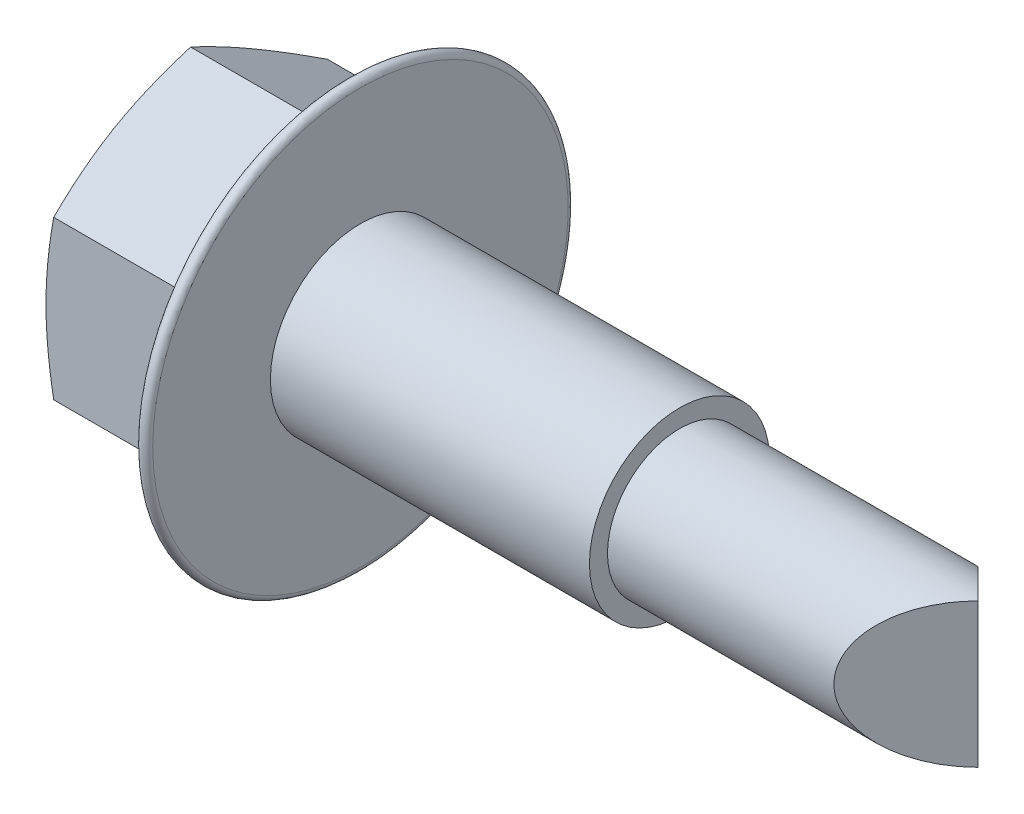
ISO-10303-21;
HEADER;
FILE_DESCRIPTION(('STEP AP214'),'2;1');
FILE_NAME('part.step','',(''),(''),'','','');
FILE_SCHEMA(('AUTOMOTIVE_DESIGN { 1 0 10303 214 1 1 1 1 }'));
ENDSEC;
DATA;
#1=APPLICATION_CONTEXT('core data for automotive mechanical design processes');
#2=APPLICATION_PROTOCOL_DEFINITION('international standard','automotive_design',2000,#1);
#3=PRODUCT_CONTEXT('',#1,'mechanical');
#4=PRODUCT('Part','Part','',(#3));
#5=PRODUCT_RELATED_PRODUCT_CATEGORY('part','',(#4));
#6=PRODUCT_DEFINITION_FORMATION('','',#4);
#7=PRODUCT_DEFINITION_CONTEXT('part definition',#1,'design');
#8=PRODUCT_DEFINITION('design','',#6,#7);
#9=PRODUCT_DEFINITION_SHAPE('','',#8);
#10=(LENGTH_UNIT() NAMED_UNIT(*) SI_UNIT(.MILLI.,.METRE.));
#11=(NAMED_UNIT(*) PLANE_ANGLE_UNIT() SI_UNIT($,.RADIAN.));
#12=(NAMED_UNIT(*) SI_UNIT($,.STERADIAN.) SOLID_ANGLE_UNIT());
#13=UNCERTAINTY_MEASURE_WITH_UNIT(LENGTH_MEASURE(1.E-05),#10,'distance_accuracy_value','');
#14=(GEOMETRIC_REPRESENTATION_CONTEXT(3) GLOBAL_UNCERTAINTY_ASSIGNED_CONTEXT((#13)) GLOBAL_UNIT_ASSIGNED_CONTEXT((#10,
#11,#12)) REPRESENTATION_CONTEXT('',''));
#15=CARTESIAN_POINT('',(0.,0.,0.));
#16=DIRECTION('',(0.,0.,1.));
#17=DIRECTION('',(1.,0.,0.));
#18=AXIS2_PLACEMENT_3D('',#15,#16,#17);
#19=CARTESIAN_POINT('',(-5.8169715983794,0.,0.));
#20=DIRECTION('',(-1.,0.,0.));
#21=DIRECTION('',(0.,0.,1.));
#22=AXIS2_PLACEMENT_3D('',#19,#20,#21);
#23=CYLINDRICAL_SURFACE('',#22,1.75);
#24=CARTESIAN_POINT('',(0.,0.,0.));
#25=DIRECTION('',(-1.,0.,0.));
#26=DIRECTION('',(0.,0.,1.));
#27=AXIS2_PLACEMENT_3D('',#24,#25,#26);
#28=CIRCLE('',#27,1.75);
#29=CARTESIAN_POINT('',(0.,0.,1.75));
#30=VERTEX_POINT('',#29);
#31=EDGE_CURVE('E162',#30,#30,#28,.T.);
#32=ORIENTED_EDGE('',*,*,#31,.F.);
#33=EDGE_LOOP('',(#32));
#34=FACE_BOUND('',#33,.T.);
#35=CARTESIAN_POINT('',(6.2,0.,0.));
#36=DIRECTION('',(-1.,0.,0.));
#37=DIRECTION('',(0.,0.,1.));
#38=AXIS2_PLACEMENT_3D('',#35,#36,#37);
#39=CIRCLE('',#38,1.75);
#40=CARTESIAN_POINT('',(6.2,0.,1.75));
#41=VERTEX_POINT('',#40);
#42=EDGE_CURVE('E495',#41,#41,#39,.T.);
#43=ORIENTED_EDGE('',*,*,#42,.T.);
#44=EDGE_LOOP('',(#43));
#45=FACE_BOUND('',#44,.T.);
#46=ADVANCED_FACE('F36',(#34,#45),#23,.T.);
#47=CARTESIAN_POINT('',(6.2,1.75,0.));
#48=DIRECTION('',(-1.,0.,0.));
#49=DIRECTION('',(0.,0.,1.));
#50=AXIS2_PLACEMENT_3D('',#47,#48,#49);
#51=PLANE('',#50);
#52=ORIENTED_EDGE('',*,*,#42,.F.);
#53=EDGE_LOOP('',(#52));
#54=FACE_BOUND('',#53,.T.);
#55=CARTESIAN_POINT('',(6.2,0.,0.));
#56=DIRECTION('',(-1.,0.,0.));
#57=DIRECTION('',(0.,0.,1.));
#58=AXIS2_PLACEMENT_3D('',#55,#56,#57);
#59=CIRCLE('',#58,1.4);
#60=CARTESIAN_POINT('',(6.2,0.,1.4));
#61=VERTEX_POINT('',#60);
#62=EDGE_CURVE('E492',#61,#61,#59,.T.);
#63=ORIENTED_EDGE('',*,*,#62,.T.);
#64=EDGE_LOOP('',(#63));
#65=FACE_BOUND('',#64,.T.);
#66=ADVANCED_FACE('F506',(#54,#65),#51,.F.);
#67=CARTESIAN_POINT('',(-5.8169715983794,0.,0.));
#68=DIRECTION('',(-1.,0.,0.));
#69=DIRECTION('',(0.,0.,1.));
#70=AXIS2_PLACEMENT_3D('',#67,#68,#69);
#71=CYLINDRICAL_SURFACE('',#70,1.4);
#72=ORIENTED_EDGE('',*,*,#62,.F.);
#73=EDGE_LOOP('',(#72));
#74=FACE_BOUND('',#73,.T.);
#75=CARTESIAN_POINT('',(12.,0.,0.));
#76=DIRECTION('',(-0.707106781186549,0.,0.707106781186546));
#77=DIRECTION('',(-0.707106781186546,0.,-0.707106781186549));
#78=AXIS2_PLACEMENT_3D('',#75,#76,#77);
#79=ELLIPSE('',#78,1.97989898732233,1.4);
#80=CARTESIAN_POINT('',(12.,1.4,0.));
#81=VERTEX_POINT('',#80);
#82=CARTESIAN_POINT('',(12.,-1.4,0.));
#83=VERTEX_POINT('',#82);
#84=EDGE_CURVE('E485',#81,#83,#79,.T.);
#85=ORIENTED_EDGE('',*,*,#84,.T.);
#86=CARTESIAN_POINT('',(12.,0.,0.));
#87=DIRECTION('',(-0.707106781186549,0.,-0.707106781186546));
#88=DIRECTION('',(-0.707106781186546,0.,0.707106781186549));
#89=AXIS2_PLACEMENT_3D('',#86,#87,#88);
#90=ELLIPSE('',#89,1.97989898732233,1.4);
#91=EDGE_CURVE('E489',#83,#81,#90,.T.);
#92=ORIENTED_EDGE('',*,*,#91,.T.);
#93=EDGE_LOOP('',(#85,#92));
#94=FACE_BOUND('',#93,.T.);
#95=ADVANCED_FACE('F511',(#74,#94),#71,.T.);
#96=CARTESIAN_POINT('',(2.00000000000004,-1.75,10.));
#97=DIRECTION('',(-0.707106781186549,0.,-0.707106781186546));
#98=DIRECTION('',(-0.707106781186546,0.,0.707106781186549));
#99=AXIS2_PLACEMENT_3D('',#96,#97,#98);
#100=PLANE('',#99);
#101=DIRECTION('',(0.,1.,0.));
#102=VECTOR('',#101,1.);
#103=CARTESIAN_POINT('',(12.,-1.75,0.));
#104=LINE('',#103,#102);
#105=EDGE_CURVE('E482',#83,#81,#104,.T.);
#106=ORIENTED_EDGE('',*,*,#105,.T.);
#107=ORIENTED_EDGE('',*,*,#91,.F.);
#108=EDGE_LOOP('',(#106,#107));
#109=FACE_BOUND('',#108,.T.);
#110=ADVANCED_FACE('F517',(#109),#100,.F.);
#111=CARTESIAN_POINT('',(2.00000000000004,-1.75,-10.));
#112=DIRECTION('',(-0.707106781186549,0.,0.707106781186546));
#113=DIRECTION('',(0.707106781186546,0.,0.707106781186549));
#114=AXIS2_PLACEMENT_3D('',#111,#112,#113);
#115=PLANE('',#114);
#116=ORIENTED_EDGE('',*,*,#105,.F.);
#117=ORIENTED_EDGE('',*,*,#84,.F.);
#118=EDGE_LOOP('',(#116,#117));
#119=FACE_BOUND('',#118,.T.);
#120=ADVANCED_FACE('F521',(#119),#115,.F.);
#121=CARTESIAN_POINT('',(0.,-1.53575171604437,2.66000000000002));
#122=DIRECTION('',(-1.,0.,0.));
#123=DIRECTION('',(0.,0.,1.));
#124=AXIS2_PLACEMENT_3D('',#121,#122,#123);
#125=PLANE('',#124);
#126=ORIENTED_EDGE('',*,*,#31,.T.);
#127=EDGE_LOOP('',(#126));
#128=FACE_BOUND('',#127,.T.);
#129=CARTESIAN_POINT('',(0.,0.,0.));
#130=DIRECTION('',(-1.,0.,0.));
#131=DIRECTION('',(0.,0.,1.));
#132=AXIS2_PLACEMENT_3D('',#129,#130,#131);
#133=CIRCLE('',#132,4.03640715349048);
#134=CARTESIAN_POINT('',(0.,0.,4.03640715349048));
#135=VERTEX_POINT('',#134);
#136=EDGE_CURVE('E545',#135,#135,#133,.T.);
#137=ORIENTED_EDGE('',*,*,#136,.F.);
#138=EDGE_LOOP('',(#137));
#139=FACE_BOUND('',#138,.T.);
#140=ADVANCED_FACE('F501',(#128,#139),#125,.F.);
#141=CARTESIAN_POINT('',(-0.113592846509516,0.,0.));
#142=DIRECTION('',(-1.,0.,0.));
#143=DIRECTION('',(0.,0.,1.));
#144=AXIS2_PLACEMENT_3D('',#141,#142,#143);
#145=TOROIDAL_SURFACE('',#144,4.03640715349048,0.113592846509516);
#146=CARTESIAN_POINT('',(-0.223315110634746,0.,0.));
#147=DIRECTION('',(-1.,0.,0.));
#148=DIRECTION('',(0.,0.,1.));
#149=AXIS2_PLACEMENT_3D('',#146,#147,#148);
#150=CIRCLE('',#149,4.06580714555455);
#151=CARTESIAN_POINT('',(-0.223315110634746,0.,4.06580714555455));
#152=VERTEX_POINT('',#151);
#153=EDGE_CURVE('E542',#152,#152,#150,.T.);
#154=ORIENTED_EDGE('',*,*,#153,.F.);
#155=EDGE_LOOP('',(#154));
#156=FACE_BOUND('',#155,.T.);
#157=ORIENTED_EDGE('',*,*,#136,.T.);
#158=EDGE_LOOP('',(#157));
#159=FACE_BOUND('',#158,.T.);
#160=ADVANCED_FACE('F200',(#156,#159),#145,.T.);
#161=CARTESIAN_POINT('',(-0.223315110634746,0.,0.));
#162=DIRECTION('',(1.,0.,0.));
#163=DIRECTION('',(0.,0.,-1.));
#164=AXIS2_PLACEMENT_3D('',#161,#162,#163);
#165=CONICAL_SURFACE('',#164,4.06580714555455,1.30899693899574);
#166=CARTESIAN_POINT('',(2.36790272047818,4.80858921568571,-13.6487208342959));
#167=CARTESIAN_POINT('',(2.55171042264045,4.78444681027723,-13.6069049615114));
#168=CARTESIAN_POINT('',(2.56108788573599,4.61884657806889,-13.6996698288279));
#169=CARTESIAN_POINT('',(2.21182277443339,4.5114240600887,-13.1340156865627));
#170=CARTESIAN_POINT('',(2.39537744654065,4.48757119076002,-13.0927013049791));
#171=CARTESIAN_POINT('',(2.40500793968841,4.32208342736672,-13.1848315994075));
#172=CARTESIAN_POINT('',(2.05601855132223,4.21422211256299,-12.6192468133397));
#173=CARTESIAN_POINT('',(2.239250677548,4.19060994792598,-12.5783493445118));
#174=CARTESIAN_POINT('',(2.2492037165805,4.02532180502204,-12.6699175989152));
#175=CARTESIAN_POINT('',(1.7453800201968,3.61949597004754,-11.5891509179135));
#176=CARTESIAN_POINT('',(1.9277285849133,3.59616286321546,-11.5487367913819));
#177=CARTESIAN_POINT('',(1.93856518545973,3.43162519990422,-11.6395044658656));
#178=CARTESIAN_POINT('',(1.59054636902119,3.32197168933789,-11.073823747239));
#179=CARTESIAN_POINT('',(1.77243442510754,3.29887363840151,-11.0338167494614));
#180=CARTESIAN_POINT('',(1.78373153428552,3.13469022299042,-11.1240051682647));
#181=CARTESIAN_POINT('',(1.27864018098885,2.71933591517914,-10.0300279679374));
#182=CARTESIAN_POINT('',(1.45933493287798,2.69658614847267,-9.99062421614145));
#183=CARTESIAN_POINT('',(1.47182534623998,2.53347122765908,-10.079830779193));
#184=CARTESIAN_POINT('',(1.12160737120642,2.41421927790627,-9.50155044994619));
#185=CARTESIAN_POINT('',(1.30170098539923,2.39185529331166,-9.46281489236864));
#186=CARTESIAN_POINT('',(1.31479253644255,2.22918761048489,-9.55114603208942));
#187=CARTESIAN_POINT('',(0.810399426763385,1.80381975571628,-8.44430746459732));
#188=CARTESIAN_POINT('',(0.988848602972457,1.78198901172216,-8.40649550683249));
#189=CARTESIAN_POINT('',(1.0035845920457,1.62083868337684,-8.49346319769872));
#190=CARTESIAN_POINT('',(0.656222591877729,1.4985370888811,-7.91554237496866));
#191=CARTESIAN_POINT('',(0.833863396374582,1.47733486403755,-7.87881904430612));
#192=CARTESIAN_POINT('',(0.849407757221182,1.31677335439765,-7.96446550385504));
#193=CARTESIAN_POINT('',(0.432776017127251,1.0480179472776,-7.13522033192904));
#194=CARTESIAN_POINT('',(0.608277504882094,1.02662196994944,-7.09816141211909));
#195=CARTESIAN_POINT('',(0.625961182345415,0.868571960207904,-7.1838290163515));
#196=CARTESIAN_POINT('',(0.361488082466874,0.903032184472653,-6.88409762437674));
#197=CARTESIAN_POINT('',(0.536407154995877,0.881913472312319,-6.84751894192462));
#198=CARTESIAN_POINT('',(0.554673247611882,0.724411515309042,-6.93260950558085));
#199=CARTESIAN_POINT('',(0.220588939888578,0.612855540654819,-6.38149693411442));
#200=CARTESIAN_POINT('',(0.394171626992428,0.592260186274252,-6.34582473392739));
#201=CARTESIAN_POINT('',(0.413774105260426,0.436108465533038,-6.42984568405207));
#202=CARTESIAN_POINT('',(0.150977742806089,0.46766465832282,-6.13001894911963));
#203=CARTESIAN_POINT('',(0.323855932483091,0.447428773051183,-6.09496936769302));
#204=CARTESIAN_POINT('',(0.344162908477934,0.291965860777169,-6.17830137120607));
#205=CARTESIAN_POINT('',(0.0140436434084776,0.176714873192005,-5.6260791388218));
#206=CARTESIAN_POINT('',(0.185303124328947,0.157181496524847,-5.5922463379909));
#207=CARTESIAN_POINT('',(0.20722880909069,0.00342419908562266,-5.67430123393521));
#208=CARTESIAN_POINT('',(-0.0532745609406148,0.0309554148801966,-5.37361635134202));
#209=CARTESIAN_POINT('',(0.117128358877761,0.0119098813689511,-5.34062851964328));
#210=CARTESIAN_POINT('',(0.139910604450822,-0.140974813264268,-5.42184458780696));
#211=CARTESIAN_POINT('',(-0.184249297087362,-0.260976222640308,-4.86797592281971));
#212=CARTESIAN_POINT('',(-0.0158110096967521,-0.279047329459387,-4.83667584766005));
#213=CARTESIAN_POINT('',(0.00893586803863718,-0.429749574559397,-4.91637746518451));
#214=CARTESIAN_POINT('',(-0.247905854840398,-0.407148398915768,-4.61479828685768));
#215=CARTESIAN_POINT('',(-0.0805125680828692,-0.424549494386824,-4.58465870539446));
#216=CARTESIAN_POINT('',(-0.054720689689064,-0.5741253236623,-4.66336699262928));
#217=CARTESIAN_POINT('',(-0.368631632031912,-0.698059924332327,-4.11092474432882));
#218=CARTESIAN_POINT('',(-0.203577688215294,-0.714095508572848,-4.08315029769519));
#219=CARTESIAN_POINT('',(-0.175446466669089,-0.860874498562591,-4.16017097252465));
#220=CARTESIAN_POINT('',(-0.425780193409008,-0.842790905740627,-3.86024333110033));
#221=CARTESIAN_POINT('',(-0.261964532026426,-0.85791716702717,-3.83404387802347));
#222=CARTESIAN_POINT('',(-0.232595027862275,-1.00324782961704,-3.90999511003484));
#223=CARTESIAN_POINT('',(-0.531139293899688,-1.13311471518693,-3.35738774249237));
#224=CARTESIAN_POINT('',(-0.369964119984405,-1.14626093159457,-3.33461782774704));
#225=CARTESIAN_POINT('',(-0.337954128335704,-1.28813600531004,-3.40883726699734));
#226=CARTESIAN_POINT('',(-0.579347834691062,-1.2787077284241,-3.10521324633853));
#227=CARTESIAN_POINT('',(-0.41958804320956,-1.29062432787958,-3.0845730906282));
#228=CARTESIAN_POINT('',(-0.386162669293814,-1.43065087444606,-3.157855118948));
#229=CARTESIAN_POINT('',(-0.661165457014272,-1.570479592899,-2.5998495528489));
#230=CARTESIAN_POINT('',(-0.504009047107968,-1.57958618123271,-2.5840764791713));
#231=CARTESIAN_POINT('',(-0.467980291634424,-1.71567366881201,-2.65615742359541));
#232=CARTESIAN_POINT('',(-0.694824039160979,-1.71665472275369,-2.34666680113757));
#233=CARTESIAN_POINT('',(-0.538999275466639,-1.72425843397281,-2.33349678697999));
#234=CARTESIAN_POINT('',(-0.501638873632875,-1.85817994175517,-2.40544391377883));
#235=CARTESIAN_POINT('',(-0.729505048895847,-1.93649839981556,-1.96588638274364));
#236=CARTESIAN_POINT('',(-0.575051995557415,-1.94154745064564,-1.95714117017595));
#237=CARTESIAN_POINT('',(-0.5363198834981,-2.07270597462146,-2.02960264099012));
#238=CARTESIAN_POINT('',(-0.738430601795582,-2.00985457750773,-1.83882975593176));
#239=CARTESIAN_POINT('',(-0.584349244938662,-2.01396119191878,-1.83171689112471));
#240=CARTESIAN_POINT('',(-0.545245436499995,-2.14432103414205,-1.90439754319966));
#241=CARTESIAN_POINT('',(-0.750409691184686,-2.15668351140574,-1.58451458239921));
#242=CARTESIAN_POINT('',(-0.596812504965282,-2.15874073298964,-1.58095137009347));
#243=CARTESIAN_POINT('',(-0.557224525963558,-2.28789916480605,-1.65413206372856));
#244=CARTESIAN_POINT('',(-0.753463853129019,-2.23015625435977,-1.45725605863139));
#245=CARTESIAN_POINT('',(-0.599998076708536,-2.23121434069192,-1.4554233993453));
#246=CARTESIAN_POINT('',(-0.560278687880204,-2.3598621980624,-1.52907166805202));
#247=CARTESIAN_POINT('',(-0.753466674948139,-2.36439208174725,-1.22475278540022));
#248=CARTESIAN_POINT('',(-0.600001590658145,-2.36351693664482,-1.22626858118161));
#249=CARTESIAN_POINT('',(-0.560281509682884,-2.49166871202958,-1.3007751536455));
#250=CARTESIAN_POINT('',(-0.751379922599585,-2.42515561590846,-1.11950725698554));
#251=CARTESIAN_POINT('',(-0.597825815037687,-2.42343980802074,-1.12247912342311));
#252=CARTESIAN_POINT('',(-0.558194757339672,-2.55145574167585,-1.1975052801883));
#253=CARTESIAN_POINT('',(-0.743150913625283,-2.54663816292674,-0.909093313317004));
#254=CARTESIAN_POINT('',(-0.589262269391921,-2.54321128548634,-0.915028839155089));
#255=CARTESIAN_POINT('',(-0.54996574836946,-2.6712652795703,-0.991083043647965));
#256=CARTESIAN_POINT('',(-0.737006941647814,-2.60735714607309,-0.803924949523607));
#257=CARTESIAN_POINT('',(-0.582863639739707,-2.60312249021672,-0.811259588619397));
#258=CARTESIAN_POINT('',(-0.543821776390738,-2.73128787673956,-0.887930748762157));
#259=CARTESIAN_POINT('',(-0.712886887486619,-2.7895607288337,-0.488339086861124));
#260=CARTESIAN_POINT('',(-0.557775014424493,-2.78306527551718,-0.499589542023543));
#261=CARTESIAN_POINT('',(-0.519701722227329,-2.91181779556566,-0.578301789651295));
#262=CARTESIAN_POINT('',(-0.689224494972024,-2.91085967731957,-0.278243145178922));
#263=CARTESIAN_POINT('',(-0.533150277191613,-2.90301170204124,-0.291836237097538));
#264=CARTESIAN_POINT('',(-0.496039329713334,-3.0325592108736,-0.372047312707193));
#265=CARTESIAN_POINT('',(-0.630196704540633,-3.1537374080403,0.142433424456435));
#266=CARTESIAN_POINT('',(-0.47210732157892,-3.14325991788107,0.12428587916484));
#267=CARTESIAN_POINT('',(-0.437011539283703,-3.27506211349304,0.041652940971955));
#268=CARTESIAN_POINT('',(-0.594734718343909,-3.27530998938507,0.353003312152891));
#269=CARTESIAN_POINT('',(-0.435480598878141,-3.26369081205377,0.332878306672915));
#270=CARTESIAN_POINT('',(-0.401549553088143,-3.39682365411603,0.249094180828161));
#271=CARTESIAN_POINT('',(-0.535595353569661,-3.45701746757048,0.667729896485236));
#272=CARTESIAN_POINT('',(-0.374765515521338,-3.44358842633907,0.6444701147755));
#273=CARTESIAN_POINT('',(-0.342410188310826,-3.5790670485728,0.559700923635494));
#274=CARTESIAN_POINT('',(-0.514920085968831,-3.51740456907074,0.772323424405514));
#275=CARTESIAN_POINT('',(-0.353532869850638,-3.50350691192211,0.748251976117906));
#276=CARTESIAN_POINT('',(-0.321734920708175,-3.63967444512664,0.663017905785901));
#277=CARTESIAN_POINT('',(-0.471918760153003,-3.6380199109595,0.981235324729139));
#278=CARTESIAN_POINT('',(-0.309432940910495,-3.62326250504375,0.955674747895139));
#279=CARTESIAN_POINT('',(-0.278733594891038,-3.76078360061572,0.86954671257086));
#280=CARTESIAN_POINT('',(-0.449593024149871,-3.69824817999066,1.08555374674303));
#281=CARTESIAN_POINT('',(-0.286563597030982,-3.68309070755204,1.05930023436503));
#282=CARTESIAN_POINT('',(-0.256407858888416,-3.82128537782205,0.972758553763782));
#283=CARTESIAN_POINT('',(-0.426606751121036,-3.75841287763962,1.18976205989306));
#284=CARTESIAN_POINT('',(-0.263089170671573,-3.74278963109,1.16270180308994));
#285=CARTESIAN_POINT('',(-0.233421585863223,-3.88173490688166,1.07593552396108));
#286=(BOUNDED_SURFACE() B_SPLINE_SURFACE(3,2,((#166,#167,#168),(#169,#170,#171),(#172,#173,
#174),(#175,#176,#177),(#178,#179,#180),(#181,#182,#183),(#184,#185,#186),(#187,#188,#189),
(#190,#191,#192),(#193,#194,#195),(#196,#197,#198),(#199,#200,#201),(#202,#203,#204),(#205,#206,
#207),(#208,#209,#210),(#211,#212,#213),(#214,#215,#216),(#217,#218,#219),(#220,#221,#222),
(#223,#224,#225),(#226,#227,#228),(#229,#230,#231),(#232,#233,#234),(#235,#236,#237),(#238,#239,
#240),(#241,#242,#243),(#244,#245,#246),(#247,#248,#249),(#250,#251,#252),(#253,#254,#255),
(#256,#257,#258),(#259,#260,#261),(#262,#263,#264),(#265,#266,#267),(#268,#269,#270),(#271,#272,
#273),(#274,#275,#276),(#277,#278,#279),(#280,#281,#282),(#283,#284,#285)),.UNSPECIFIED.,.F.,
.F.,.F.) B_SPLINE_SURFACE_WITH_KNOTS((4,2,2,2,2,2,2,2,2,2,2,2,2,2,2,2,2,2,2,4),(3,3),(0.,
1.8434510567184,3.68803807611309,5.57837849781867,7.46755483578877,8.36336902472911,
9.25918900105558,10.1567457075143,11.0542960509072,11.9393560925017,12.8246137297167,
13.706835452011,14.1476844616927,14.5884865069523,14.9530521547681,15.3177720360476,
16.048602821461,16.785569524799,17.15315442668,17.5206677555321),(0.,1.),
.UNSPECIFIED.) GEOMETRIC_REPRESENTATION_ITEM() RATIONAL_B_SPLINE_SURFACE(((1.,0.724919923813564,
1.),(1.,0.725634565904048,1.),(1.,0.726416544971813,1.),(1.,0.728221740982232,1.),(1.,
0.729245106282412,1.),(1.,0.731668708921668,1.),(1.,0.733077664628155,1.),(1.,0.736473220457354,
1.),(1.,0.738459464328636,1.),(1.,0.742110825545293,1.),(1.,0.74339563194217,1.),(1.,
0.74625565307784,1.),(1.,0.747830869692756,1.),(1.,0.751358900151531,1.),(1.,0.75331244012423,
1.),(1.,0.757692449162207,1.),(1.,0.760118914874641,1.),(1.,0.765470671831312,1.),(1.,
0.768388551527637,1.),(1.,0.774639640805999,1.),(1.,0.777972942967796,1.),(1.,0.784391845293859,
1.),(1.,0.787478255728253,1.),(1.,0.790859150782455,1.),(1.,0.791777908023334,1.),(1.,
0.793024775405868,1.),(1.,0.793352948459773,1.),(1.,0.79335366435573,1.),(1.,0.793129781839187,
1.),(1.,0.792267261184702,1.),(1.,0.791628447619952,1.),(1.,0.789211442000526,1.),(1.,
0.786933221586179,1.),(1.,0.781891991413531,1.),(1.,0.779125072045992,1.),(1.,0.775061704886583,
1.),(1.,0.773723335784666,1.),(1.,0.771102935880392,1.),(1.,0.769820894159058,1.),(1.,
0.768581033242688,1.))) REPRESENTATION_ITEM('') SURFACE());
#287=CARTESIAN_POINT('',(-0.233421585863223,-3.88173490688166,1.07593552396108));
#288=CARTESIAN_POINT('',(-0.256407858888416,-3.82128537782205,0.972758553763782));
#289=CARTESIAN_POINT('',(-0.278733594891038,-3.76078360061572,0.86954671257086));
#290=CARTESIAN_POINT('',(-0.321734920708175,-3.63967444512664,0.663017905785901));
#291=CARTESIAN_POINT('',(-0.342410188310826,-3.5790670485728,0.559700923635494));
#292=CARTESIAN_POINT('',(-0.401549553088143,-3.39682365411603,0.249094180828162));
#293=CARTESIAN_POINT('',(-0.437011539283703,-3.27506211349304,0.0416529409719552));
#294=CARTESIAN_POINT('',(-0.496039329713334,-3.0325592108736,-0.372047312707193));
#295=CARTESIAN_POINT('',(-0.519701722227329,-2.91181779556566,-0.578301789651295));
#296=CARTESIAN_POINT('',(-0.543821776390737,-2.73128787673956,-0.887930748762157));
#297=CARTESIAN_POINT('',(-0.54996574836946,-2.6712652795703,-0.991083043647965));
#298=CARTESIAN_POINT('',(-0.558194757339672,-2.55145574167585,-1.1975052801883));
#299=CARTESIAN_POINT('',(-0.560281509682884,-2.49166871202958,-1.3007751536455));
#300=CARTESIAN_POINT('',(-0.560278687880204,-2.3598621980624,-1.52907166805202));
#301=CARTESIAN_POINT('',(-0.557224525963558,-2.28789916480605,-1.65413206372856));
#302=CARTESIAN_POINT('',(-0.545245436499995,-2.14432103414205,-1.90439754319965));
#303=CARTESIAN_POINT('',(-0.5363198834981,-2.07270597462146,-2.02960264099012));
#304=CARTESIAN_POINT('',(-0.501638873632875,-1.85817994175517,-2.40544391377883));
#305=CARTESIAN_POINT('',(-0.467980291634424,-1.71567366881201,-2.65615742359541));
#306=CARTESIAN_POINT('',(-0.386162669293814,-1.43065087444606,-3.157855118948));
#307=CARTESIAN_POINT('',(-0.337954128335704,-1.28813600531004,-3.40883726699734));
#308=CARTESIAN_POINT('',(-0.232595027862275,-1.00324782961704,-3.90999511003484));
#309=CARTESIAN_POINT('',(-0.175446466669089,-0.860874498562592,-4.16017097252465));
#310=CARTESIAN_POINT('',(-0.054720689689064,-0.5741253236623,-4.66336699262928));
#311=CARTESIAN_POINT('',(0.00893586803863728,-0.429749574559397,-4.91637746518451));
#312=CARTESIAN_POINT('',(0.139910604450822,-0.140974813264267,-5.42184458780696));
#313=CARTESIAN_POINT('',(0.20722880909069,0.00342419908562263,-5.67430123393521));
#314=CARTESIAN_POINT('',(0.344162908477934,0.291965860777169,-6.17830137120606));
#315=CARTESIAN_POINT('',(0.413774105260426,0.436108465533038,-6.42984568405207));
#316=CARTESIAN_POINT('',(0.554673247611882,0.724411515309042,-6.93260950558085));
#317=CARTESIAN_POINT('',(0.625961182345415,0.868571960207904,-7.1838290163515));
#318=CARTESIAN_POINT('',(0.849407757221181,1.31677335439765,-7.96446550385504));
#319=CARTESIAN_POINT('',(1.0035845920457,1.62083868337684,-8.49346319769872));
#320=CARTESIAN_POINT('',(1.31479253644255,2.22918761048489,-9.55114603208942));
#321=CARTESIAN_POINT('',(1.47182534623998,2.53347122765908,-10.079830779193));
#322=CARTESIAN_POINT('',(1.78373153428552,3.13469022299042,-11.1240051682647));
#323=CARTESIAN_POINT('',(1.93856518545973,3.43162519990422,-11.6395044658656));
#324=CARTESIAN_POINT('',(2.2492037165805,4.02532180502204,-12.6699175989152));
#325=CARTESIAN_POINT('',(2.40500793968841,4.32208342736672,-13.1848315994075));
#326=CARTESIAN_POINT('',(2.56108788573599,4.61884657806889,-13.6996698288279));
#327=B_SPLINE_CURVE_WITH_KNOTS('',3,(#287,#288,#289,#290,#291,#292,#293,#294,#295,#296,#297,
#298,#299,#300,#301,#302,#303,#304,#305,#306,#307,#308,#309,#310,#311,#312,#313,#314,#315,#316,
#317,#318,#319,#320,#321,#322,#323,#324,#325,#326),.UNSPECIFIED.,.F.,.F.,(4,2,2,2,2,2,2,2,2,2,2,
2,2,2,2,2,2,2,2,4),(0.,0.367513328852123,0.735098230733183,1.47206493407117,2.20289571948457,
2.56761560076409,2.93218124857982,3.37298329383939,3.81383230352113,4.69605402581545,
5.58131166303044,6.46637170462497,7.36392204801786,8.26147875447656,9.15729873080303,
10.0531129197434,11.9422892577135,13.832629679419,15.6772166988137,17.5206677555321),.UNSPECIFIED.);
#328=CARTESIAN_POINT('',(-0.441727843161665,-3.25067973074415,0.));
#329=VERTEX_POINT('',#328);
#330=CARTESIAN_POINT('',(-0.441727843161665,-1.62533986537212,-2.81517122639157));
#331=VERTEX_POINT('',#330);
#332=EDGE_CURVE('E354',#329,#331,#327,.T.);
#333=ORIENTED_EDGE('',*,*,#332,.T.);
#334=CARTESIAN_POINT('',(2.36860254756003,14.2270976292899,-2.66000000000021));
#335=CARTESIAN_POINT('',(2.55241185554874,14.1788120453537,-2.66000000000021));
#336=CARTESIAN_POINT('',(2.56178771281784,14.1763490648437,-2.8497982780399));
#337=CARTESIAN_POINT('',(2.21252202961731,13.6327696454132,-2.6600000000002));
#338=CARTESIAN_POINT('',(2.39607841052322,13.5850629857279,-2.6600000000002));
#339=CARTESIAN_POINT('',(2.40570719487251,13.5821067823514,-2.84938374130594));
#340=CARTESIAN_POINT('',(2.05671712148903,13.0383681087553,-2.6600000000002));
#341=CARTESIAN_POINT('',(2.2399510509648,12.9911425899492,-2.6600000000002));
#342=CARTESIAN_POINT('',(2.24990228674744,12.9877996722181,-2.84893001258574));
#343=CARTESIAN_POINT('',(1.74607661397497,11.8489209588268,-2.66000000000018));
#344=CARTESIAN_POINT('',(1.92842730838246,11.8022532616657,-2.66000000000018));
#345=CARTESIAN_POINT('',(1.93926177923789,11.7985924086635,-2.84788020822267));
#346=CARTESIAN_POINT('',(1.59124167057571,11.2538751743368,-2.66000000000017));
#347=CARTESIAN_POINT('',(1.77313203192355,11.2076773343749,-2.66000000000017));
#348=CARTESIAN_POINT('',(1.78442683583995,11.2036921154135,-2.84728404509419));
#349=CARTESIAN_POINT('',(1.27933791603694,10.0486334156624,-2.66000000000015));
#350=CARTESIAN_POINT('',(1.4600354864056,10.003131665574,-2.66000000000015));
#351=CARTESIAN_POINT('',(1.47252308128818,9.99883058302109,-2.84586844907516));
#352=CARTESIAN_POINT('',(1.12230873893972,9.43842717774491,-2.66000000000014));
#353=CARTESIAN_POINT('',(1.30240544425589,9.39369644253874,-2.66000000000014));
#354=CARTESIAN_POINT('',(1.31549390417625,9.38886120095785,-2.84504385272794));
#355=CARTESIAN_POINT('',(0.811105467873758,8.21768255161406,-2.66000000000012));
#356=CARTESIAN_POINT('',(0.989558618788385,8.17401751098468,-2.66000000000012));
#357=CARTESIAN_POINT('',(1.00429063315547,8.16876037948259,-2.84304921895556));
#358=CARTESIAN_POINT('',(0.656929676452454,7.60714459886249,-2.66000000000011));
#359=CARTESIAN_POINT('',(0.834574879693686,7.5647355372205,-2.66000000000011));
#360=CARTESIAN_POINT('',(0.850114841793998,7.55862927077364,-2.84187939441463));
#361=CARTESIAN_POINT('',(0.433476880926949,6.70613383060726,-2.6600000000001));
#362=CARTESIAN_POINT('',(0.608984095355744,6.66333738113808,-2.6600000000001));
#363=CARTESIAN_POINT('',(0.626662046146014,6.65850410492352,-2.83971639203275));
#364=CARTESIAN_POINT('',(0.362184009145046,6.41616188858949,-2.6600000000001));
#365=CARTESIAN_POINT('',(0.537109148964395,6.37391948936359,-2.6600000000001));
#366=CARTESIAN_POINT('',(0.555369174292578,6.36886063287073,-2.8389537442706));
#367=CARTESIAN_POINT('',(0.221273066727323,5.83580817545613,-2.66000000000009));
#368=CARTESIAN_POINT('',(0.394862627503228,5.79461152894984,-2.66000000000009));
#369=CARTESIAN_POINT('',(0.414458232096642,5.78930153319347,-2.83725075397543));
#370=CARTESIAN_POINT('',(0.151655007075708,5.54542640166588,-2.66000000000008));
#371=CARTESIAN_POINT('',(0.324540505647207,5.50494802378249,-2.66000000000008));
#372=CARTESIAN_POINT('',(0.344840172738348,5.49938590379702,-2.83631041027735));
#373=CARTESIAN_POINT('',(0.0147042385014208,4.96352796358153,-2.66000000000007));
#374=CARTESIAN_POINT('',(0.185972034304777,4.92445317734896,-2.66000000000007));
#375=CARTESIAN_POINT('',(0.207889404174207,4.91863783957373,-2.83419625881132));
#376=CARTESIAN_POINT('',(-0.0526237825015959,4.67201019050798,-2.66000000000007));
#377=CARTESIAN_POINT('',(0.117787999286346,4.63391010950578,-2.66000000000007));
#378=CARTESIAN_POINT('',(0.140561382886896,4.62780471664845,-2.83302200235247));
#379=CARTESIAN_POINT('',(-0.183623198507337,4.08815032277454,-2.66000000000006));
#380=CARTESIAN_POINT('',(-0.0151748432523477,4.05199694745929,-2.66000000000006));
#381=CARTESIAN_POINT('',(0.00956196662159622,4.04567100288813,-2.83037663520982));
#382=CARTESIAN_POINT('',(-0.247294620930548,3.79580823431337,-2.66000000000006));
#383=CARTESIAN_POINT('',(-0.0798906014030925,3.76099348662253,-2.66000000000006));
#384=CARTESIAN_POINT('',(-0.0541094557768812,3.75437041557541,-2.82890552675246));
#385=CARTESIAN_POINT('',(-0.368059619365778,3.21398590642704,-2.66000000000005));
#386=CARTESIAN_POINT('',(-0.202993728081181,3.18189896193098,-2.66000000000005));
#387=CARTESIAN_POINT('',(-0.174874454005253,3.17521210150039,-2.82564171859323));
#388=CARTESIAN_POINT('',(-0.425232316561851,2.92452236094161,-2.66000000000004));
#389=CARTESIAN_POINT('',(-0.261404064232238,2.89425219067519,-2.66000000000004));
#390=CARTESIAN_POINT('',(-0.232047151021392,2.88736279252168,-2.82385377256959));
#391=CARTESIAN_POINT('',(-0.530653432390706,2.34387299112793,-2.66000000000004));
#392=CARTESIAN_POINT('',(-0.369464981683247,2.31755829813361,-2.66000000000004));
#393=CARTESIAN_POINT('',(-0.33746826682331,2.3108952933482,-2.81999682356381));
#394=CARTESIAN_POINT('',(-0.578899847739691,2.05268679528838,-2.66000000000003));
#395=CARTESIAN_POINT('',(-0.419126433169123,2.02882930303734,-2.66000000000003));
#396=CARTESIAN_POINT('',(-0.385714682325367,2.02227694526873,-2.81792775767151));
#397=CARTESIAN_POINT('',(-0.660814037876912,1.46914254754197,-2.66000000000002));
#398=CARTESIAN_POINT('',(-0.5036453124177,1.45089886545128,-2.66000000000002));
#399=CARTESIAN_POINT('',(-0.467628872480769,1.44527335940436,-2.81391466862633));
#400=CARTESIAN_POINT('',(-0.694531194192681,1.17679192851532,-2.66000000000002));
#401=CARTESIAN_POINT('',(-0.538695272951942,1.16155242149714,-2.66000000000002));
#402=CARTESIAN_POINT('',(-0.501346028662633,1.15689071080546,-2.81197024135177));
#403=CARTESIAN_POINT('',(-0.729314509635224,0.737101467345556,-2.66000000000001));
#404=CARTESIAN_POINT('',(-0.574853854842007,0.72696589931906,-2.66000000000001));
#405=CARTESIAN_POINT('',(-0.536129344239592,0.724130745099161,-2.80982950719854));
#406=CARTESIAN_POINT('',(-0.738276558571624,0.590387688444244,-2.66000000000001));
#407=CARTESIAN_POINT('',(-0.584188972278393,0.582136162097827,-2.66000000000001));
#408=CARTESIAN_POINT('',(-0.545091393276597,0.57988934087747,-2.80924530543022));
#409=CARTESIAN_POINT('',(-0.75033124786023,0.296725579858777,-2.66));
#410=CARTESIAN_POINT('',(-0.596730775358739,0.292571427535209,-2.66000000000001));
#411=CARTESIAN_POINT('',(-0.557146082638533,0.291357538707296,-2.80845012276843));
#412=CARTESIAN_POINT('',(-0.753424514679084,0.14977727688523,-2.66));
#413=CARTESIAN_POINT('',(-0.599957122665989,0.147621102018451,-2.66));
#414=CARTESIAN_POINT('',(-0.560239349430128,0.147067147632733,-2.8082391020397));
#415=CARTESIAN_POINT('',(-0.753498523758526,-0.118700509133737,-2.66));
#416=CARTESIAN_POINT('',(-0.600034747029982,-0.116990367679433,-2.66));
#417=CARTESIAN_POINT('',(-0.560313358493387,-0.11655272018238,-2.8082338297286));
#418=CARTESIAN_POINT('',(-0.751443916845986,-0.24023062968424,-2.66));
#419=CARTESIAN_POINT('',(-0.597892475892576,-0.236838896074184,-2.66));
#420=CARTESIAN_POINT('',(-0.558258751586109,-0.235883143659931,-2.80837380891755));
#421=CARTESIAN_POINT('',(-0.743277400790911,-0.483202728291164,-2.65999999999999));
#422=CARTESIAN_POINT('',(-0.589393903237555,-0.476387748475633,-2.65999999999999));
#423=CARTESIAN_POINT('',(-0.550092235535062,-0.47456010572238,-2.80891677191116));
#424=CARTESIAN_POINT('',(-0.737163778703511,-0.604644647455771,-2.65999999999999));
#425=CARTESIAN_POINT('',(-0.58302680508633,-0.596213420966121,-2.65999999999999));
#426=CARTESIAN_POINT('',(-0.543978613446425,-0.593906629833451,-2.80931986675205));
#427=CARTESIAN_POINT('',(-0.713130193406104,-0.969063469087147,-2.65999999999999));
#428=CARTESIAN_POINT('',(-0.558027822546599,-0.956106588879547,-2.65999999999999));
#429=CARTESIAN_POINT('',(-0.519945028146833,-0.952325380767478,-2.8108441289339));
#430=CARTESIAN_POINT('',(-0.689519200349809,-1.21167017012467,-2.65999999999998));
#431=CARTESIAN_POINT('',(-0.533455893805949,-1.19600670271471,-2.65999999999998));
#432=CARTESIAN_POINT('',(-0.496334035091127,-1.1913226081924,-2.81227993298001));
#433=CARTESIAN_POINT('',(-0.630579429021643,-1.69744093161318,-2.65999999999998));
#434=CARTESIAN_POINT('',(-0.472502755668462,-1.67651310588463,-2.65999999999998));
#435=CARTESIAN_POINT('',(-0.437394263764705,-1.67085674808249,-2.81544121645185));
#436=CARTESIAN_POINT('',(-0.595154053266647,-1.94059260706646,-2.65999999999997));
#437=CARTESIAN_POINT('',(-0.435912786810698,-1.91737951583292,-2.65999999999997));
#438=CARTESIAN_POINT('',(-0.401968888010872,-1.91138976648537,-2.81716902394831));
#439=CARTESIAN_POINT('',(-0.536060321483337,-2.30401772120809,-2.65999999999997));
#440=CARTESIAN_POINT('',(-0.375243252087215,-2.27718143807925,-2.65999999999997));
#441=CARTESIAN_POINT('',(-0.342875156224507,-2.2715102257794,-2.81969347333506));
#442=CARTESIAN_POINT('',(-0.515398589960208,-2.42479596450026,-2.65999999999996));
#443=CARTESIAN_POINT('',(-0.354024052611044,-2.3970213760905,-2.65999999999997));
#444=CARTESIAN_POINT('',(-0.322213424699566,-2.39129164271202,-2.8205227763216));
#445=CARTESIAN_POINT('',(-0.472421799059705,-2.66603442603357,-2.65999999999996));
#446=CARTESIAN_POINT('',(-0.30994840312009,-2.63653829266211,-2.65999999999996));
#447=CARTESIAN_POINT('',(-0.279236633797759,-2.63071052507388,-2.82214260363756));
#448=CARTESIAN_POINT('',(-0.450107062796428,-2.7864947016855,-2.65999999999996));
#449=CARTESIAN_POINT('',(-0.287089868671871,-2.75619752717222,-2.65999999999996));
#450=CARTESIAN_POINT('',(-0.25692189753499,-2.75034801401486,-2.82293313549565));
#451=CARTESIAN_POINT('',(-0.427130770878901,-2.90682769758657,-2.65999999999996));
#452=CARTESIAN_POINT('',(-0.263625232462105,-2.87559799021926,-2.65999999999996));
#453=CARTESIAN_POINT('',(-0.233945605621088,-2.86992915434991,-2.82369587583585));
#454=(BOUNDED_SURFACE() B_SPLINE_SURFACE(3,2,((#334,#335,#336),(#337,#338,#339),(#340,#341,
#342),(#343,#344,#345),(#346,#347,#348),(#349,#350,#351),(#352,#353,#354),(#355,#356,#357),
(#358,#359,#360),(#361,#362,#363),(#364,#365,#366),(#367,#368,#369),(#370,#371,#372),(#373,#374,
#375),(#376,#377,#378),(#379,#380,#381),(#382,#383,#384),(#385,#386,#387),(#388,#389,#390),
(#391,#392,#393),(#394,#395,#396),(#397,#398,#399),(#400,#401,#402),(#403,#404,#405),(#406,#407,
#408),(#409,#410,#411),(#412,#413,#414),(#415,#416,#417),(#418,#419,#420),(#421,#422,#423),
(#424,#425,#426),(#427,#428,#429),(#430,#431,#432),(#433,#434,#435),(#436,#437,#438),(#439,#440,
#441),(#442,#443,#444),(#445,#446,#447),(#448,#449,#450),(#451,#452,#453)),.UNSPECIFIED.,.F.,
.F.,.F.) B_SPLINE_SURFACE_WITH_KNOTS((4,2,2,2,2,2,2,2,2,2,2,2,2,2,2,2,2,2,2,4),(3,3),(0.,
1.84344473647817,3.68802467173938,5.57828382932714,7.46737978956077,8.36319873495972,
9.25902355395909,10.156583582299,11.0541368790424,11.9392158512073,12.8244932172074,
13.7067375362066,14.1475976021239,14.5884106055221,14.9529837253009,15.3177107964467,
16.0485520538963,16.7855216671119,17.1531116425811,17.5206299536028),(0.,1.),
.UNSPECIFIED.) GEOMETRIC_REPRESENTATION_ITEM() RATIONAL_B_SPLINE_SURFACE(((1.,0.724916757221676,
1.),(1.,0.725631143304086,1.),(1.,0.726412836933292,1.),(1.,0.728217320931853,1.),(1.,
0.729240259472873,1.),(1.,0.731662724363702,1.),(1.,0.733070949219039,1.),(1.,0.736464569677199,
1.),(1.,0.73844960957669,1.),(1.,0.742098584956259,1.),(1.,0.743382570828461,1.),(1.,
0.746240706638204,1.),(1.,0.747814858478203,1.),(1.,0.751340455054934,1.),(1.,0.753292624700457,
1.),(1.,0.757669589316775,1.),(1.,0.760094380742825,1.),(1.,0.765442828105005,1.),(1.,
0.768359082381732,1.),(1.,0.774607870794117,1.),(1.,0.77794049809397,1.),(1.,0.784361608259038,
1.),(1.,0.78745088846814,1.),(1.,0.790839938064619,1.),(1.,0.791762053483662,1.),(1.,
0.793016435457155,1.),(1.,0.79334876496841,1.),(1.,0.793357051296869,1.),(1.,0.793136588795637,
1.),(1.,0.792280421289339,1.),(1.,0.79164454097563,1.),(1.,0.789235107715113,1.),(1.,
0.786960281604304,1.),(1.,0.781922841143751,1.),(1.,0.779156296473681,1.),(1.,0.775092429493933,
1.),(1.,0.773753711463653,1.),(1.,0.771132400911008,1.),(1.,0.769849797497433,1.),(1.,
0.768609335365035,1.))) REPRESENTATION_ITEM('') SURFACE());
#455=CARTESIAN_POINT('',(-0.233945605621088,-2.86992915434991,-2.82369587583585));
#456=CARTESIAN_POINT('',(-0.25692189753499,-2.75034801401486,-2.82293313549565));
#457=CARTESIAN_POINT('',(-0.279236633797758,-2.63071052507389,-2.82214260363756));
#458=CARTESIAN_POINT('',(-0.322213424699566,-2.39129164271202,-2.8205227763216));
#459=CARTESIAN_POINT('',(-0.342875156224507,-2.2715102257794,-2.81969347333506));
#460=CARTESIAN_POINT('',(-0.401968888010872,-1.91138976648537,-2.81716902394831));
#461=CARTESIAN_POINT('',(-0.437394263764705,-1.67085674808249,-2.81544121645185));
#462=CARTESIAN_POINT('',(-0.496334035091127,-1.1913226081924,-2.81227993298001));
#463=CARTESIAN_POINT('',(-0.519945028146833,-0.952325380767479,-2.8108441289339));
#464=CARTESIAN_POINT('',(-0.543978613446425,-0.593906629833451,-2.80931986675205));
#465=CARTESIAN_POINT('',(-0.550092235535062,-0.47456010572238,-2.80891677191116));
#466=CARTESIAN_POINT('',(-0.558258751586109,-0.235883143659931,-2.80837380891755));
#467=CARTESIAN_POINT('',(-0.560313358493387,-0.11655272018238,-2.8082338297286));
#468=CARTESIAN_POINT('',(-0.560239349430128,0.147067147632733,-2.8082391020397));
#469=CARTESIAN_POINT('',(-0.557146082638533,0.291357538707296,-2.80845012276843));
#470=CARTESIAN_POINT('',(-0.545091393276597,0.579889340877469,-2.80924530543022));
#471=CARTESIAN_POINT('',(-0.536129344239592,0.724130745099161,-2.80982950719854));
#472=CARTESIAN_POINT('',(-0.501346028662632,1.15689071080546,-2.81197024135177));
#473=CARTESIAN_POINT('',(-0.467628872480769,1.44527335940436,-2.81391466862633));
#474=CARTESIAN_POINT('',(-0.385714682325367,2.02227694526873,-2.81792775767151));
#475=CARTESIAN_POINT('',(-0.33746826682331,2.3108952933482,-2.81999682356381));
#476=CARTESIAN_POINT('',(-0.232047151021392,2.88736279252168,-2.82385377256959));
#477=CARTESIAN_POINT('',(-0.174874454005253,3.17521210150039,-2.82564171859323));
#478=CARTESIAN_POINT('',(-0.0541094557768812,3.75437041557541,-2.82890552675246));
#479=CARTESIAN_POINT('',(0.0095619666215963,4.04567100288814,-2.83037663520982));
#480=CARTESIAN_POINT('',(0.140561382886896,4.62780471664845,-2.83302200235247));
#481=CARTESIAN_POINT('',(0.207889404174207,4.91863783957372,-2.83419625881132));
#482=CARTESIAN_POINT('',(0.344840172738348,5.49938590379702,-2.83631041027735));
#483=CARTESIAN_POINT('',(0.414458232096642,5.78930153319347,-2.83725075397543));
#484=CARTESIAN_POINT('',(0.555369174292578,6.36886063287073,-2.8389537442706));
#485=CARTESIAN_POINT('',(0.626662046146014,6.65850410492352,-2.83971639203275));
#486=CARTESIAN_POINT('',(0.850114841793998,7.55862927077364,-2.84187939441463));
#487=CARTESIAN_POINT('',(1.00429063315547,8.16876037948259,-2.84304921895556));
#488=CARTESIAN_POINT('',(1.31549390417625,9.38886120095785,-2.84504385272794));
#489=CARTESIAN_POINT('',(1.47252308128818,9.99883058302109,-2.84586844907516));
#490=CARTESIAN_POINT('',(1.78442683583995,11.2036921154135,-2.84728404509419));
#491=CARTESIAN_POINT('',(1.93926177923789,11.7985924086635,-2.84788020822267));
#492=CARTESIAN_POINT('',(2.24990228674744,12.9877996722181,-2.84893001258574));
#493=CARTESIAN_POINT('',(2.40570719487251,13.5821067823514,-2.84938374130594));
#494=CARTESIAN_POINT('',(2.56178771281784,14.1763490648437,-2.8497982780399));
#495=B_SPLINE_CURVE_WITH_KNOTS('',3,(#455,#456,#457,#458,#459,#460,#461,#462,#463,#464,#465,
#466,#467,#468,#469,#470,#471,#472,#473,#474,#475,#476,#477,#478,#479,#480,#481,#482,#483,#484,
#485,#486,#487,#488,#489,#490,#491,#492,#493,#494),.UNSPECIFIED.,.F.,.F.,(4,2,2,2,2,2,2,2,2,2,2,
2,2,2,2,2,2,2,2,4),(0.,0.367518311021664,0.735108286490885,1.47207789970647,2.20291915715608,
2.56764622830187,2.93221934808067,3.37303235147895,3.81389241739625,4.69613673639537,
5.58141410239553,6.46649307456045,7.36404637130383,8.26160639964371,9.15743121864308,
10.053250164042,11.9423461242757,13.8326052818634,15.6771852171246,17.5206299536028),.UNSPECIFIED.);
#496=CARTESIAN_POINT('',(-0.441727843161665,1.62533986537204,-2.81517122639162));
#497=VERTEX_POINT('',#496);
#498=EDGE_CURVE('E411',#331,#497,#495,.T.);
#499=ORIENTED_EDGE('',*,*,#498,.T.);
#500=CARTESIAN_POINT('',(2.36790272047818,9.4158443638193,10.9887208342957));
#501=CARTESIAN_POINT('',(2.55171042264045,9.39170195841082,10.9469049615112));
#502=CARTESIAN_POINT('',(2.56108788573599,9.55483880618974,10.8498733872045));
#503=CARTESIAN_POINT('',(2.21182277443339,9.11867920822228,10.4740156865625));
#504=CARTESIAN_POINT('',(2.39537744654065,9.0948263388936,10.4327013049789));
#505=CARTESIAN_POINT('',(2.40500793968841,9.25735739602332,10.335449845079));
#506=CARTESIAN_POINT('',(2.05601855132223,8.82147726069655,9.95924681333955));
#507=CARTESIAN_POINT('',(2.239250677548,8.79786509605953,9.91834934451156));
#508=CARTESIAN_POINT('',(2.2492037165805,8.95980960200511,9.82098974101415));
#509=CARTESIAN_POINT('',(1.7453800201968,8.22675111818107,8.92915091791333));
#510=CARTESIAN_POINT('',(1.9277285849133,8.20341801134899,8.88873679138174));
#511=CARTESIAN_POINT('',(1.93856518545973,8.36429395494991,8.79162683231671));
#512=CARTESIAN_POINT('',(1.59054636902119,7.92922683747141,8.41382374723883));
#513=CARTESIAN_POINT('',(1.77243442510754,7.90612878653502,8.3738167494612));
#514=CARTESIAN_POINT('',(1.78373153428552,8.06632595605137,8.27672395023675));
#515=CARTESIAN_POINT('',(1.27864018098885,7.32659106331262,7.37002796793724));
#516=CARTESIAN_POINT('',(1.45933493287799,7.30384129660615,7.3306242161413));
#517=CARTESIAN_POINT('',(1.47182534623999,7.4626539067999,7.23396583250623));
#518=CARTESIAN_POINT('',(1.12160737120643,7.02147442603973,6.84155044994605));
#519=CARTESIAN_POINT('',(1.30170098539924,6.99911044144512,6.8028148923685));
#520=CARTESIAN_POINT('',(1.31479253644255,7.15694129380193,6.70610611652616));
#521=CARTESIAN_POINT('',(0.810399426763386,6.41107490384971,5.7843074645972));
#522=CARTESIAN_POINT('',(0.988848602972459,6.3892441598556,5.74649550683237));
#523=CARTESIAN_POINT('',(1.0035845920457,6.54513555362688,5.65041907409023));
#524=CARTESIAN_POINT('',(0.65622259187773,6.10579223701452,5.25554237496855));
#525=CARTESIAN_POINT('',(0.833863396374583,6.08459001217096,5.21881904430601));
#526=CARTESIAN_POINT('',(0.849407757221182,6.23904277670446,5.12259192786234));
#527=CARTESIAN_POINT('',(0.432776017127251,5.65527309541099,4.47522033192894));
#528=CARTESIAN_POINT('',(0.608277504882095,5.63387711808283,4.43816141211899));
#529=CARTESIAN_POINT('',(0.625961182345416,5.78709244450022,4.34411989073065));
#530=CARTESIAN_POINT('',(0.361488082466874,5.51028733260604,4.22409762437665));
#531=CARTESIAN_POINT('',(0.536407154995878,5.4891686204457,4.18751894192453));
#532=CARTESIAN_POINT('',(0.554673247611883,5.64161018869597,4.09366352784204));
#533=CARTESIAN_POINT('',(0.220588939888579,5.22011068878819,3.72149693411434));
#534=CARTESIAN_POINT('',(0.394171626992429,5.19951533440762,3.68582473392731));
#535=CARTESIAN_POINT('',(0.413774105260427,5.3503554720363,3.5926038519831));
#536=CARTESIAN_POINT('',(0.150977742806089,5.07491980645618,3.47001894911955));
#537=CARTESIAN_POINT('',(0.323855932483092,5.05468392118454,3.43496936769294));
#538=CARTESIAN_POINT('',(0.344162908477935,5.2045830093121,3.34200053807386));
#539=CARTESIAN_POINT('',(0.014043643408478,4.78397002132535,2.96607913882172));
#540=CARTESIAN_POINT('',(0.185303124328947,4.76443664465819,2.93224633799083));
#541=CARTESIAN_POINT('',(0.20722880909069,4.91237691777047,2.84011606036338));
#542=CARTESIAN_POINT('',(-0.0532745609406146,4.63821056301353,2.71361635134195));
#543=CARTESIAN_POINT('',(0.117128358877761,4.61916502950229,2.68062851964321));
#544=CARTESIAN_POINT('',(0.139910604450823,4.76594255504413,2.58883452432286));
#545=CARTESIAN_POINT('',(-0.184249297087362,4.34627892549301,2.20797592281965));
#546=CARTESIAN_POINT('',(-0.015811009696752,4.32820781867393,2.17667584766));
#547=CARTESIAN_POINT('',(0.00893586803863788,4.47258256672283,2.08601468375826));
#548=CARTESIAN_POINT('',(-0.247905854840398,4.20010674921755,1.95479828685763));
#549=CARTESIAN_POINT('',(-0.0805125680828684,4.18270565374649,1.9246587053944));
#550=CARTESIAN_POINT('',(-0.0547206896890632,4.32565694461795,1.83447638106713));
#551=CARTESIAN_POINT('',(-0.368631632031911,3.90919522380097,1.45092474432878));
#552=CARTESIAN_POINT('',(-0.203577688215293,3.89315963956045,1.42315029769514));
#553=CARTESIAN_POINT('',(-0.175446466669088,4.03325099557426,1.33454630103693));
#554=CARTESIAN_POINT('',(-0.425780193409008,3.76446424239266,1.20024333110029));
#555=CARTESIAN_POINT('',(-0.261964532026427,3.74933798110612,1.17404387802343));
#556=CARTESIAN_POINT('',(-0.232595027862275,3.88777900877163,1.08615944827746));
#557=CARTESIAN_POINT('',(-0.531139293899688,3.47414043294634,0.697387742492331));
#558=CARTESIAN_POINT('',(-0.369964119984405,3.46099421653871,0.674617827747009));
#559=CARTESIAN_POINT('',(-0.337954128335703,3.59620767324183,0.588860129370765));
#560=CARTESIAN_POINT('',(-0.579347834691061,3.32854741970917,0.445213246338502));
#561=CARTESIAN_POINT('',(-0.41958804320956,3.31663082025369,0.424573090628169));
#562=CARTESIAN_POINT('',(-0.386162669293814,3.45010819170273,0.339947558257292));
#563=CARTESIAN_POINT('',(-0.661165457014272,3.03677555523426,-0.0601504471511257));
#564=CARTESIAN_POINT('',(-0.504009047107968,3.02766896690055,-0.0759235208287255));
#565=CARTESIAN_POINT('',(-0.467980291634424,3.15813663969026,-0.157738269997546));
#566=CARTESIAN_POINT('',(-0.694824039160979,2.89060042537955,-0.313333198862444));
#567=CARTESIAN_POINT('',(-0.53899927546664,2.88299671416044,-0.326503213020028));
#568=CARTESIAN_POINT('',(-0.501638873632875,3.01226550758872,-0.406509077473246));
#569=CARTESIAN_POINT('',(-0.729505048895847,2.67075674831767,-0.694113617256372));
#570=CARTESIAN_POINT('',(-0.575051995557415,2.66570769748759,-0.702858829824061));
#571=CARTESIAN_POINT('',(-0.5363198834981,2.79404043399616,-0.780214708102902));
#572=CARTESIAN_POINT('',(-0.738430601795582,2.5974005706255,-0.82117024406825));
#573=CARTESIAN_POINT('',(-0.584349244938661,2.59329395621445,-0.828283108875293));
#574=CARTESIAN_POINT('',(-0.545245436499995,2.7214171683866,-0.904837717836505));
#575=CARTESIAN_POINT('',(-0.750409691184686,2.45057163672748,-1.0754854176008));
#576=CARTESIAN_POINT('',(-0.596812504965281,2.44851441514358,-1.07904862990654));
#577=CARTESIAN_POINT('',(-0.557224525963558,2.57646997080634,-1.15431276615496));
#578=CARTESIAN_POINT('',(-0.753463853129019,2.37709889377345,-1.20274394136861));
#579=CARTESIAN_POINT('',(-0.599998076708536,2.3760408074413,-1.2045766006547));
#580=CARTESIAN_POINT('',(-0.560278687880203,2.5041460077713,-1.27916477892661));
#581=CARTESIAN_POINT('',(-0.753466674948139,2.24286306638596,-1.43524721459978));
#582=CARTESIAN_POINT('',(-0.600001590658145,2.24373821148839,-1.43373141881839));
#583=CARTESIAN_POINT('',(-0.560281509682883,2.3723386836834,-1.50746082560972));
#584=CARTESIAN_POINT('',(-0.751379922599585,2.18209953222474,-1.54049274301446));
#585=CARTESIAN_POINT('',(-0.597825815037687,2.18381534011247,-1.53752087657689));
#586=CARTESIAN_POINT('',(-0.558194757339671,2.312797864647,-1.6108728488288));
#587=CARTESIAN_POINT('',(-0.743150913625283,2.06061698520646,-1.75090668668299));
#588=CARTESIAN_POINT('',(-0.589262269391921,2.06404386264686,-1.7449711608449));
#589=CARTESIAN_POINT('',(-0.54996574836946,2.19393573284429,-1.81784207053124));
#590=CARTESIAN_POINT('',(-0.737006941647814,1.99989800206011,-1.85607505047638));
#591=CARTESIAN_POINT('',(-0.582863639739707,2.00413265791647,-1.84874041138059));
#592=CARTESIAN_POINT('',(-0.543821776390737,2.13461452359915,-1.92139931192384));
#593=CARTESIAN_POINT('',(-0.712886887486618,1.81769441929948,-2.17166091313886));
#594=CARTESIAN_POINT('',(-0.557775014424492,1.82418987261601,-2.16041045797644));
#595=CARTESIAN_POINT('',(-0.519701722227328,1.95673293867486,-2.23255728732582));
#596=CARTESIAN_POINT('',(-0.689224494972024,1.69639547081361,-2.38175685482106));
#597=CARTESIAN_POINT('',(-0.533150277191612,1.70424344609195,-2.36816376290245));
#598=CARTESIAN_POINT('',(-0.496039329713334,1.83848202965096,-2.44024965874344));
#599=CARTESIAN_POINT('',(-0.630196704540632,1.45351774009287,-2.80243342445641));
#600=CARTESIAN_POINT('',(-0.472107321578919,1.4639952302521,-2.78428587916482));
#601=CARTESIAN_POINT('',(-0.437011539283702,1.60145855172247,-2.8571134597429));
#602=CARTESIAN_POINT('',(-0.594734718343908,1.33194515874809,-3.01300331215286));
#603=CARTESIAN_POINT('',(-0.43548059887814,1.34356433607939,-2.99287830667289));
#604=CARTESIAN_POINT('',(-0.401549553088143,1.48268993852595,-3.06628266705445));
#605=CARTESIAN_POINT('',(-0.53559535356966,1.15023768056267,-3.3277298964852));
#606=CARTESIAN_POINT('',(-0.374765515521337,1.16366672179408,-3.30447011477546));
#607=CARTESIAN_POINT('',(-0.342410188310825,1.30481830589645,-3.37941344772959));
#608=CARTESIAN_POINT('',(-0.51492008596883,1.08985057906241,-3.43232342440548));
#609=CARTESIAN_POINT('',(-0.353532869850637,1.10374823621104,-3.40825197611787));
#610=CARTESIAN_POINT('',(-0.321734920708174,1.24564687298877,-3.48355948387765));
#611=CARTESIAN_POINT('',(-0.471918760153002,0.969235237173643,-3.6412353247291));
#612=CARTESIAN_POINT('',(-0.309432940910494,0.983992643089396,-3.6156747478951));
#613=CARTESIAN_POINT('',(-0.278733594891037,1.12734225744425,-3.69170749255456));
#614=CARTESIAN_POINT('',(-0.44959302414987,0.909006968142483,-3.74555374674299));
#615=CARTESIAN_POINT('',(-0.286563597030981,0.924164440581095,-3.71930023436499));
#616=CARTESIAN_POINT('',(-0.256407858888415,1.06820906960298,-3.79570948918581));
#617=CARTESIAN_POINT('',(-0.426606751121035,0.848842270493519,-3.84976205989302));
#618=CARTESIAN_POINT('',(-0.263089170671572,0.86446551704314,-3.8227018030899));
#619=CARTESIAN_POINT('',(-0.233421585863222,1.00907995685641,-3.89964880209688));
#620=(BOUNDED_SURFACE() B_SPLINE_SURFACE(3,2,((#500,#501,#502),(#503,#504,#505),(#506,#507,
#508),(#509,#510,#511),(#512,#513,#514),(#515,#516,#517),(#518,#519,#520),(#521,#522,#523),
(#524,#525,#526),(#527,#528,#529),(#530,#531,#532),(#533,#534,#535),(#536,#537,#538),(#539,#540,
#541),(#542,#543,#544),(#545,#546,#547),(#548,#549,#550),(#551,#552,#553),(#554,#555,#556),
(#557,#558,#559),(#560,#561,#562),(#563,#564,#565),(#566,#567,#568),(#569,#570,#571),(#572,#573,
#574),(#575,#576,#577),(#578,#579,#580),(#581,#582,#583),(#584,#585,#586),(#587,#588,#589),
(#590,#591,#592),(#593,#594,#595),(#596,#597,#598),(#599,#600,#601),(#602,#603,#604),(#605,#606,
#607),(#608,#609,#610),(#611,#612,#613),(#614,#615,#616),(#617,#618,#619)),.UNSPECIFIED.,.F.,
.F.,.F.) B_SPLINE_SURFACE_WITH_KNOTS((4,2,2,2,2,2,2,2,2,2,2,2,2,2,2,2,2,2,2,4),(3,3),(0.,
1.8434510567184,3.68803807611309,5.57837849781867,7.46755483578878,8.36336902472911,
9.25918900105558,10.1567457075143,11.0542960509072,11.9393560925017,12.8246137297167,
13.706835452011,14.1476844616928,14.5884865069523,14.9530521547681,15.3177720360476,
16.048602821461,16.785569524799,17.15315442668,17.5206677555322),(0.,1.),
.UNSPECIFIED.) GEOMETRIC_REPRESENTATION_ITEM() RATIONAL_B_SPLINE_SURFACE(((1.,0.724919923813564,
1.),(1.,0.72563456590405,1.),(1.,0.726416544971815,1.),(1.,0.728221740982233,1.),(1.,
0.729245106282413,1.),(1.,0.731668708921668,1.),(1.,0.733077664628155,1.),(1.,0.736473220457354,
1.),(1.,0.738459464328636,1.),(1.,0.742110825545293,1.),(1.,0.743395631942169,1.),(1.,
0.74625565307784,1.),(1.,0.747830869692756,1.),(1.,0.751358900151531,1.),(1.,0.753312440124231,
1.),(1.,0.757692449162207,1.),(1.,0.76011891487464,1.),(1.,0.765470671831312,1.),(1.,
0.768388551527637,1.),(1.,0.774639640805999,1.),(1.,0.777972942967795,1.),(1.,0.784391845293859,
1.),(1.,0.787478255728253,1.),(1.,0.790859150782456,1.),(1.,0.791777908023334,1.),(1.,
0.793024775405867,1.),(1.,0.793352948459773,1.),(1.,0.79335366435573,1.),(1.,0.793129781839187,
1.),(1.,0.792267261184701,1.),(1.,0.791628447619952,1.),(1.,0.789211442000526,1.),(1.,
0.786933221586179,1.),(1.,0.781891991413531,1.),(1.,0.779125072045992,1.),(1.,0.775061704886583,
1.),(1.,0.773723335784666,1.),(1.,0.771102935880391,1.),(1.,0.769820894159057,1.),(1.,
0.768581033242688,1.))) REPRESENTATION_ITEM('') SURFACE());
#621=CARTESIAN_POINT('',(-0.233421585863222,1.00907995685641,-3.89964880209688));
#622=CARTESIAN_POINT('',(-0.256407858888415,1.06820906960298,-3.79570948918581));
#623=CARTESIAN_POINT('',(-0.278733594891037,1.12734225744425,-3.69170749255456));
#624=CARTESIAN_POINT('',(-0.321734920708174,1.24564687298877,-3.48355948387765));
#625=CARTESIAN_POINT('',(-0.342410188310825,1.30481830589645,-3.37941344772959));
#626=CARTESIAN_POINT('',(-0.401549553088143,1.48268993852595,-3.06628266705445));
#627=CARTESIAN_POINT('',(-0.437011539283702,1.60145855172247,-2.8571134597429));
#628=CARTESIAN_POINT('',(-0.496039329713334,1.83848202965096,-2.44024965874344));
#629=CARTESIAN_POINT('',(-0.519701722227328,1.95673293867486,-2.23255728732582));
#630=CARTESIAN_POINT('',(-0.543821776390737,2.13461452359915,-1.92139931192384));
#631=CARTESIAN_POINT('',(-0.54996574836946,2.19393573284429,-1.81784207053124));
#632=CARTESIAN_POINT('',(-0.558194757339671,2.312797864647,-1.6108728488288));
#633=CARTESIAN_POINT('',(-0.560281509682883,2.3723386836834,-1.50746082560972));
#634=CARTESIAN_POINT('',(-0.560278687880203,2.5041460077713,-1.27916477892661));
#635=CARTESIAN_POINT('',(-0.557224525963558,2.57646997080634,-1.15431276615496));
#636=CARTESIAN_POINT('',(-0.545245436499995,2.7214171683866,-0.904837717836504));
#637=CARTESIAN_POINT('',(-0.5363198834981,2.79404043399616,-0.780214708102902));
#638=CARTESIAN_POINT('',(-0.501638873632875,3.01226550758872,-0.406509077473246));
#639=CARTESIAN_POINT('',(-0.467980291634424,3.15813663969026,-0.157738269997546));
#640=CARTESIAN_POINT('',(-0.386162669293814,3.45010819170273,0.339947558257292));
#641=CARTESIAN_POINT('',(-0.337954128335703,3.59620767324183,0.588860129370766));
#642=CARTESIAN_POINT('',(-0.232595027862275,3.88777900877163,1.08615944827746));
#643=CARTESIAN_POINT('',(-0.175446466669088,4.03325099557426,1.33454630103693));
#644=CARTESIAN_POINT('',(-0.0547206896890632,4.32565694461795,1.83447638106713));
#645=CARTESIAN_POINT('',(0.00893586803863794,4.47258256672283,2.08601468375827));
#646=CARTESIAN_POINT('',(0.139910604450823,4.76594255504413,2.58883452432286));
#647=CARTESIAN_POINT('',(0.20722880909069,4.91237691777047,2.84011606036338));
#648=CARTESIAN_POINT('',(0.344162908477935,5.2045830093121,3.34200053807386));
#649=CARTESIAN_POINT('',(0.413774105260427,5.3503554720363,3.5926038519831));
#650=CARTESIAN_POINT('',(0.554673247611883,5.64161018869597,4.09366352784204));
#651=CARTESIAN_POINT('',(0.625961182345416,5.78709244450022,4.34411989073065));
#652=CARTESIAN_POINT('',(0.849407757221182,6.23904277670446,5.12259192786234));
#653=CARTESIAN_POINT('',(1.0035845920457,6.54513555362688,5.65041907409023));
#654=CARTESIAN_POINT('',(1.31479253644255,7.15694129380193,6.70610611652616));
#655=CARTESIAN_POINT('',(1.47182534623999,7.4626539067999,7.23396583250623));
#656=CARTESIAN_POINT('',(1.78373153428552,8.06632595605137,8.27672395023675));
#657=CARTESIAN_POINT('',(1.93856518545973,8.36429395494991,8.79162683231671));
#658=CARTESIAN_POINT('',(2.2492037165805,8.95980960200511,9.82098974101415));
#659=CARTESIAN_POINT('',(2.4050079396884,9.25735739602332,10.335449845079));
#660=CARTESIAN_POINT('',(2.56108788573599,9.55483880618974,10.8498733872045));
#661=B_SPLINE_CURVE_WITH_KNOTS('',3,(#621,#622,#623,#624,#625,#626,#627,#628,#629,#630,#631,
#632,#633,#634,#635,#636,#637,#638,#639,#640,#641,#642,#643,#644,#645,#646,#647,#648,#649,#650,
#651,#652,#653,#654,#655,#656,#657,#658,#659,#660),.UNSPECIFIED.,.F.,.F.,(4,2,2,2,2,2,2,2,2,2,2,
2,2,2,2,2,2,2,2,4),(0.,0.367513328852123,0.735098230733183,1.47206493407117,2.20289571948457,
2.56761560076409,2.93218124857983,3.3729832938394,3.81383230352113,4.69605402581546,
5.58131166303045,6.46637170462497,7.36392204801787,8.26147875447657,9.15729873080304,
10.0531129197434,11.9422892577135,13.8326296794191,15.6772166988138,17.5206677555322),.UNSPECIFIED.);
#662=CARTESIAN_POINT('',(-0.441727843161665,3.25067973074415,0.));
#663=VERTEX_POINT('',#662);
#664=EDGE_CURVE('E417',#497,#663,#661,.T.);
#665=ORIENTED_EDGE('',*,*,#664,.T.);
#666=CARTESIAN_POINT('',(2.36790272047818,-4.80858921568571,13.6487208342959));
#667=CARTESIAN_POINT('',(2.55171042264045,-4.78444681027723,13.6069049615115));
#668=CARTESIAN_POINT('',(2.56108788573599,-4.6188465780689,13.6996698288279));
#669=CARTESIAN_POINT('',(2.21182277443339,-4.51142406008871,13.1340156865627));
#670=CARTESIAN_POINT('',(2.39537744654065,-4.48757119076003,13.0927013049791));
#671=CARTESIAN_POINT('',(2.40500793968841,-4.32208342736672,13.1848315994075));
#672=CARTESIAN_POINT('',(2.05601855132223,-4.21422211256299,12.6192468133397));
#673=CARTESIAN_POINT('',(2.239250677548,-4.19060994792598,12.5783493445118));
#674=CARTESIAN_POINT('',(2.2492037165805,-4.02532180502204,12.6699175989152));
#675=CARTESIAN_POINT('',(1.7453800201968,-3.61949597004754,11.5891509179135));
#676=CARTESIAN_POINT('',(1.9277285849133,-3.59616286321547,11.5487367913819));
#677=CARTESIAN_POINT('',(1.93856518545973,-3.43162519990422,11.6395044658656));
#678=CARTESIAN_POINT('',(1.59054636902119,-3.3219716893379,11.073823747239));
#679=CARTESIAN_POINT('',(1.77243442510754,-3.29887363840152,11.0338167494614));
#680=CARTESIAN_POINT('',(1.78373153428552,-3.13469022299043,11.1240051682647));
#681=CARTESIAN_POINT('',(1.27864018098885,-2.71933591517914,10.0300279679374));
#682=CARTESIAN_POINT('',(1.45933493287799,-2.69658614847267,9.99062421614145));
#683=CARTESIAN_POINT('',(1.47182534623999,-2.53347122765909,10.079830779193));
#684=CARTESIAN_POINT('',(1.12160737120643,-2.41421927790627,9.50155044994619));
#685=CARTESIAN_POINT('',(1.30170098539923,-2.39185529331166,9.46281489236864));
#686=CARTESIAN_POINT('',(1.31479253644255,-2.2291876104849,9.55114603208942));
#687=CARTESIAN_POINT('',(0.810399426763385,-1.80381975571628,8.44430746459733));
#688=CARTESIAN_POINT('',(0.988848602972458,-1.78198901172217,8.4064955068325));
#689=CARTESIAN_POINT('',(1.0035845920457,-1.62083868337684,8.49346319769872));
#690=CARTESIAN_POINT('',(0.65622259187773,-1.4985370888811,7.91554237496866));
#691=CARTESIAN_POINT('',(0.833863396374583,-1.47733486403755,7.87881904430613));
#692=CARTESIAN_POINT('',(0.849407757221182,-1.31677335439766,7.96446550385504));
#693=CARTESIAN_POINT('',(0.432776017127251,-1.0480179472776,7.13522033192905));
#694=CARTESIAN_POINT('',(0.608277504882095,-1.02662196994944,7.09816141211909));
#695=CARTESIAN_POINT('',(0.625961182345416,-0.868571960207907,7.1838290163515));
#696=CARTESIAN_POINT('',(0.361488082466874,-0.903032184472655,6.88409762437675));
#697=CARTESIAN_POINT('',(0.536407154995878,-0.881913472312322,6.84751894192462));
#698=CARTESIAN_POINT('',(0.554673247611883,-0.724411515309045,6.93260950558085));
#699=CARTESIAN_POINT('',(0.220588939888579,-0.612855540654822,6.38149693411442));
#700=CARTESIAN_POINT('',(0.394171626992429,-0.592260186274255,6.34582473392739));
#701=CARTESIAN_POINT('',(0.413774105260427,-0.436108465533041,6.42984568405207));
#702=CARTESIAN_POINT('',(0.150977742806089,-0.467664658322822,6.13001894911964));
#703=CARTESIAN_POINT('',(0.323855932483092,-0.447428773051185,6.09496936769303));
#704=CARTESIAN_POINT('',(0.344162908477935,-0.291965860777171,6.17830137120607));
#705=CARTESIAN_POINT('',(0.0140436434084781,-0.176714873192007,5.6260791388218));
#706=CARTESIAN_POINT('',(0.185303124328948,-0.157181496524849,5.5922463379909));
#707=CARTESIAN_POINT('',(0.20722880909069,-0.003424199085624,5.67430123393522));
#708=CARTESIAN_POINT('',(-0.0532745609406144,-0.0309554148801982,5.37361635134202));
#709=CARTESIAN_POINT('',(0.117128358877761,-0.011909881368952,5.34062851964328));
#710=CARTESIAN_POINT('',(0.139910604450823,0.140974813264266,5.42184458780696));
#711=CARTESIAN_POINT('',(-0.184249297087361,0.260976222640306,4.86797592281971));
#712=CARTESIAN_POINT('',(-0.0158110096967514,0.279047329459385,4.83667584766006));
#713=CARTESIAN_POINT('',(0.00893586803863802,0.429749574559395,4.91637746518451));
#714=CARTESIAN_POINT('',(-0.247905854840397,0.407148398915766,4.61479828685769));
#715=CARTESIAN_POINT('',(-0.0805125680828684,0.424549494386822,4.58465870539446));
#716=CARTESIAN_POINT('',(-0.054720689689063,0.574125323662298,4.66336699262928));
#717=CARTESIAN_POINT('',(-0.368631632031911,0.698059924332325,4.11092474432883));
#718=CARTESIAN_POINT('',(-0.203577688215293,0.714095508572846,4.08315029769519));
#719=CARTESIAN_POINT('',(-0.175446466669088,0.860874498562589,4.16017097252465));
#720=CARTESIAN_POINT('',(-0.425780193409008,0.842790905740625,3.86024333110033));
#721=CARTESIAN_POINT('',(-0.261964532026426,0.857917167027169,3.83404387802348));
#722=CARTESIAN_POINT('',(-0.232595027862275,1.00324782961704,3.90999511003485));
#723=CARTESIAN_POINT('',(-0.531139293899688,1.13311471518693,3.35738774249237));
#724=CARTESIAN_POINT('',(-0.369964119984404,1.14626093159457,3.33461782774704));
#725=CARTESIAN_POINT('',(-0.337954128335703,1.28813600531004,3.40883726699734));
#726=CARTESIAN_POINT('',(-0.579347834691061,1.2787077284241,3.10521324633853));
#727=CARTESIAN_POINT('',(-0.41958804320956,1.29062432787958,3.0845730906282));
#728=CARTESIAN_POINT('',(-0.386162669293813,1.43065087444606,3.157855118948));
#729=CARTESIAN_POINT('',(-0.661165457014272,1.570479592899,2.5998495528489));
#730=CARTESIAN_POINT('',(-0.504009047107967,1.57958618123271,2.5840764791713));
#731=CARTESIAN_POINT('',(-0.467980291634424,1.71567366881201,2.65615742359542));
#732=CARTESIAN_POINT('',(-0.694824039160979,1.71665472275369,2.34666680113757));
#733=CARTESIAN_POINT('',(-0.538999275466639,1.7242584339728,2.33349678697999));
#734=CARTESIAN_POINT('',(-0.501638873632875,1.85817994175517,2.40544391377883));
#735=CARTESIAN_POINT('',(-0.729505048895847,1.93649839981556,1.96588638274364));
#736=CARTESIAN_POINT('',(-0.575051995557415,1.94154745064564,1.95714117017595));
#737=CARTESIAN_POINT('',(-0.5363198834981,2.07270597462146,2.02960264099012));
#738=CARTESIAN_POINT('',(-0.738430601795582,2.00985457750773,1.83882975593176));
#739=CARTESIAN_POINT('',(-0.584349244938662,2.01396119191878,1.83171689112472));
#740=CARTESIAN_POINT('',(-0.545245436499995,2.14432103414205,1.90439754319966));
#741=CARTESIAN_POINT('',(-0.750409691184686,2.15668351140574,1.58451458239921));
#742=CARTESIAN_POINT('',(-0.596812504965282,2.15874073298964,1.58095137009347));
#743=CARTESIAN_POINT('',(-0.557224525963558,2.28789916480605,1.65413206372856));
#744=CARTESIAN_POINT('',(-0.753463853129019,2.23015625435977,1.45725605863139));
#745=CARTESIAN_POINT('',(-0.599998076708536,2.23121434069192,1.4554233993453));
#746=CARTESIAN_POINT('',(-0.560278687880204,2.3598621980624,1.52907166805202));
#747=CARTESIAN_POINT('',(-0.753466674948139,2.36439208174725,1.22475278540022));
#748=CARTESIAN_POINT('',(-0.600001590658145,2.36351693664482,1.22626858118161));
#749=CARTESIAN_POINT('',(-0.560281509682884,2.49166871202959,1.3007751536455));
#750=CARTESIAN_POINT('',(-0.751379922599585,2.42515561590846,1.11950725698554));
#751=CARTESIAN_POINT('',(-0.597825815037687,2.42343980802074,1.12247912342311));
#752=CARTESIAN_POINT('',(-0.558194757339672,2.55145574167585,1.1975052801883));
#753=CARTESIAN_POINT('',(-0.743150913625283,2.54663816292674,0.909093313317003));
#754=CARTESIAN_POINT('',(-0.589262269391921,2.54321128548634,0.915028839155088));
#755=CARTESIAN_POINT('',(-0.54996574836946,2.6712652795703,0.991083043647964));
#756=CARTESIAN_POINT('',(-0.737006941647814,2.60735714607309,0.803924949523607));
#757=CARTESIAN_POINT('',(-0.582863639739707,2.60312249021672,0.811259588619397));
#758=CARTESIAN_POINT('',(-0.543821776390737,2.73128787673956,0.887930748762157));
#759=CARTESIAN_POINT('',(-0.712886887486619,2.78956072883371,0.488339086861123));
#760=CARTESIAN_POINT('',(-0.557775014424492,2.78306527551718,0.499589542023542));
#761=CARTESIAN_POINT('',(-0.519701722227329,2.91181779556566,0.578301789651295));
#762=CARTESIAN_POINT('',(-0.689224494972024,2.91085967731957,0.278243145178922));
#763=CARTESIAN_POINT('',(-0.533150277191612,2.90301170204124,0.291836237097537));
#764=CARTESIAN_POINT('',(-0.496039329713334,3.0325592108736,0.372047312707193));
#765=CARTESIAN_POINT('',(-0.630196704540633,3.1537374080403,-0.142433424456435));
#766=CARTESIAN_POINT('',(-0.47210732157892,3.14325991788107,-0.12428587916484));
#767=CARTESIAN_POINT('',(-0.437011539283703,3.27506211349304,-0.0416529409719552));
#768=CARTESIAN_POINT('',(-0.594734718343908,3.27530998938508,-0.353003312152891));
#769=CARTESIAN_POINT('',(-0.43548059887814,3.26369081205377,-0.332878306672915));
#770=CARTESIAN_POINT('',(-0.401549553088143,3.39682365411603,-0.249094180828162));
#771=CARTESIAN_POINT('',(-0.53559535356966,3.45701746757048,-0.667729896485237));
#772=CARTESIAN_POINT('',(-0.374765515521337,3.44358842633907,-0.6444701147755));
#773=CARTESIAN_POINT('',(-0.342410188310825,3.5790670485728,-0.559700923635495));
#774=CARTESIAN_POINT('',(-0.51492008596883,3.51740456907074,-0.772323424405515));
#775=CARTESIAN_POINT('',(-0.353532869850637,3.50350691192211,-0.748251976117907));
#776=CARTESIAN_POINT('',(-0.321734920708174,3.63967444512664,-0.663017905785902));
#777=CARTESIAN_POINT('',(-0.471918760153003,3.6380199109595,-0.98123532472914));
#778=CARTESIAN_POINT('',(-0.309432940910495,3.62326250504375,-0.955674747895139));
#779=CARTESIAN_POINT('',(-0.278733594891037,3.76078360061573,-0.869546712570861));
#780=CARTESIAN_POINT('',(-0.44959302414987,3.69824817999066,-1.08555374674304));
#781=CARTESIAN_POINT('',(-0.286563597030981,3.68309070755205,-1.05930023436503));
#782=CARTESIAN_POINT('',(-0.256407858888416,3.82128537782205,-0.972758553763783));
#783=CARTESIAN_POINT('',(-0.426606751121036,3.75841287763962,-1.18976205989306));
#784=CARTESIAN_POINT('',(-0.263089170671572,3.74278963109,-1.16270180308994));
#785=CARTESIAN_POINT('',(-0.233421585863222,3.88173490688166,-1.07593552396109));
#786=(BOUNDED_SURFACE() B_SPLINE_SURFACE(3,2,((#666,#667,#668),(#669,#670,#671),(#672,#673,
#674),(#675,#676,#677),(#678,#679,#680),(#681,#682,#683),(#684,#685,#686),(#687,#688,#689),
(#690,#691,#692),(#693,#694,#695),(#696,#697,#698),(#699,#700,#701),(#702,#703,#704),(#705,#706,
#707),(#708,#709,#710),(#711,#712,#713),(#714,#715,#716),(#717,#718,#719),(#720,#721,#722),
(#723,#724,#725),(#726,#727,#728),(#729,#730,#731),(#732,#733,#734),(#735,#736,#737),(#738,#739,
#740),(#741,#742,#743),(#744,#745,#746),(#747,#748,#749),(#750,#751,#752),(#753,#754,#755),
(#756,#757,#758),(#759,#760,#761),(#762,#763,#764),(#765,#766,#767),(#768,#769,#770),(#771,#772,
#773),(#774,#775,#776),(#777,#778,#779),(#780,#781,#782),(#783,#784,#785)),.UNSPECIFIED.,.F.,
.F.,.F.) B_SPLINE_SURFACE_WITH_KNOTS((4,2,2,2,2,2,2,2,2,2,2,2,2,2,2,2,2,2,2,4),(3,3),(0.,
1.8434510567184,3.68803807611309,5.57837849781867,7.46755483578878,8.36336902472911,
9.25918900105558,10.1567457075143,11.0542960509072,11.9393560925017,12.8246137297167,
13.706835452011,14.1476844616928,14.5884865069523,14.9530521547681,15.3177720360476,
16.048602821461,16.785569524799,17.15315442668,17.5206677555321),(0.,1.),
.UNSPECIFIED.) GEOMETRIC_REPRESENTATION_ITEM() RATIONAL_B_SPLINE_SURFACE(((1.,0.724919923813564,
1.),(1.,0.725634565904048,1.),(1.,0.726416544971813,1.),(1.,0.728221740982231,1.),(1.,
0.729245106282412,1.),(1.,0.731668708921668,1.),(1.,0.733077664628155,1.),(1.,0.736473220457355,
1.),(1.,0.738459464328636,1.),(1.,0.742110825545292,1.),(1.,0.743395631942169,1.),(1.,
0.74625565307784,1.),(1.,0.747830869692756,1.),(1.,0.751358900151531,1.),(1.,0.753312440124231,
1.),(1.,0.757692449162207,1.),(1.,0.760118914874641,1.),(1.,0.765470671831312,1.),(1.,
0.768388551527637,1.),(1.,0.774639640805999,1.),(1.,0.777972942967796,1.),(1.,0.784391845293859,
1.),(1.,0.787478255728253,1.),(1.,0.790859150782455,1.),(1.,0.791777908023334,1.),(1.,
0.793024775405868,1.),(1.,0.793352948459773,1.),(1.,0.79335366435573,1.),(1.,0.793129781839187,
1.),(1.,0.792267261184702,1.),(1.,0.791628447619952,1.),(1.,0.789211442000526,1.),(1.,
0.786933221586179,1.),(1.,0.781891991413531,1.),(1.,0.779125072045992,1.),(1.,0.775061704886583,
1.),(1.,0.773723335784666,1.),(1.,0.771102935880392,1.),(1.,0.769820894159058,1.),(1.,
0.768581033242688,1.))) REPRESENTATION_ITEM('') SURFACE());
#787=CARTESIAN_POINT('',(-0.233421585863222,3.88173490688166,-1.07593552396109));
#788=CARTESIAN_POINT('',(-0.256407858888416,3.82128537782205,-0.972758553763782));
#789=CARTESIAN_POINT('',(-0.278733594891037,3.76078360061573,-0.869546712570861));
#790=CARTESIAN_POINT('',(-0.321734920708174,3.63967444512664,-0.663017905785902));
#791=CARTESIAN_POINT('',(-0.342410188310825,3.5790670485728,-0.559700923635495));
#792=CARTESIAN_POINT('',(-0.401549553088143,3.39682365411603,-0.249094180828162));
#793=CARTESIAN_POINT('',(-0.437011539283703,3.27506211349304,-0.0416529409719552));
#794=CARTESIAN_POINT('',(-0.496039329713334,3.0325592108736,0.372047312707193));
#795=CARTESIAN_POINT('',(-0.519701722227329,2.91181779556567,0.578301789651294));
#796=CARTESIAN_POINT('',(-0.543821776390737,2.73128787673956,0.887930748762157));
#797=CARTESIAN_POINT('',(-0.54996574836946,2.6712652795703,0.991083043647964));
#798=CARTESIAN_POINT('',(-0.558194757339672,2.55145574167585,1.1975052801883));
#799=CARTESIAN_POINT('',(-0.560281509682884,2.49166871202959,1.3007751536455));
#800=CARTESIAN_POINT('',(-0.560278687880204,2.3598621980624,1.52907166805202));
#801=CARTESIAN_POINT('',(-0.557224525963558,2.28789916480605,1.65413206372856));
#802=CARTESIAN_POINT('',(-0.545245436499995,2.14432103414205,1.90439754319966));
#803=CARTESIAN_POINT('',(-0.5363198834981,2.07270597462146,2.02960264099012));
#804=CARTESIAN_POINT('',(-0.501638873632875,1.85817994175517,2.40544391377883));
#805=CARTESIAN_POINT('',(-0.467980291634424,1.71567366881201,2.65615742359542));
#806=CARTESIAN_POINT('',(-0.386162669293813,1.43065087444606,3.157855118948));
#807=CARTESIAN_POINT('',(-0.337954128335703,1.28813600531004,3.40883726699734));
#808=CARTESIAN_POINT('',(-0.232595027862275,1.00324782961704,3.90999511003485));
#809=CARTESIAN_POINT('',(-0.175446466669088,0.860874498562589,4.16017097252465));
#810=CARTESIAN_POINT('',(-0.0547206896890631,0.574125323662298,4.66336699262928));
#811=CARTESIAN_POINT('',(0.00893586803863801,0.429749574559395,4.91637746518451));
#812=CARTESIAN_POINT('',(0.139910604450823,0.140974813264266,5.42184458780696));
#813=CARTESIAN_POINT('',(0.20722880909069,-0.00342419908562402,5.67430123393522));
#814=CARTESIAN_POINT('',(0.344162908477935,-0.291965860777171,6.17830137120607));
#815=CARTESIAN_POINT('',(0.413774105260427,-0.436108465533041,6.42984568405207));
#816=CARTESIAN_POINT('',(0.554673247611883,-0.724411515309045,6.93260950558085));
#817=CARTESIAN_POINT('',(0.625961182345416,-0.868571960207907,7.1838290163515));
#818=CARTESIAN_POINT('',(0.849407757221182,-1.31677335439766,7.96446550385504));
#819=CARTESIAN_POINT('',(1.0035845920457,-1.62083868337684,8.49346319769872));
#820=CARTESIAN_POINT('',(1.31479253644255,-2.2291876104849,9.55114603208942));
#821=CARTESIAN_POINT('',(1.47182534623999,-2.53347122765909,10.079830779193));
#822=CARTESIAN_POINT('',(1.78373153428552,-3.13469022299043,11.1240051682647));
#823=CARTESIAN_POINT('',(1.93856518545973,-3.43162519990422,11.6395044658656));
#824=CARTESIAN_POINT('',(2.2492037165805,-4.02532180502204,12.6699175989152));
#825=CARTESIAN_POINT('',(2.40500793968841,-4.32208342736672,13.1848315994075));
#826=CARTESIAN_POINT('',(2.56108788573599,-4.6188465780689,13.6996698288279));
#827=B_SPLINE_CURVE_WITH_KNOTS('',3,(#787,#788,#789,#790,#791,#792,#793,#794,#795,#796,#797,
#798,#799,#800,#801,#802,#803,#804,#805,#806,#807,#808,#809,#810,#811,#812,#813,#814,#815,#816,
#817,#818,#819,#820,#821,#822,#823,#824,#825,#826),.UNSPECIFIED.,.F.,.F.,(4,2,2,2,2,2,2,2,2,2,2,
2,2,2,2,2,2,2,2,4),(0.,0.367513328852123,0.735098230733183,1.47206493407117,2.20289571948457,
2.56761560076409,2.93218124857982,3.37298329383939,3.81383230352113,4.69605402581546,
5.58131166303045,6.46637170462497,7.36392204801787,8.26147875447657,9.15729873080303,
10.0531129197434,11.9422892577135,13.8326296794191,15.6772166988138,17.5206677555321),.UNSPECIFIED.);
#828=CARTESIAN_POINT('',(-0.441727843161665,1.62533986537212,2.81517122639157));
#829=VERTEX_POINT('',#828);
#830=EDGE_CURVE('E359',#663,#829,#827,.T.);
#831=ORIENTED_EDGE('',*,*,#830,.T.);
#832=CARTESIAN_POINT('',(2.36720655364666,-14.2217834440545,2.66000000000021));
#833=CARTESIAN_POINT('',(2.55101265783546,-14.1734994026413,2.66000000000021));
#834=CARTESIAN_POINT('',(2.56039171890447,-14.1710356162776,2.84979461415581));
#835=CARTESIAN_POINT('',(2.21112702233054,-13.6274502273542,2.66000000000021));
#836=CARTESIAN_POINT('',(2.39467999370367,-13.5797454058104,2.6600000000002));
#837=CARTESIAN_POINT('',(2.40431218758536,-13.5767881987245,2.84937977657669));
#838=CARTESIAN_POINT('',(2.05532332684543,-13.0330433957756,2.6600000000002));
#839=CARTESIAN_POINT('',(2.23855365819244,-12.9858202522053,2.6600000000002));
#840=CARTESIAN_POINT('',(2.24850849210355,-12.9824758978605,2.8489257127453));
#841=CARTESIAN_POINT('',(1.74468645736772,-11.8435848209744,2.66000000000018));
#842=CARTESIAN_POINT('',(1.92703290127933,-11.7969200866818,2.66000000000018));
#843=CARTESIAN_POINT('',(1.93787162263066,-11.79325750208,2.84787506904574));
#844=CARTESIAN_POINT('',(1.58985394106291,-11.2485329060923,2.66000000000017));
#845=CARTESIAN_POINT('',(1.77173970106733,-11.2023385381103,2.66000000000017));
#846=CARTESIAN_POINT('',(1.78303910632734,-11.1983512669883,2.84727840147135));
#847=CARTESIAN_POINT('',(1.27794500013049,-10.0432303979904,2.66000000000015));
#848=CARTESIAN_POINT('',(1.45863694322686,-9.99773307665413,2.66000000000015));
#849=CARTESIAN_POINT('',(1.47113016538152,-9.99342953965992,2.84586145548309));
#850=CARTESIAN_POINT('',(1.12090839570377,-9.43296949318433,2.66000000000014));
#851=CARTESIAN_POINT('',(1.30099892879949,-9.38824428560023,2.66000000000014));
#852=CARTESIAN_POINT('',(1.31409356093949,-9.38340586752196,2.84503598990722));
#853=CARTESIAN_POINT('',(0.80969545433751,-8.21211484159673,2.66000000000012));
#854=CARTESIAN_POINT('',(0.988140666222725,-8.16845690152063,2.66000000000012));
#855=CARTESIAN_POINT('',(1.00288061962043,-8.16319616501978,2.84303904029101));
#856=CARTESIAN_POINT('',(0.655517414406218,-7.60152153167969,2.66000000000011));
#857=CARTESIAN_POINT('',(0.833153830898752,-7.55912169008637,2.66000000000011));
#858=CARTESIAN_POINT('',(0.848702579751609,-7.55301046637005,2.84186776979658));
#859=CARTESIAN_POINT('',(0.432076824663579,-6.70045485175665,2.6600000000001));
#860=CARTESIAN_POINT('',(0.607572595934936,-6.65766738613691,2.6600000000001));
#861=CARTESIAN_POINT('',(0.625261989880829,-6.65283129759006,2.83970187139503));
#862=CARTESIAN_POINT('',(0.360793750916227,-6.41048345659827,2.6600000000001));
#863=CARTESIAN_POINT('',(0.535706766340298,-6.3682510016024,2.6600000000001));
#864=CARTESIAN_POINT('',(0.553978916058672,-6.36318908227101,2.83893822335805));
#865=CARTESIAN_POINT('',(0.219906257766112,-5.83013002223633,2.66000000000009));
#866=CARTESIAN_POINT('',(0.393482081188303,-5.78894524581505,2.66000000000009));
#867=CARTESIAN_POINT('',(0.413091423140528,-5.78363207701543,2.83723292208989));
#868=CARTESIAN_POINT('',(0.150301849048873,-5.53974798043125,2.66000000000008));
#869=CARTESIAN_POINT('',(0.323172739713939,-5.49928281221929,2.66000000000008));
#870=CARTESIAN_POINT('',(0.343487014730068,-5.49371728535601,2.83629126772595));
#871=CARTESIAN_POINT('',(0.013384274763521,-4.95784670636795,2.66000000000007));
#872=CARTESIAN_POINT('',(0.184635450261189,-4.918787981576,2.66000000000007));
#873=CARTESIAN_POINT('',(0.206569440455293,-4.91296927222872,2.83417409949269));
#874=CARTESIAN_POINT('',(-0.0539241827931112,-4.66632636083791,2.66000000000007));
#875=CARTESIAN_POINT('',(0.116469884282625,-4.62824430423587,2.66000000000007));
#876=CARTESIAN_POINT('',(0.139260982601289,-4.62213536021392,2.83299813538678));
#877=CARTESIAN_POINT('',(-0.184874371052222,-4.08245910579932,2.66000000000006));
#878=CARTESIAN_POINT('',(-0.0164461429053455,-4.04632805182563,2.66000000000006));
#879=CARTESIAN_POINT('',(0.0083107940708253,-4.03999900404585,2.83034893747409));
#880=CARTESIAN_POINT('',(-0.248516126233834,-3.7901122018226,2.66000000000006));
#881=CARTESIAN_POINT('',(-0.0811335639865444,-3.75532256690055,2.66000000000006));
#882=CARTESIAN_POINT('',(-0.0553309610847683,-3.74869656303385,2.82887570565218));
#883=CARTESIAN_POINT('',(-0.369202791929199,-3.20828784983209,2.66000000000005));
#884=CARTESIAN_POINT('',(-0.204160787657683,-3.17623245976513,2.66000000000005));
#885=CARTESIAN_POINT('',(-0.176017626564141,-3.16954405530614,2.82560763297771));
#886=CARTESIAN_POINT('',(-0.426327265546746,-2.91882717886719,2.66000000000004));
#887=CARTESIAN_POINT('',(-0.262524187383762,-2.88859230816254,2.66000000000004));
#888=CARTESIAN_POINT('',(-0.233142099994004,-2.88170244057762,2.82381755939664));
#889=CARTESIAN_POINT('',(-0.531624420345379,-2.3381807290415,2.66000000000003));
#890=CARTESIAN_POINT('',(-0.370462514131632,-2.31191056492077,2.66000000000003));
#891=CARTESIAN_POINT('',(-0.338439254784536,-2.30525034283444,2.81995746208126));
#892=CARTESIAN_POINT('',(-0.579795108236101,-2.04699458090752,2.66000000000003));
#893=CARTESIAN_POINT('',(-0.420048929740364,-2.02318568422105,2.66000000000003));
#894=CARTESIAN_POINT('',(-0.386609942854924,-2.01663970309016,2.81788737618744));
#895=CARTESIAN_POINT('',(-0.661516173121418,-1.46345079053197,2.66000000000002));
#896=CARTESIAN_POINT('',(-0.50437206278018,-1.44526813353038,2.66000000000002));
#897=CARTESIAN_POINT('',(-0.468331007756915,-1.4396540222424,2.81387674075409));
#898=CARTESIAN_POINT('',(-0.69511616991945,-1.17110060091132,2.66000000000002));
#899=CARTESIAN_POINT('',(-0.539302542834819,-1.15592527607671,2.66000000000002));
#900=CARTESIAN_POINT('',(-0.501931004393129,-1.15128157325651,2.81193577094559));
#901=CARTESIAN_POINT('',(-0.72969485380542,-0.731415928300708,2.66000000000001));
#902=CARTESIAN_POINT('',(-0.575249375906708,-0.721355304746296,2.66000000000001));
#903=CARTESIAN_POINT('',(-0.536509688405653,-0.718538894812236,2.80980523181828));
#904=CARTESIAN_POINT('',(-0.738583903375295,-0.584704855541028,2.66000000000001));
#905=CARTESIAN_POINT('',(-0.584508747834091,-0.576529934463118,2.66000000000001));
#906=CARTESIAN_POINT('',(-0.545398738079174,-0.574303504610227,2.80922526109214));
#907=CARTESIAN_POINT('',(-0.750487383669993,-0.291050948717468,2.66));
#908=CARTESIAN_POINT('',(-0.596893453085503,-0.286976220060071,2.66));
#909=CARTESIAN_POINT('',(-0.557302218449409,-0.28578436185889,2.80843958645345));
#910=CARTESIAN_POINT('',(-0.753502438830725,-0.144108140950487,2.66));
#911=CARTESIAN_POINT('',(-0.600038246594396,-0.142031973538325,2.66));
#912=CARTESIAN_POINT('',(-0.560317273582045,-0.141500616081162,2.80823384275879));
#913=CARTESIAN_POINT('',(-0.753434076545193,0.124357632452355,2.66));
#914=CARTESIAN_POINT('',(-0.599967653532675,0.122567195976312,2.66));
#915=CARTESIAN_POINT('',(-0.560248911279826,0.122107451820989,2.80823817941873));
#916=CARTESIAN_POINT('',(-0.751315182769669,0.245881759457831,2.66));
#917=CARTESIAN_POINT('',(-0.597758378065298,0.242410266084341,2.66));
#918=CARTESIAN_POINT('',(-0.55813001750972,0.241432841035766,2.80838249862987));
#919=CARTESIAN_POINT('',(-0.7430236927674,0.488840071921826,2.65999999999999));
#920=CARTESIAN_POINT('',(-0.589129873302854,0.481947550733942,2.65999999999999));
#921=CARTESIAN_POINT('',(-0.549838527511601,0.480099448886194,2.8089335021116));
#922=CARTESIAN_POINT('',(-0.736849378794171,0.610274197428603,2.65999999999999));
#923=CARTESIAN_POINT('',(-0.582699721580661,0.60176681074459,2.65999999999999));
#924=CARTESIAN_POINT('',(-0.543664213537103,0.599440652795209,2.80934029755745));
#925=CARTESIAN_POINT('',(-0.712642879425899,0.974670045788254,2.65999999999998));
#926=CARTESIAN_POINT('',(-0.557521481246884,0.961645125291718,2.65999999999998));
#927=CARTESIAN_POINT('',(-0.519457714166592,0.957845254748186,2.81087405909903));
#928=CARTESIAN_POINT('',(-0.68892910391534,1.21725936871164,2.65999999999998));
#929=CARTESIAN_POINT('',(-0.532843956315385,1.20153094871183,2.65999999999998));
#930=CARTESIAN_POINT('',(-0.495743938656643,1.19683290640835,2.81231403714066));
#931=CARTESIAN_POINT('',(-0.629813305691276,1.70299999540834,2.65999999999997));
#932=CARTESIAN_POINT('',(-0.471711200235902,1.68201787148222,2.65999999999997));
#933=CARTESIAN_POINT('',(-0.436628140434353,1.67635198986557,2.81547983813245));
#934=CARTESIAN_POINT('',(-0.594314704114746,1.94613888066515,2.65999999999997));
#935=CARTESIAN_POINT('',(-0.43504772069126,1.92287527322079,2.65999999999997));
#936=CARTESIAN_POINT('',(-0.401129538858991,1.91687951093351,2.81720796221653));
#937=CARTESIAN_POINT('',(-0.535129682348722,2.30954403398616,2.65999999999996));
#938=CARTESIAN_POINT('',(-0.37428706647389,2.28266415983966,2.65999999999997));
#939=CARTESIAN_POINT('',(-0.341944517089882,2.27698945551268,2.81973158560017));
#940=CARTESIAN_POINT('',(-0.514440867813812,2.43031431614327,2.65999999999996));
#941=CARTESIAN_POINT('',(-0.353040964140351,2.40249828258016,2.65999999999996));
#942=CARTESIAN_POINT('',(-0.321255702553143,2.3967658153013,2.82056038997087));
#943=CARTESIAN_POINT('',(-0.471414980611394,2.67153746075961,2.65999999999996));
#944=CARTESIAN_POINT('',(-0.308916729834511,2.64200397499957,2.65999999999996));
#945=CARTESIAN_POINT('',(-0.278229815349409,2.6361747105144,2.82217896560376));
#946=CARTESIAN_POINT('',(-0.449078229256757,2.79199038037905,2.65999999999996));
#947=CARTESIAN_POINT('',(-0.286036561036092,2.76165766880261,2.65999999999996));
#948=CARTESIAN_POINT('',(-0.255893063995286,2.75580726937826,2.82296874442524));
#949=CARTESIAN_POINT('',(-0.426081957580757,2.91231629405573,2.65999999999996));
#950=CARTESIAN_POINT('',(-0.26255232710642,2.88105301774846,2.65999999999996));
#951=CARTESIAN_POINT('',(-0.232896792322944,2.87538353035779,2.82373068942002));
#952=(BOUNDED_SURFACE() B_SPLINE_SURFACE(3,2,((#832,#833,#834),(#835,#836,#837),(#838,#839,
#840),(#841,#842,#843),(#844,#845,#846),(#847,#848,#849),(#850,#851,#852),(#853,#854,#855),
(#856,#857,#858),(#859,#860,#861),(#862,#863,#864),(#865,#866,#867),(#868,#869,#870),(#871,#872,
#873),(#874,#875,#876),(#877,#878,#879),(#880,#881,#882),(#883,#884,#885),(#886,#887,#888),
(#889,#890,#891),(#892,#893,#894),(#895,#896,#897),(#898,#899,#900),(#901,#902,#903),(#904,#905,
#906),(#907,#908,#909),(#910,#911,#912),(#913,#914,#915),(#916,#917,#918),(#919,#920,#921),
(#922,#923,#924),(#925,#926,#927),(#928,#929,#930),(#931,#932,#933),(#934,#935,#936),(#937,#938,
#939),(#940,#941,#942),(#943,#944,#945),(#946,#947,#948),(#949,#950,#951)),.UNSPECIFIED.,.F.,
.F.,.F.) B_SPLINE_SURFACE_WITH_KNOTS((4,2,2,2,2,2,2,2,2,2,2,2,2,2,2,2,2,2,2,4),(3,3),(0.,
1.84345917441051,3.68805507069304,5.57847860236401,7.4677371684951,8.36354748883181,
9.25936350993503,10.1569177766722,11.0544660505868,11.9395080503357,12.8247468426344,
13.7069468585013,14.1477852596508,14.5885767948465,14.9531353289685,15.3178483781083,
16.0486694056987,16.7856339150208,17.153214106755,17.5207228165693),(0.,1.),
.UNSPECIFIED.) GEOMETRIC_REPRESENTATION_ITEM() RATIONAL_B_SPLINE_SURFACE(((1.,0.724923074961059,
1.),(1.,0.725637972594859,1.),(1.,0.726420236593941,1.),(1.,0.728226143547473,1.),(1.,
0.729249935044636,1.),(1.,0.731674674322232,1.),(1.,0.733084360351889,1.),(1.,0.736481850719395,
1.),(1.,0.73846929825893,1.),(1.,0.742123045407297,1.),(1.,0.743408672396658,1.),(1.,
0.746270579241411,1.),(1.,0.747846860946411,1.),(1.,0.751377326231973,1.),(1.,0.753332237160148,
1.),(1.,0.757715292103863,1.),(1.,0.760143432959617,1.),(1.,0.765498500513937,1.),(1.,
0.768418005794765,1.),(1.,0.774671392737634,1.),(1.,0.77800536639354,1.),(1.,0.78442204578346,
1.),(1.,0.787505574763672,1.),(1.,0.790878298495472,1.),(1.,0.791793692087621,1.),(1.,
0.79303303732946,1.),(1.,0.793357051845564,1.),(1.,0.793350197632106,1.),(1.,0.79312289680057,
1.),(1.,0.792254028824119,1.),(1.,0.791612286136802,1.),(1.,0.78918772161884,1.),(1.,
0.786906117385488,1.),(1.,0.781861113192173,1.),(1.,0.779093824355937,1.),(1.,0.775030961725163,
1.),(1.,0.773692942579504,1.),(1.,0.771073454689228,1.),(1.,0.76979197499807,1.),(1.,
0.768552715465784,1.))) REPRESENTATION_ITEM('') SURFACE());
#953=CARTESIAN_POINT('',(-0.232896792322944,2.87538353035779,2.82373068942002));
#954=CARTESIAN_POINT('',(-0.255893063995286,2.75580726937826,2.82296874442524));
#955=CARTESIAN_POINT('',(-0.278229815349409,2.6361747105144,2.82217896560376));
#956=CARTESIAN_POINT('',(-0.321255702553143,2.3967658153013,2.82056038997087));
#957=CARTESIAN_POINT('',(-0.341944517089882,2.27698945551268,2.81973158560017));
#958=CARTESIAN_POINT('',(-0.401129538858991,1.91687951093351,2.81720796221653));
#959=CARTESIAN_POINT('',(-0.436628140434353,1.67635198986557,2.81547983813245));
#960=CARTESIAN_POINT('',(-0.495743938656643,1.19683290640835,2.81231403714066));
#961=CARTESIAN_POINT('',(-0.519457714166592,0.957845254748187,2.81087405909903));
#962=CARTESIAN_POINT('',(-0.543664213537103,0.599440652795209,2.80934029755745));
#963=CARTESIAN_POINT('',(-0.549838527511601,0.480099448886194,2.8089335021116));
#964=CARTESIAN_POINT('',(-0.55813001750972,0.241432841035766,2.80838249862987));
#965=CARTESIAN_POINT('',(-0.560248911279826,0.122107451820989,2.80823817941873));
#966=CARTESIAN_POINT('',(-0.560317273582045,-0.141500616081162,2.80823384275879));
#967=CARTESIAN_POINT('',(-0.557302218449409,-0.28578436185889,2.80843958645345));
#968=CARTESIAN_POINT('',(-0.545398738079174,-0.574303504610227,2.80922526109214));
#969=CARTESIAN_POINT('',(-0.536509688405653,-0.718538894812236,2.80980523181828));
#970=CARTESIAN_POINT('',(-0.501931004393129,-1.15128157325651,2.81193577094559));
#971=CARTESIAN_POINT('',(-0.468331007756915,-1.4396540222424,2.81387674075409));
#972=CARTESIAN_POINT('',(-0.386609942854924,-2.01663970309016,2.81788737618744));
#973=CARTESIAN_POINT('',(-0.338439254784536,-2.30525034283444,2.81995746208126));
#974=CARTESIAN_POINT('',(-0.233142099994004,-2.88170244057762,2.82381755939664));
#975=CARTESIAN_POINT('',(-0.176017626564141,-3.16954405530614,2.82560763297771));
#976=CARTESIAN_POINT('',(-0.0553309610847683,-3.74869656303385,2.82887570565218));
#977=CARTESIAN_POINT('',(0.00831079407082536,-4.03999900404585,2.83034893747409));
#978=CARTESIAN_POINT('',(0.139260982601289,-4.62213536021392,2.83299813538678));
#979=CARTESIAN_POINT('',(0.206569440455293,-4.91296927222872,2.83417409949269));
#980=CARTESIAN_POINT('',(0.343487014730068,-5.49371728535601,2.83629126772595));
#981=CARTESIAN_POINT('',(0.413091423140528,-5.78363207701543,2.83723292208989));
#982=CARTESIAN_POINT('',(0.553978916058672,-6.36318908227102,2.83893822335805));
#983=CARTESIAN_POINT('',(0.625261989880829,-6.65283129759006,2.83970187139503));
#984=CARTESIAN_POINT('',(0.848702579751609,-7.55301046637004,2.84186776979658));
#985=CARTESIAN_POINT('',(1.00288061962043,-8.16319616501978,2.84303904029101));
#986=CARTESIAN_POINT('',(1.31409356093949,-9.38340586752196,2.84503598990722));
#987=CARTESIAN_POINT('',(1.47113016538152,-9.99342953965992,2.84586145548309));
#988=CARTESIAN_POINT('',(1.78303910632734,-11.1983512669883,2.84727840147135));
#989=CARTESIAN_POINT('',(1.93787162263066,-11.79325750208,2.84787506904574));
#990=CARTESIAN_POINT('',(2.24850849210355,-12.9824758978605,2.8489257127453));
#991=CARTESIAN_POINT('',(2.40431218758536,-13.5767881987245,2.84937977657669));
#992=CARTESIAN_POINT('',(2.56039171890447,-14.1710356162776,2.84979461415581));
#993=B_SPLINE_CURVE_WITH_KNOTS('',3,(#953,#954,#955,#956,#957,#958,#959,#960,#961,#962,#963,
#964,#965,#966,#967,#968,#969,#970,#971,#972,#973,#974,#975,#976,#977,#978,#979,#980,#981,#982,
#983,#984,#985,#986,#987,#988,#989,#990,#991,#992),.UNSPECIFIED.,.F.,.F.,(4,2,2,2,2,2,2,2,2,2,2,
2,2,2,2,2,2,2,2,4),(0.,0.367508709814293,0.73508890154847,1.47205341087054,2.20287443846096,
2.56758748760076,2.93214602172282,3.37293755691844,3.81377595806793,4.69597597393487,
5.58121476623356,6.46625676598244,7.3638050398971,8.26135930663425,9.15717532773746,
10.0529856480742,11.9422442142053,13.8326677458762,15.6772636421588,17.5207228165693),.UNSPECIFIED.);
#994=CARTESIAN_POINT('',(-0.441727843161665,-1.62533986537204,2.81517122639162));
#995=VERTEX_POINT('',#994);
#996=EDGE_CURVE('E340',#829,#995,#993,.T.);
#997=ORIENTED_EDGE('',*,*,#996,.T.);
#998=CARTESIAN_POINT('',(2.36790272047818,-9.4158443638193,-10.9887208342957));
#999=CARTESIAN_POINT('',(2.55171042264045,-9.39170195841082,-10.9469049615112));
#1000=CARTESIAN_POINT('',(2.56108788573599,-9.55483880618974,-10.8498733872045));
#1001=CARTESIAN_POINT('',(2.21182277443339,-9.11867920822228,-10.4740156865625));
#1002=CARTESIAN_POINT('',(2.39537744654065,-9.0948263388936,-10.4327013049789));
#1003=CARTESIAN_POINT('',(2.40500793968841,-9.25735739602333,-10.335449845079));
#1004=CARTESIAN_POINT('',(2.05601855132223,-8.82147726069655,-9.95924681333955));
#1005=CARTESIAN_POINT('',(2.239250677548,-8.79786509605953,-9.91834934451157));
#1006=CARTESIAN_POINT('',(2.2492037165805,-8.95980960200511,-9.82098974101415));
#1007=CARTESIAN_POINT('',(1.7453800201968,-8.22675111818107,-8.92915091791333));
#1008=CARTESIAN_POINT('',(1.9277285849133,-8.20341801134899,-8.88873679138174));
#1009=CARTESIAN_POINT('',(1.93856518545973,-8.36429395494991,-8.79162683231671));
#1010=CARTESIAN_POINT('',(1.59054636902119,-7.92922683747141,-8.41382374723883));
#1011=CARTESIAN_POINT('',(1.77243442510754,-7.90612878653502,-8.3738167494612));
#1012=CARTESIAN_POINT('',(1.78373153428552,-8.06632595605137,-8.27672395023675));
#1013=CARTESIAN_POINT('',(1.27864018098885,-7.32659106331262,-7.37002796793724));
#1014=CARTESIAN_POINT('',(1.45933493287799,-7.30384129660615,-7.3306242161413));
#1015=CARTESIAN_POINT('',(1.47182534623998,-7.4626539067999,-7.23396583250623));
#1016=CARTESIAN_POINT('',(1.12160737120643,-7.02147442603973,-6.84155044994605));
#1017=CARTESIAN_POINT('',(1.30170098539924,-6.99911044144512,-6.8028148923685));
#1018=CARTESIAN_POINT('',(1.31479253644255,-7.15694129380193,-6.70610611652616));
#1019=CARTESIAN_POINT('',(0.810399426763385,-6.41107490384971,-5.7843074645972));
#1020=CARTESIAN_POINT('',(0.988848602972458,-6.3892441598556,-5.74649550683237));
#1021=CARTESIAN_POINT('',(1.0035845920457,-6.54513555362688,-5.65041907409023));
#1022=CARTESIAN_POINT('',(0.65622259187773,-6.10579223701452,-5.25554237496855));
#1023=CARTESIAN_POINT('',(0.833863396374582,-6.08459001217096,-5.21881904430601));
#1024=CARTESIAN_POINT('',(0.849407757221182,-6.23904277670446,-5.12259192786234));
#1025=CARTESIAN_POINT('',(0.432776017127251,-5.65527309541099,-4.47522033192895));
#1026=CARTESIAN_POINT('',(0.608277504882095,-5.63387711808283,-4.43816141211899));
#1027=CARTESIAN_POINT('',(0.625961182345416,-5.78709244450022,-4.34411989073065));
#1028=CARTESIAN_POINT('',(0.361488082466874,-5.51028733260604,-4.22409762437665));
#1029=CARTESIAN_POINT('',(0.536407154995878,-5.4891686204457,-4.18751894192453));
#1030=CARTESIAN_POINT('',(0.554673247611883,-5.64161018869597,-4.09366352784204));
#1031=CARTESIAN_POINT('',(0.22058893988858,-5.22011068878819,-3.72149693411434));
#1032=CARTESIAN_POINT('',(0.394171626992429,-5.19951533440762,-3.68582473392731));
#1033=CARTESIAN_POINT('',(0.413774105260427,-5.3503554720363,-3.5926038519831));
#1034=CARTESIAN_POINT('',(0.15097774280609,-5.07491980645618,-3.47001894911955));
#1035=CARTESIAN_POINT('',(0.323855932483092,-5.05468392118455,-3.43496936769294));
#1036=CARTESIAN_POINT('',(0.344162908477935,-5.2045830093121,-3.34200053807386));
#1037=CARTESIAN_POINT('',(0.0140436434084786,-4.78397002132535,-2.96607913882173));
#1038=CARTESIAN_POINT('',(0.185303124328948,-4.76443664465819,-2.93224633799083));
#1039=CARTESIAN_POINT('',(0.207228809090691,-4.91237691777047,-2.84011606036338));
#1040=CARTESIAN_POINT('',(-0.0532745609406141,-4.63821056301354,-2.71361635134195));
#1041=CARTESIAN_POINT('',(0.117128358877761,-4.61916502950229,-2.68062851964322));
#1042=CARTESIAN_POINT('',(0.139910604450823,-4.76594255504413,-2.58883452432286));
#1043=CARTESIAN_POINT('',(-0.184249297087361,-4.34627892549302,-2.20797592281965));
#1044=CARTESIAN_POINT('',(-0.0158110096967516,-4.32820781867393,-2.17667584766));
#1045=CARTESIAN_POINT('',(0.00893586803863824,-4.47258256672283,-2.08601468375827));
#1046=CARTESIAN_POINT('',(-0.247905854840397,-4.20010674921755,-1.95479828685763));
#1047=CARTESIAN_POINT('',(-0.080512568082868,-4.18270565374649,-1.92465870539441));
#1048=CARTESIAN_POINT('',(-0.0547206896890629,-4.32565694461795,-1.83447638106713));
#1049=CARTESIAN_POINT('',(-0.368631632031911,-3.90919522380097,-1.45092474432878));
#1050=CARTESIAN_POINT('',(-0.203577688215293,-3.89315963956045,-1.42315029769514));
#1051=CARTESIAN_POINT('',(-0.175446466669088,-4.03325099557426,-1.33454630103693));
#1052=CARTESIAN_POINT('',(-0.425780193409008,-3.76446424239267,-1.20024333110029));
#1053=CARTESIAN_POINT('',(-0.261964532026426,-3.74933798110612,-1.17404387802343));
#1054=CARTESIAN_POINT('',(-0.232595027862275,-3.88777900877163,-1.08615944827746));
#1055=CARTESIAN_POINT('',(-0.531139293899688,-3.47414043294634,-0.697387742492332));
#1056=CARTESIAN_POINT('',(-0.369964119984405,-3.46099421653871,-0.67461782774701));
#1057=CARTESIAN_POINT('',(-0.337954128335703,-3.59620767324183,-0.588860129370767));
#1058=CARTESIAN_POINT('',(-0.579347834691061,-3.32854741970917,-0.445213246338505));
#1059=CARTESIAN_POINT('',(-0.41958804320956,-3.31663082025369,-0.424573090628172));
#1060=CARTESIAN_POINT('',(-0.386162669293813,-3.45010819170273,-0.339947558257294));
#1061=CARTESIAN_POINT('',(-0.661165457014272,-3.03677555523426,0.0601504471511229));
#1062=CARTESIAN_POINT('',(-0.504009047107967,-3.02766896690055,0.0759235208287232));
#1063=CARTESIAN_POINT('',(-0.467980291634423,-3.15813663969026,0.157738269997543));
#1064=CARTESIAN_POINT('',(-0.694824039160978,-2.89060042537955,0.313333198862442));
#1065=CARTESIAN_POINT('',(-0.538999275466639,-2.88299671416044,0.326503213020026));
#1066=CARTESIAN_POINT('',(-0.501638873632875,-3.01226550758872,0.406509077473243));
#1067=CARTESIAN_POINT('',(-0.729505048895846,-2.67075674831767,0.69411361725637));
#1068=CARTESIAN_POINT('',(-0.575051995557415,-2.6657076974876,0.70285882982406));
#1069=CARTESIAN_POINT('',(-0.5363198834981,-2.79404043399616,0.780214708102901));
#1070=CARTESIAN_POINT('',(-0.738430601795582,-2.59740057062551,0.821170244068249));
#1071=CARTESIAN_POINT('',(-0.584349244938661,-2.59329395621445,0.828283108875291));
#1072=CARTESIAN_POINT('',(-0.545245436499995,-2.7214171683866,0.904837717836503));
#1073=CARTESIAN_POINT('',(-0.750409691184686,-2.45057163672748,1.0754854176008));
#1074=CARTESIAN_POINT('',(-0.596812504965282,-2.44851441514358,1.07904862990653));
#1075=CARTESIAN_POINT('',(-0.557224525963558,-2.57646997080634,1.15431276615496));
#1076=CARTESIAN_POINT('',(-0.753463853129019,-2.37709889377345,1.20274394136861));
#1077=CARTESIAN_POINT('',(-0.599998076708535,-2.3760408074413,1.2045766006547));
#1078=CARTESIAN_POINT('',(-0.560278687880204,-2.5041460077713,1.27916477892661));
#1079=CARTESIAN_POINT('',(-0.753466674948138,-2.24286306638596,1.43524721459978));
#1080=CARTESIAN_POINT('',(-0.600001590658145,-2.24373821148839,1.43373141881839));
#1081=CARTESIAN_POINT('',(-0.560281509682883,-2.3723386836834,1.50746082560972));
#1082=CARTESIAN_POINT('',(-0.751379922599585,-2.18209953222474,1.54049274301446));
#1083=CARTESIAN_POINT('',(-0.597825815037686,-2.18381534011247,1.53752087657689));
#1084=CARTESIAN_POINT('',(-0.558194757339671,-2.312797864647,1.6108728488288));
#1085=CARTESIAN_POINT('',(-0.743150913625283,-2.06061698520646,1.75090668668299));
#1086=CARTESIAN_POINT('',(-0.589262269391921,-2.06404386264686,1.7449711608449));
#1087=CARTESIAN_POINT('',(-0.54996574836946,-2.19393573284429,1.81784207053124));
#1088=CARTESIAN_POINT('',(-0.737006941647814,-1.99989800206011,1.85607505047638));
#1089=CARTESIAN_POINT('',(-0.582863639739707,-2.00413265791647,1.84874041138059));
#1090=CARTESIAN_POINT('',(-0.543821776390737,-2.13461452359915,1.92139931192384));
#1091=CARTESIAN_POINT('',(-0.712886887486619,-1.81769441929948,2.17166091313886));
#1092=CARTESIAN_POINT('',(-0.557775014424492,-1.82418987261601,2.16041045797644));
#1093=CARTESIAN_POINT('',(-0.519701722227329,-1.95673293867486,2.23255728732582));
#1094=CARTESIAN_POINT('',(-0.689224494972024,-1.69639547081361,2.38175685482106));
#1095=CARTESIAN_POINT('',(-0.533150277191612,-1.70424344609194,2.36816376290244));
#1096=CARTESIAN_POINT('',(-0.496039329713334,-1.83848202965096,2.44024965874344));
#1097=CARTESIAN_POINT('',(-0.630196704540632,-1.45351774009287,2.80243342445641));
#1098=CARTESIAN_POINT('',(-0.472107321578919,-1.4639952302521,2.78428587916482));
#1099=CARTESIAN_POINT('',(-0.437011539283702,-1.60145855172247,2.8571134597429));
#1100=CARTESIAN_POINT('',(-0.594734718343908,-1.33194515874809,3.01300331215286));
#1101=CARTESIAN_POINT('',(-0.43548059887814,-1.34356433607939,2.99287830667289));
#1102=CARTESIAN_POINT('',(-0.401549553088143,-1.48268993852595,3.06628266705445));
#1103=CARTESIAN_POINT('',(-0.53559535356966,-1.15023768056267,3.3277298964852));
#1104=CARTESIAN_POINT('',(-0.374765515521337,-1.16366672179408,3.30447011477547));
#1105=CARTESIAN_POINT('',(-0.342410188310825,-1.30481830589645,3.37941344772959));
#1106=CARTESIAN_POINT('',(-0.51492008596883,-1.08985057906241,3.43232342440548));
#1107=CARTESIAN_POINT('',(-0.353532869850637,-1.10374823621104,3.40825197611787));
#1108=CARTESIAN_POINT('',(-0.321734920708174,-1.24564687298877,3.48355948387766));
#1109=CARTESIAN_POINT('',(-0.471918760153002,-0.969235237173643,3.6412353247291));
#1110=CARTESIAN_POINT('',(-0.309432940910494,-0.983992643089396,3.6156747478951));
#1111=CARTESIAN_POINT('',(-0.278733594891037,-1.12734225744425,3.69170749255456));
#1112=CARTESIAN_POINT('',(-0.44959302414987,-0.909006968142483,3.74555374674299));
#1113=CARTESIAN_POINT('',(-0.28656359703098,-0.924164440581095,3.71930023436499));
#1114=CARTESIAN_POINT('',(-0.256407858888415,-1.06820906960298,3.79570948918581));
#1115=CARTESIAN_POINT('',(-0.426606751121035,-0.848842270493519,3.84976205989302));
#1116=CARTESIAN_POINT('',(-0.263089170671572,-0.86446551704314,3.8227018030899));
#1117=CARTESIAN_POINT('',(-0.233421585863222,-1.00907995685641,3.89964880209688));
#1118=(BOUNDED_SURFACE() B_SPLINE_SURFACE(3,2,((#998,#999,#1000),(#1001,#1002,#1003),(#1004,
#1005,#1006),(#1007,#1008,#1009),(#1010,#1011,#1012),(#1013,#1014,#1015),(#1016,#1017,#1018),
(#1019,#1020,#1021),(#1022,#1023,#1024),(#1025,#1026,#1027),(#1028,#1029,#1030),(#1031,#1032,
#1033),(#1034,#1035,#1036),(#1037,#1038,#1039),(#1040,#1041,#1042),(#1043,#1044,#1045),(#1046,
#1047,#1048),(#1049,#1050,#1051),(#1052,#1053,#1054),(#1055,#1056,#1057),(#1058,#1059,#1060),
(#1061,#1062,#1063),(#1064,#1065,#1066),(#1067,#1068,#1069),(#1070,#1071,#1072),(#1073,#1074,
#1075),(#1076,#1077,#1078),(#1079,#1080,#1081),(#1082,#1083,#1084),(#1085,#1086,#1087),(#1088,
#1089,#1090),(#1091,#1092,#1093),(#1094,#1095,#1096),(#1097,#1098,#1099),(#1100,#1101,#1102),
(#1103,#1104,#1105),(#1106,#1107,#1108),(#1109,#1110,#1111),(#1112,#1113,#1114),(#1115,#1116,
#1117)),.UNSPECIFIED.,.F.,.F.,.F.) B_SPLINE_SURFACE_WITH_KNOTS((4,2,2,2,2,2,2,2,2,2,2,2,2,2,2,2,
2,2,2,4),(3,3),(0.,1.84345105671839,3.68803807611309,5.57837849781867,7.46755483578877,
8.36336902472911,9.25918900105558,10.1567457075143,11.0542960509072,11.9393560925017,
12.8246137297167,13.706835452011,14.1476844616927,14.5884865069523,14.9530521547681,
15.3177720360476,16.048602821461,16.785569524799,17.15315442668,17.5206677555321),(0.,1.),
.UNSPECIFIED.) GEOMETRIC_REPRESENTATION_ITEM() RATIONAL_B_SPLINE_SURFACE(((1.,0.724919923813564,
1.),(1.,0.725634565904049,1.),(1.,0.726416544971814,1.),(1.,0.728221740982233,1.),(1.,
0.729245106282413,1.),(1.,0.731668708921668,1.),(1.,0.733077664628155,1.),(1.,0.736473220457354,
1.),(1.,0.738459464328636,1.),(1.,0.742110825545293,1.),(1.,0.743395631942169,1.),(1.,
0.74625565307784,1.),(1.,0.747830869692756,1.),(1.,0.751358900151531,1.),(1.,0.753312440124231,
1.),(1.,0.757692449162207,1.),(1.,0.76011891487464,1.),(1.,0.765470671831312,1.),(1.,
0.768388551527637,1.),(1.,0.774639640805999,1.),(1.,0.777972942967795,1.),(1.,0.784391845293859,
1.),(1.,0.787478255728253,1.),(1.,0.790859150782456,1.),(1.,0.791777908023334,1.),(1.,
0.793024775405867,1.),(1.,0.793352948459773,1.),(1.,0.79335366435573,1.),(1.,0.793129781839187,
1.),(1.,0.792267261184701,1.),(1.,0.791628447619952,1.),(1.,0.789211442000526,1.),(1.,
0.786933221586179,1.),(1.,0.781891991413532,1.),(1.,0.779125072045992,1.),(1.,0.775061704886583,
1.),(1.,0.773723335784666,1.),(1.,0.771102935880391,1.),(1.,0.769820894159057,1.),(1.,
0.768581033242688,1.))) REPRESENTATION_ITEM('') SURFACE());
#1119=CARTESIAN_POINT('',(-0.233421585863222,-1.00907995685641,3.89964880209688));
#1120=CARTESIAN_POINT('',(-0.256407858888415,-1.06820906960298,3.79570948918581));
#1121=CARTESIAN_POINT('',(-0.278733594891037,-1.12734225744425,3.69170749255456));
#1122=CARTESIAN_POINT('',(-0.321734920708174,-1.24564687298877,3.48355948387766));
#1123=CARTESIAN_POINT('',(-0.342410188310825,-1.30481830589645,3.37941344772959));
#1124=CARTESIAN_POINT('',(-0.401549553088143,-1.48268993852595,3.06628266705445));
#1125=CARTESIAN_POINT('',(-0.437011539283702,-1.60145855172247,2.8571134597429));
#1126=CARTESIAN_POINT('',(-0.496039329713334,-1.83848202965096,2.44024965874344));
#1127=CARTESIAN_POINT('',(-0.519701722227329,-1.95673293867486,2.23255728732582));
#1128=CARTESIAN_POINT('',(-0.543821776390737,-2.13461452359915,1.92139931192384));
#1129=CARTESIAN_POINT('',(-0.54996574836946,-2.19393573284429,1.81784207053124));
#1130=CARTESIAN_POINT('',(-0.558194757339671,-2.312797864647,1.6108728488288));
#1131=CARTESIAN_POINT('',(-0.560281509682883,-2.3723386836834,1.50746082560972));
#1132=CARTESIAN_POINT('',(-0.560278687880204,-2.5041460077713,1.27916477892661));
#1133=CARTESIAN_POINT('',(-0.557224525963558,-2.57646997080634,1.15431276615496));
#1134=CARTESIAN_POINT('',(-0.545245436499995,-2.7214171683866,0.904837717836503));
#1135=CARTESIAN_POINT('',(-0.5363198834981,-2.79404043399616,0.780214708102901));
#1136=CARTESIAN_POINT('',(-0.501638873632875,-3.01226550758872,0.406509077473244));
#1137=CARTESIAN_POINT('',(-0.467980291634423,-3.15813663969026,0.157738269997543));
#1138=CARTESIAN_POINT('',(-0.386162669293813,-3.45010819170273,-0.339947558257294));
#1139=CARTESIAN_POINT('',(-0.337954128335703,-3.59620767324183,-0.588860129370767));
#1140=CARTESIAN_POINT('',(-0.232595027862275,-3.88777900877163,-1.08615944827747));
#1141=CARTESIAN_POINT('',(-0.175446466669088,-4.03325099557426,-1.33454630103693));
#1142=CARTESIAN_POINT('',(-0.0547206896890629,-4.32565694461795,-1.83447638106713));
#1143=CARTESIAN_POINT('',(0.00893586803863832,-4.47258256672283,-2.08601468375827));
#1144=CARTESIAN_POINT('',(0.139910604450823,-4.76594255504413,-2.58883452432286));
#1145=CARTESIAN_POINT('',(0.207228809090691,-4.91237691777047,-2.84011606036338));
#1146=CARTESIAN_POINT('',(0.344162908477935,-5.2045830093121,-3.34200053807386));
#1147=CARTESIAN_POINT('',(0.413774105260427,-5.3503554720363,-3.5926038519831));
#1148=CARTESIAN_POINT('',(0.554673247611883,-5.64161018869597,-4.09366352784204));
#1149=CARTESIAN_POINT('',(0.625961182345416,-5.78709244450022,-4.34411989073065));
#1150=CARTESIAN_POINT('',(0.849407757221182,-6.23904277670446,-5.12259192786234));
#1151=CARTESIAN_POINT('',(1.0035845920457,-6.54513555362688,-5.65041907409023));
#1152=CARTESIAN_POINT('',(1.31479253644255,-7.15694129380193,-6.70610611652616));
#1153=CARTESIAN_POINT('',(1.47182534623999,-7.4626539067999,-7.23396583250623));
#1154=CARTESIAN_POINT('',(1.78373153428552,-8.06632595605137,-8.27672395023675));
#1155=CARTESIAN_POINT('',(1.93856518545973,-8.36429395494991,-8.79162683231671));
#1156=CARTESIAN_POINT('',(2.2492037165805,-8.95980960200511,-9.82098974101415));
#1157=CARTESIAN_POINT('',(2.40500793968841,-9.25735739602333,-10.335449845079));
#1158=CARTESIAN_POINT('',(2.56108788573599,-9.55483880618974,-10.8498733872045));
#1159=B_SPLINE_CURVE_WITH_KNOTS('',3,(#1119,#1120,#1121,#1122,#1123,#1124,#1125,#1126,#1127,
#1128,#1129,#1130,#1131,#1132,#1133,#1134,#1135,#1136,#1137,#1138,#1139,#1140,#1141,#1142,#1143,
#1144,#1145,#1146,#1147,#1148,#1149,#1150,#1151,#1152,#1153,#1154,#1155,#1156,#1157,#1158),
.UNSPECIFIED.,.F.,.F.,(4,2,2,2,2,2,2,2,2,2,2,2,2,2,2,2,2,2,2,4),(0.,0.367513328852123,
0.735098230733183,1.47206493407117,2.20289571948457,2.56761560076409,2.93218124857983,
3.3729832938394,3.81383230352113,4.69605402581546,5.58131166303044,6.46637170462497,
7.36392204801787,8.26147875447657,9.15729873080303,10.0531129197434,11.9422892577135,
13.8326296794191,15.6772166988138,17.5206677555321),.UNSPECIFIED.);
#1160=EDGE_CURVE('E346',#995,#329,#1159,.T.);
#1161=ORIENTED_EDGE('',*,*,#1160,.T.);
#1162=EDGE_LOOP('',(#333,#499,#665,#831,#997,#1161));
#1163=FACE_BOUND('',#1162,.T.);
#1164=ORIENTED_EDGE('',*,*,#153,.T.);
#1165=EDGE_LOOP('',(#1164));
#1166=FACE_BOUND('',#1165,.T.);
#1167=ADVANCED_FACE('F255',(#1163,#1166),#165,.T.);
#1168=CARTESIAN_POINT('',(-3.45,-1.53575171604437,2.66000000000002));
#1169=DIRECTION('',(-1.,0.,0.));
#1170=DIRECTION('',(0.,0.,1.));
#1171=AXIS2_PLACEMENT_3D('',#1168,#1169,#1170);
#1172=PLANE('',#1171);
#1173=CARTESIAN_POINT('',(-3.45,0.,0.));
#1174=DIRECTION('',(1.,0.,0.));
#1175=DIRECTION('',(0.,0.,-1.));
#1176=AXIS2_PLACEMENT_3D('',#1173,#1174,#1175);
#1177=CIRCLE('',#1176,2.21666666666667);
#1178=CARTESIAN_POINT('',(-3.45,0.,-2.21666666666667));
#1179=VERTEX_POINT('',#1178);
#1180=EDGE_CURVE('E551',#1179,#1179,#1177,.T.);
#1181=ORIENTED_EDGE('',*,*,#1180,.T.);
#1182=EDGE_LOOP('',(#1181));
#1183=FACE_BOUND('',#1182,.T.);
#1184=CARTESIAN_POINT('',(-3.45,0.,0.));
#1185=DIRECTION('',(-1.,0.,0.));
#1186=DIRECTION('',(0.,0.,1.));
#1187=AXIS2_PLACEMENT_3D('',#1184,#1185,#1186);
#1188=CIRCLE('',#1187,2.66);
#1189=CARTESIAN_POINT('',(-3.45,0.,2.66));
#1190=VERTEX_POINT('',#1189);
#1191=CARTESIAN_POINT('',(-3.45,-2.30362757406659,1.33000000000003));
#1192=VERTEX_POINT('',#1191);
#1193=EDGE_CURVE('E143',#1190,#1192,#1188,.F.);
#1194=ORIENTED_EDGE('',*,*,#1193,.F.);
#1195=CARTESIAN_POINT('',(-3.45,2.30362757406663,1.32999999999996));
#1196=VERTEX_POINT('',#1195);
#1197=EDGE_CURVE('E154',#1196,#1190,#1188,.F.);
#1198=ORIENTED_EDGE('',*,*,#1197,.F.);
#1199=CARTESIAN_POINT('',(-3.45,2.30362757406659,-1.33000000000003));
#1200=VERTEX_POINT('',#1199);
#1201=EDGE_CURVE('E161',#1200,#1196,#1188,.F.);
#1202=ORIENTED_EDGE('',*,*,#1201,.F.);
#1203=CARTESIAN_POINT('',(-3.45,0.,0.));
#1204=DIRECTION('',(1.,0.,0.));
#1205=DIRECTION('',(0.,0.,-1.));
#1206=AXIS2_PLACEMENT_3D('',#1203,#1204,#1205);
#1207=CIRCLE('',#1206,2.66);
#1208=CARTESIAN_POINT('',(-3.45,0.,-2.66));
#1209=VERTEX_POINT('',#1208);
#1210=EDGE_CURVE('E546',#1209,#1200,#1207,.T.);
#1211=ORIENTED_EDGE('',*,*,#1210,.F.);
#1212=CARTESIAN_POINT('',(-3.45,-2.30362757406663,-1.32999999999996));
#1213=VERTEX_POINT('',#1212);
#1214=EDGE_CURVE('E587',#1213,#1209,#1188,.F.);
#1215=ORIENTED_EDGE('',*,*,#1214,.F.);
#1216=EDGE_CURVE('E166',#1192,#1213,#1188,.F.);
#1217=ORIENTED_EDGE('',*,*,#1216,.F.);
#1218=EDGE_LOOP('',(#1194,#1198,#1202,#1211,#1215,#1217));
#1219=FACE_BOUND('',#1218,.T.);
#1220=ADVANCED_FACE('F164',(#1183,#1219),#1172,.T.);
#1221=CARTESIAN_POINT('',(-3.45,0.,0.));
#1222=DIRECTION('',(1.,0.,0.));
#1223=DIRECTION('',(0.,0.,-1.));
#1224=AXIS2_PLACEMENT_3D('',#1221,#1222,#1223);
#1225=CONICAL_SURFACE('',#1224,2.66,1.22173047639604);
#1226=CARTESIAN_POINT('',(-3.30018296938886,-3.07161890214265,-0.000199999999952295));
#1227=CARTESIAN_POINT('',(-3.3233447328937,-3.00801054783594,0.109972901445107));
#1228=CARTESIAN_POINT('',(-3.34441448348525,-2.9441924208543,0.220509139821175));
#1229=CARTESIAN_POINT('',(-3.38148359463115,-2.81614115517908,0.442300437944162));
#1230=CARTESIAN_POINT('',(-3.3974789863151,-2.75190773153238,0.553555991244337));
#1231=CARTESIAN_POINT('',(-3.4233511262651,-2.62373882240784,0.775551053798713));
#1232=CARTESIAN_POINT('',(-3.43328431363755,-2.55980626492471,0.886285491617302));
#1233=CARTESIAN_POINT('',(-3.44660752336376,-2.43179161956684,1.10801336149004));
#1234=CARTESIAN_POINT('',(-3.45,-2.36770959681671,1.21900668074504));
#1235=CARTESIAN_POINT('',(-3.45,-2.23954555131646,1.44099331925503));
#1236=CARTESIAN_POINT('',(-3.44660752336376,-2.17546352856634,1.55198663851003));
#1237=CARTESIAN_POINT('',(-3.43328431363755,-2.04744888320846,1.77371450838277));
#1238=CARTESIAN_POINT('',(-3.4233511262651,-1.98351632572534,1.88444894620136));
#1239=CARTESIAN_POINT('',(-3.3974789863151,-1.8553474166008,2.10644400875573));
#1240=CARTESIAN_POINT('',(-3.38148359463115,-1.7911139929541,2.21769956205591));
#1241=CARTESIAN_POINT('',(-3.34441448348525,-1.66306272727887,2.43949086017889));
#1242=CARTESIAN_POINT('',(-3.3233447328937,-1.59924460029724,2.55002709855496));
#1243=CARTESIAN_POINT('',(-3.30018296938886,-1.53563624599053,2.66020000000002));
#1244=B_SPLINE_CURVE_WITH_KNOTS('',3,(#1226,#1227,#1228,#1229,#1230,#1231,#1232,#1233,#1234,
#1235,#1236,#1237,#1238,#1239,#1240,#1241,#1242,#1243),.UNSPECIFIED.,.F.,.F.,(4,2,2,2,2,2,2,2,
4),(0.,0.387964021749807,0.77623074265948,1.16082524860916,1.54527541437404,1.92972558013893,
2.31432008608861,2.70258680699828,3.09055082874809),.UNSPECIFIED.);
#1245=CARTESIAN_POINT('',(-3.3002249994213,-1.53575171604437,2.66000000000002));
#1246=VERTEX_POINT('',#1245);
#1247=EDGE_CURVE('E146',#1192,#1246,#1244,.T.);
#1248=ORIENTED_EDGE('',*,*,#1247,.T.);
#1249=CARTESIAN_POINT('',(-2.62882192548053,-4.1343814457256,2.66000000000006));
#1250=CARTESIAN_POINT('',(-2.66594475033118,-4.01306781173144,2.66000000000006));
#1251=CARTESIAN_POINT('',(-2.70264848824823,-3.8916237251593,2.66000000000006));
#1252=CARTESIAN_POINT('',(-2.77498563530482,-3.64840763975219,2.66000000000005));
#1253=CARTESIAN_POINT('',(-2.81061896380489,-3.52663561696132,2.66000000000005));
#1254=CARTESIAN_POINT('',(-2.88063431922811,-3.28251671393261,2.66000000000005));
#1255=CARTESIAN_POINT('',(-2.91501421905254,-3.16016922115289,2.66000000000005));
#1256=CARTESIAN_POINT('',(-2.98213965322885,-2.91502815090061,2.66000000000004));
#1257=CARTESIAN_POINT('',(-3.01488521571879,-2.79223458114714,2.66000000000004));
#1258=CARTESIAN_POINT('',(-3.07784991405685,-2.5480061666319,2.66000000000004));
#1259=CARTESIAN_POINT('',(-3.10810012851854,-2.42657941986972,2.66000000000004));
#1260=CARTESIAN_POINT('',(-3.1661222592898,-2.18313676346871,2.66000000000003));
#1261=CARTESIAN_POINT('',(-3.19389406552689,-2.06112082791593,2.66000000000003));
#1262=CARTESIAN_POINT('',(-3.27258844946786,-1.69409647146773,2.66000000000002));
#1263=CARTESIAN_POINT('',(-3.31891133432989,-1.44803176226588,2.66000000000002));
#1264=CARTESIAN_POINT('',(-3.37243212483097,-1.0905052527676,2.66000000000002));
#1265=CARTESIAN_POINT('',(-3.38707407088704,-0.980152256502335,2.66000000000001));
#1266=CARTESIAN_POINT('',(-3.41208893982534,-0.758967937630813,2.66000000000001));
#1267=CARTESIAN_POINT('',(-3.42246239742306,-0.648136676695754,2.66000000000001));
#1268=CARTESIAN_POINT('',(-3.43844782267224,-0.426224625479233,2.66000000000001));
#1269=CARTESIAN_POINT('',(-3.44406398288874,-0.315144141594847,2.66));
#1270=CARTESIAN_POINT('',(-3.45025042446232,-0.0928409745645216,2.66));
#1271=CARTESIAN_POINT('',(-3.4508207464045,0.0183817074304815,2.66));
#1272=CARTESIAN_POINT('',(-3.44686881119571,0.241584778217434,2.66));
#1273=CARTESIAN_POINT('',(-3.44230762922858,0.35356446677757,2.65999999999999));
#1274=CARTESIAN_POINT('',(-3.42827973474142,0.577217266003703,2.65999999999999));
#1275=CARTESIAN_POINT('',(-3.41881273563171,0.688890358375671,2.65999999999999));
#1276=CARTESIAN_POINT('',(-3.39542995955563,0.911881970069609,2.65999999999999));
#1277=CARTESIAN_POINT('',(-3.38150950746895,1.02319999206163,2.65999999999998));
#1278=CARTESIAN_POINT('',(-3.34980621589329,1.24527220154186,2.65999999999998));
#1279=CARTESIAN_POINT('',(-3.33202352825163,1.35602641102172,2.65999999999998));
#1280=CARTESIAN_POINT('',(-3.2812266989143,1.64512180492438,2.65999999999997));
#1281=CARTESIAN_POINT('',(-3.24558459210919,1.82299950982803,2.65999999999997));
#1282=CARTESIAN_POINT('',(-3.16806169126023,2.17740157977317,2.65999999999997));
#1283=CARTESIAN_POINT('',(-3.12617940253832,2.35392560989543,2.65999999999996));
#1284=CARTESIAN_POINT('',(-3.03787014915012,2.70598251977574,2.65999999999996));
#1285=CARTESIAN_POINT('',(-2.99143934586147,2.8815144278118,2.65999999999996));
#1286=CARTESIAN_POINT('',(-2.89530292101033,3.23165493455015,2.65999999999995));
#1287=CARTESIAN_POINT('',(-2.84559759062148,3.40626361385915,2.65999999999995));
#1288=CARTESIAN_POINT('',(-2.74362178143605,3.75529422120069,2.65999999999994));
#1289=CARTESIAN_POINT('',(-2.69134407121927,3.92971402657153,2.65999999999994));
#1290=CARTESIAN_POINT('',(-2.58496648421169,4.27799824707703,2.65999999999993));
#1291=CARTESIAN_POINT('',(-2.53086657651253,4.45186265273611,2.65999999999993));
#1292=CARTESIAN_POINT('',(-2.36656762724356,4.97263362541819,2.65999999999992));
#1293=CARTESIAN_POINT('',(-2.25431746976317,5.31889193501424,2.65999999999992));
#1294=CARTESIAN_POINT('',(-2.02967649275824,6.00069842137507,2.65999999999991));
#1295=CARTESIAN_POINT('',(-1.91737634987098,6.33627671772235,2.6599999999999));
#1296=CARTESIAN_POINT('',(-1.69068558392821,7.00678113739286,2.65999999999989));
#1297=CARTESIAN_POINT('',(-1.57629465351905,7.34170715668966,2.65999999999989));
#1298=CARTESIAN_POINT('',(-1.34684964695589,8.00888090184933,2.65999999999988));
#1299=CARTESIAN_POINT('',(-1.23180480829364,8.34113181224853,2.65999999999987));
#1300=CARTESIAN_POINT('',(-1.00070520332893,9.00522013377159,2.65999999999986));
#1301=CARTESIAN_POINT('',(-0.884650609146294,9.33705760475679,2.65999999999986));
#1302=CARTESIAN_POINT('',(-0.768265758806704,9.6687780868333,2.65999999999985));
#1303=B_SPLINE_CURVE_WITH_KNOTS('',3,(#1249,#1250,#1251,#1252,#1253,#1254,#1255,#1256,#1257,
#1258,#1259,#1260,#1261,#1262,#1263,#1264,#1265,#1266,#1267,#1268,#1269,#1270,#1271,#1272,#1273,
#1274,#1275,#1276,#1277,#1278,#1279,#1280,#1281,#1282,#1283,#1284,#1285,#1286,#1287,#1288,#1289,
#1290,#1291,#1292,#1293,#1294,#1295,#1296,#1297,#1298,#1299,#1300,#1301,#1302),.UNSPECIFIED.,
.F.,.F.,(4,2,2,2,2,2,2,2,2,2,2,2,2,2,2,2,2,2,2,2,2,2,2,2,2,2,4),(0.,0.380601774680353,
0.761232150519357,1.14248095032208,1.52372318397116,1.8991099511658,2.27451338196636,
3.02507277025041,3.35896695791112,3.69281930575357,4.0263771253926,4.35993226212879,
4.69603472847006,5.0321568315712,5.36863295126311,5.70509584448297,6.24916478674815,
6.79336425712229,7.33802701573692,7.88264140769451,8.42888563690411,8.97513913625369,
10.0671015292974,11.128704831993,12.1904654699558,13.24527834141,14.2999148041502),.UNSPECIFIED.);
#1304=EDGE_CURVE('E139',#1246,#1190,#1303,.T.);
#1305=ORIENTED_EDGE('',*,*,#1304,.T.);
#1306=ORIENTED_EDGE('',*,*,#1193,.T.);
#1307=EDGE_LOOP('',(#1248,#1305,#1306));
#1308=FACE_BOUND('',#1307,.T.);
#1309=ADVANCED_FACE('F141',(#1308),#1225,.T.);
#1310=CARTESIAN_POINT('',(-3.30022499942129,1.53575171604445,2.65999999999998));
#1311=VERTEX_POINT('',#1310);
#1312=EDGE_CURVE('E149',#1190,#1311,#1303,.T.);
#1313=ORIENTED_EDGE('',*,*,#1312,.T.);
#1314=CARTESIAN_POINT('',(-3.30018296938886,1.53563624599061,2.66019999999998));
#1315=CARTESIAN_POINT('',(-3.3233447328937,1.59924460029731,2.55002709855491));
#1316=CARTESIAN_POINT('',(-3.34441448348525,1.66306272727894,2.43949086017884));
#1317=CARTESIAN_POINT('',(-3.38148359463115,1.79111399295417,2.21769956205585));
#1318=CARTESIAN_POINT('',(-3.3974789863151,1.85534741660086,2.10644400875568));
#1319=CARTESIAN_POINT('',(-3.4233511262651,1.98351632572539,1.8844489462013));
#1320=CARTESIAN_POINT('',(-3.43328431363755,2.04744888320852,1.77371450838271));
#1321=CARTESIAN_POINT('',(-3.44660752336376,2.17546352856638,1.55198663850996));
#1322=CARTESIAN_POINT('',(-3.45,2.23954555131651,1.44099331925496));
#1323=CARTESIAN_POINT('',(-3.45,2.36770959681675,1.21900668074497));
#1324=CARTESIAN_POINT('',(-3.44660752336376,2.43179161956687,1.10801336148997));
#1325=CARTESIAN_POINT('',(-3.43328431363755,2.55980626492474,0.886285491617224));
#1326=CARTESIAN_POINT('',(-3.4233511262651,2.62373882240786,0.775551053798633));
#1327=CARTESIAN_POINT('',(-3.3974789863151,2.75190773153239,0.553555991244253));
#1328=CARTESIAN_POINT('',(-3.38148359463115,2.81614115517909,0.442300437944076));
#1329=CARTESIAN_POINT('',(-3.34441448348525,2.94419242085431,0.220509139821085));
#1330=CARTESIAN_POINT('',(-3.3233447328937,3.00801054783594,0.109972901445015));
#1331=CARTESIAN_POINT('',(-3.30018296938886,3.07161890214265,-0.00020000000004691));
#1332=B_SPLINE_CURVE_WITH_KNOTS('',3,(#1314,#1315,#1316,#1317,#1318,#1319,#1320,#1321,#1322,
#1323,#1324,#1325,#1326,#1327,#1328,#1329,#1330,#1331),.UNSPECIFIED.,.F.,.F.,(4,2,2,2,2,2,2,2,
4),(0.,0.387964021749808,0.776230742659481,1.16082524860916,1.54527541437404,1.92972558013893,
2.31432008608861,2.70258680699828,3.09055082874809),.UNSPECIFIED.);
#1333=EDGE_CURVE('E157',#1311,#1196,#1332,.T.);
#1334=ORIENTED_EDGE('',*,*,#1333,.T.);
#1335=ORIENTED_EDGE('',*,*,#1197,.T.);
#1336=EDGE_LOOP('',(#1313,#1334,#1335));
#1337=FACE_BOUND('',#1336,.T.);
#1338=ADVANCED_FACE('F155',(#1337),#1225,.T.);
#1339=CARTESIAN_POINT('',(-3.30022499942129,3.07150343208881,0.));
#1340=VERTEX_POINT('',#1339);
#1341=EDGE_CURVE('E172',#1196,#1340,#1332,.T.);
#1342=ORIENTED_EDGE('',*,*,#1341,.T.);
#1343=CARTESIAN_POINT('',(-3.30018296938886,3.07161890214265,0.000199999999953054));
#1344=CARTESIAN_POINT('',(-3.3233447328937,3.00801054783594,-0.109972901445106));
#1345=CARTESIAN_POINT('',(-3.34441448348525,2.9441924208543,-0.220509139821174));
#1346=CARTESIAN_POINT('',(-3.38148359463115,2.81614115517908,-0.442300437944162));
#1347=CARTESIAN_POINT('',(-3.3974789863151,2.75190773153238,-0.553555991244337));
#1348=CARTESIAN_POINT('',(-3.4233511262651,2.62373882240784,-0.775551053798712));
#1349=CARTESIAN_POINT('',(-3.43328431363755,2.55980626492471,-0.886285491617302));
#1350=CARTESIAN_POINT('',(-3.44660752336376,2.43179161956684,-1.10801336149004));
#1351=CARTESIAN_POINT('',(-3.45,2.36770959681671,-1.21900668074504));
#1352=CARTESIAN_POINT('',(-3.45,2.23954555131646,-1.44099331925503));
#1353=CARTESIAN_POINT('',(-3.44660752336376,2.17546352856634,-1.55198663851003));
#1354=CARTESIAN_POINT('',(-3.43328431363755,2.04744888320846,-1.77371450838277));
#1355=CARTESIAN_POINT('',(-3.4233511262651,1.98351632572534,-1.88444894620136));
#1356=CARTESIAN_POINT('',(-3.3974789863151,1.8553474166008,-2.10644400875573));
#1357=CARTESIAN_POINT('',(-3.38148359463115,1.7911139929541,-2.21769956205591));
#1358=CARTESIAN_POINT('',(-3.34441448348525,1.66306272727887,-2.4394908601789));
#1359=CARTESIAN_POINT('',(-3.3233447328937,1.59924460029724,-2.55002709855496));
#1360=CARTESIAN_POINT('',(-3.30018296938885,1.53563624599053,-2.66020000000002));
#1361=B_SPLINE_CURVE_WITH_KNOTS('',3,(#1343,#1344,#1345,#1346,#1347,#1348,#1349,#1350,#1351,
#1352,#1353,#1354,#1355,#1356,#1357,#1358,#1359,#1360),.UNSPECIFIED.,.F.,.F.,(4,2,2,2,2,2,2,2,
4),(0.,0.387964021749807,0.776230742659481,1.16082524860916,1.54527541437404,1.92972558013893,
2.31432008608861,2.70258680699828,3.09055082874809),.UNSPECIFIED.);
#1362=EDGE_CURVE('E225',#1340,#1200,#1361,.T.);
#1363=ORIENTED_EDGE('',*,*,#1362,.T.);
#1364=ORIENTED_EDGE('',*,*,#1201,.T.);
#1365=EDGE_LOOP('',(#1342,#1363,#1364));
#1366=FACE_BOUND('',#1365,.T.);
#1367=ADVANCED_FACE('F577',(#1366),#1225,.T.);
#1368=CARTESIAN_POINT('',(-3.30022499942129,1.53575171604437,-2.66000000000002));
#1369=VERTEX_POINT('',#1368);
#1370=EDGE_CURVE('E220',#1200,#1369,#1361,.T.);
#1371=ORIENTED_EDGE('',*,*,#1370,.T.);
#1372=CARTESIAN_POINT('',(-2.62882192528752,-4.13438144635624,-2.65999999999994));
#1373=CARTESIAN_POINT('',(-2.66594475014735,-4.01306781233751,-2.65999999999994));
#1374=CARTESIAN_POINT('',(-2.70264848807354,-3.8916237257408,-2.65999999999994));
#1375=CARTESIAN_POINT('',(-2.77498563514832,-3.64840764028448,-2.65999999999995));
#1376=CARTESIAN_POINT('',(-2.81061896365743,-3.52663561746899,-2.65999999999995));
#1377=CARTESIAN_POINT('',(-2.8806343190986,-3.28251671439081,-2.65999999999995));
#1378=CARTESIAN_POINT('',(-2.91501421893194,-3.16016922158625,-2.65999999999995));
#1379=CARTESIAN_POINT('',(-2.9821396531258,-2.91502815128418,-2.65999999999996));
#1380=CARTESIAN_POINT('',(-3.01488521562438,-2.79223458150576,-2.65999999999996));
#1381=CARTESIAN_POINT('',(-3.07784991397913,-2.54800616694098,-2.65999999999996));
#1382=CARTESIAN_POINT('',(-3.10810012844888,-2.42657942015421,-2.65999999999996));
#1383=CARTESIAN_POINT('',(-3.16612225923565,-2.18313676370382,-2.65999999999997));
#1384=CARTESIAN_POINT('',(-3.19389406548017,-2.06112082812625,-2.65999999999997));
#1385=CARTESIAN_POINT('',(-3.27258844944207,-1.69409647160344,-2.65999999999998));
#1386=CARTESIAN_POINT('',(-3.31891133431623,-1.44803176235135,-2.65999999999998));
#1387=CARTESIAN_POINT('',(-3.37243212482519,-1.09050525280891,-2.65999999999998));
#1388=CARTESIAN_POINT('',(-3.38707407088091,-0.980152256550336,-2.65999999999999));
#1389=CARTESIAN_POINT('',(-3.41208893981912,-0.758967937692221,-2.65999999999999));
#1390=CARTESIAN_POINT('',(-3.42246239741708,-0.648136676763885,-2.65999999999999));
#1391=CARTESIAN_POINT('',(-3.43844782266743,-0.426224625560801,-2.65999999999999));
#1392=CARTESIAN_POINT('',(-3.44406398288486,-0.315144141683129,-2.66));
#1393=CARTESIAN_POINT('',(-3.45025042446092,-0.0928409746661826,-2.66));
#1394=CARTESIAN_POINT('',(-3.45082074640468,0.0183817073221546,-2.66));
#1395=CARTESIAN_POINT('',(-3.44686881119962,0.241584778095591,-2.66));
#1396=CARTESIAN_POINT('',(-3.44230762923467,0.353564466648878,-2.66000000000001));
#1397=CARTESIAN_POINT('',(-3.42827973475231,0.577217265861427,-2.66000000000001));
#1398=CARTESIAN_POINT('',(-3.41881273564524,0.68889035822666,-2.66000000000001));
#1399=CARTESIAN_POINT('',(-3.39542995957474,0.911881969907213,-2.66000000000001));
#1400=CARTESIAN_POINT('',(-3.381509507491,1.02319999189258,-2.66000000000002));
#1401=CARTESIAN_POINT('',(-3.34980621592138,1.24527220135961,-2.66000000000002));
#1402=CARTESIAN_POINT('',(-3.33202352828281,1.35602641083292,-2.66000000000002));
#1403=CARTESIAN_POINT('',(-3.28122669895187,1.64512180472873,-2.66000000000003));
#1404=CARTESIAN_POINT('',(-3.24558459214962,1.82299950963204,-2.66000000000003));
#1405=CARTESIAN_POINT('',(-3.16806169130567,2.17740157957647,-2.66000000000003));
#1406=CARTESIAN_POINT('',(-3.12617940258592,2.35392560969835,-2.66000000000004));
#1407=CARTESIAN_POINT('',(-3.03787014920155,2.70598251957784,-2.66000000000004));
#1408=CARTESIAN_POINT('',(-2.99143934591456,2.88151442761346,-2.66000000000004));
#1409=CARTESIAN_POINT('',(-2.89530292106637,3.23165493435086,-2.66000000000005));
#1410=CARTESIAN_POINT('',(-2.84559759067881,3.40626361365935,-2.66000000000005));
#1411=CARTESIAN_POINT('',(-2.74362178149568,3.75529422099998,-2.66000000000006));
#1412=CARTESIAN_POINT('',(-2.6913440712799,3.92971402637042,-2.66000000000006));
#1413=CARTESIAN_POINT('',(-2.58496648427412,4.27799824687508,-2.66000000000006));
#1414=CARTESIAN_POINT('',(-2.53086657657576,4.45186265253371,-2.66000000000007));
#1415=CARTESIAN_POINT('',(-2.36656762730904,4.97263362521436,-2.66000000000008));
#1416=CARTESIAN_POINT('',(-2.25431746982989,5.31889193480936,-2.66000000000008));
#1417=CARTESIAN_POINT('',(-2.02967649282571,6.0006984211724,-2.66000000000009));
#1418=CARTESIAN_POINT('',(-1.91737634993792,6.33627671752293,-2.6600000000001));
#1419=CARTESIAN_POINT('',(-1.69068558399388,7.00678113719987,-2.66000000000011));
#1420=CARTESIAN_POINT('',(-1.576294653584,7.34170715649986,-2.66000000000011));
#1421=CARTESIAN_POINT('',(-1.34684964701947,8.00888090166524,-2.66000000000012));
#1422=CARTESIAN_POINT('',(-1.23180480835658,8.34113181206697,-2.66000000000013));
#1423=CARTESIAN_POINT('',(-1.00070520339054,9.00522013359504,-2.66000000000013));
#1424=CARTESIAN_POINT('',(-0.884650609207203,9.33705760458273,-2.66000000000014));
#1425=CARTESIAN_POINT('',(-0.76826575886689,9.66877808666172,-2.66000000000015));
#1426=B_SPLINE_CURVE_WITH_KNOTS('',3,(#1372,#1373,#1374,#1375,#1376,#1377,#1378,#1379,#1380,
#1381,#1382,#1383,#1384,#1385,#1386,#1387,#1388,#1389,#1390,#1391,#1392,#1393,#1394,#1395,#1396,
#1397,#1398,#1399,#1400,#1401,#1402,#1403,#1404,#1405,#1406,#1407,#1408,#1409,#1410,#1411,#1412,
#1413,#1414,#1415,#1416,#1417,#1418,#1419,#1420,#1421,#1422,#1423,#1424,#1425),.UNSPECIFIED.,
.F.,.F.,(4,2,2,2,2,2,2,2,2,2,2,2,2,2,2,2,2,2,2,2,2,2,2,2,2,2,4),(0.,0.380601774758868,
0.761232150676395,1.1424809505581,1.52372318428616,1.89910995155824,2.27451338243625,
3.02507277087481,3.35896695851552,3.69281930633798,4.02637712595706,4.35993226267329,
4.69603472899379,5.03215683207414,5.36863295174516,5.70509584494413,6.24916478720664,
6.79336425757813,7.33802701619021,7.88264140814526,8.42888563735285,8.97513913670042,
10.06710152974,11.1287048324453,12.1904654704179,13.2452783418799,14.2999148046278),.UNSPECIFIED.);
#1427=EDGE_CURVE('E226',#1369,#1209,#1426,.F.);
#1428=ORIENTED_EDGE('',*,*,#1427,.T.);
#1429=ORIENTED_EDGE('',*,*,#1210,.T.);
#1430=EDGE_LOOP('',(#1371,#1428,#1429));
#1431=FACE_BOUND('',#1430,.T.);
#1432=ADVANCED_FACE('F198',(#1431),#1225,.T.);
#1433=CARTESIAN_POINT('',(-3.30022499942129,-1.53575171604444,-2.65999999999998));
#1434=VERTEX_POINT('',#1433);
#1435=EDGE_CURVE('E214',#1209,#1434,#1426,.F.);
#1436=ORIENTED_EDGE('',*,*,#1435,.T.);
#1437=CARTESIAN_POINT('',(-3.30018296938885,-1.53563624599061,-2.66019999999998));
#1438=CARTESIAN_POINT('',(-3.3233447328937,-1.59924460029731,-2.55002709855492));
#1439=CARTESIAN_POINT('',(-3.34441448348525,-1.66306272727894,-2.43949086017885));
#1440=CARTESIAN_POINT('',(-3.38148359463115,-1.79111399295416,-2.21769956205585));
#1441=CARTESIAN_POINT('',(-3.3974789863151,-1.85534741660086,-2.10644400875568));
#1442=CARTESIAN_POINT('',(-3.4233511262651,-1.98351632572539,-1.8844489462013));
#1443=CARTESIAN_POINT('',(-3.43328431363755,-2.04744888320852,-1.77371450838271));
#1444=CARTESIAN_POINT('',(-3.44660752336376,-2.17546352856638,-1.55198663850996));
#1445=CARTESIAN_POINT('',(-3.45,-2.2395455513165,-1.44099331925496));
#1446=CARTESIAN_POINT('',(-3.45,-2.36770959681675,-1.21900668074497));
#1447=CARTESIAN_POINT('',(-3.44660752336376,-2.43179161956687,-1.10801336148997));
#1448=CARTESIAN_POINT('',(-3.43328431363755,-2.55980626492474,-0.886285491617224));
#1449=CARTESIAN_POINT('',(-3.4233511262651,-2.62373882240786,-0.775551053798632));
#1450=CARTESIAN_POINT('',(-3.3974789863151,-2.75190773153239,-0.553555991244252));
#1451=CARTESIAN_POINT('',(-3.38148359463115,-2.81614115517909,-0.442300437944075));
#1452=CARTESIAN_POINT('',(-3.34441448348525,-2.94419242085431,-0.220509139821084));
#1453=CARTESIAN_POINT('',(-3.3233447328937,-3.00801054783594,-0.109972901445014));
#1454=CARTESIAN_POINT('',(-3.30018296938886,-3.07161890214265,0.000200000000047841));
#1455=B_SPLINE_CURVE_WITH_KNOTS('',3,(#1437,#1438,#1439,#1440,#1441,#1442,#1443,#1444,#1445,
#1446,#1447,#1448,#1449,#1450,#1451,#1452,#1453,#1454),.UNSPECIFIED.,.F.,.F.,(4,2,2,2,2,2,2,2,
4),(0.,0.387964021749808,0.776230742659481,1.16082524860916,1.54527541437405,1.92972558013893,
2.31432008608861,2.70258680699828,3.09055082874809),.UNSPECIFIED.);
#1456=EDGE_CURVE('E475',#1434,#1213,#1455,.T.);
#1457=ORIENTED_EDGE('',*,*,#1456,.T.);
#1458=ORIENTED_EDGE('',*,*,#1214,.T.);
#1459=EDGE_LOOP('',(#1436,#1457,#1458));
#1460=FACE_BOUND('',#1459,.T.);
#1461=ADVANCED_FACE('F192',(#1460),#1225,.T.);
#1462=CARTESIAN_POINT('',(-3.30022499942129,-3.07150343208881,0.));
#1463=VERTEX_POINT('',#1462);
#1464=EDGE_CURVE('E479',#1463,#1192,#1244,.T.);
#1465=ORIENTED_EDGE('',*,*,#1464,.T.);
#1466=ORIENTED_EDGE('',*,*,#1216,.T.);
#1467=EDGE_CURVE('E205',#1213,#1463,#1455,.T.);
#1468=ORIENTED_EDGE('',*,*,#1467,.T.);
#1469=EDGE_LOOP('',(#1465,#1466,#1468));
#1470=FACE_BOUND('',#1469,.T.);
#1471=ADVANCED_FACE('F197',(#1470),#1225,.T.);
#1472=CARTESIAN_POINT('',(-3.45,-3.07150343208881,0.));
#1473=DIRECTION('',(0.,-0.866025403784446,-0.499999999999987));
#1474=DIRECTION('',(0.,0.499999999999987,-0.866025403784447));
#1475=AXIS2_PLACEMENT_3D('',#1472,#1473,#1474);
#1476=PLANE('',#1475);
#1477=DIRECTION('',(1.,0.,0.));
#1478=VECTOR('',#1477,1.);
#1479=CARTESIAN_POINT('',(-3.45,-1.53575171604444,-2.65999999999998));
#1480=LINE('',#1479,#1478);
#1481=CARTESIAN_POINT('',(-0.649970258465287,-1.53575171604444,-2.65999999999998));
#1482=VERTEX_POINT('',#1481);
#1483=EDGE_CURVE('E470',#1434,#1482,#1480,.T.);
#1484=ORIENTED_EDGE('',*,*,#1483,.T.);
#1485=CARTESIAN_POINT('',(2.36790272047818,4.80858921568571,-13.6487208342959));
#1486=CARTESIAN_POINT('',(2.21182277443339,4.5114240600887,-13.1340156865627));
#1487=CARTESIAN_POINT('',(2.05601855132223,4.21422211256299,-12.6192468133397));
#1488=CARTESIAN_POINT('',(1.7453800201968,3.61949597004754,-11.5891509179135));
#1489=CARTESIAN_POINT('',(1.59054636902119,3.32197168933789,-11.073823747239));
#1490=CARTESIAN_POINT('',(1.27864018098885,2.71933591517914,-10.0300279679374));
#1491=CARTESIAN_POINT('',(1.12160737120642,2.41421927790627,-9.50155044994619));
#1492=CARTESIAN_POINT('',(0.810399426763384,1.80381975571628,-8.44430746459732));
#1493=CARTESIAN_POINT('',(0.656222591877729,1.4985370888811,-7.91554237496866));
#1494=CARTESIAN_POINT('',(0.432776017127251,1.0480179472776,-7.13522033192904));
#1495=CARTESIAN_POINT('',(0.361488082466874,0.903032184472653,-6.88409762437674));
#1496=CARTESIAN_POINT('',(0.220588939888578,0.612855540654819,-6.38149693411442));
#1497=CARTESIAN_POINT('',(0.150977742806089,0.46766465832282,-6.13001894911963));
#1498=CARTESIAN_POINT('',(0.0140436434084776,0.176714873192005,-5.6260791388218));
#1499=CARTESIAN_POINT('',(-0.0532745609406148,0.0309554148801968,-5.37361635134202));
#1500=CARTESIAN_POINT('',(-0.184249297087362,-0.260976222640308,-4.86797592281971));
#1501=CARTESIAN_POINT('',(-0.247905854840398,-0.407148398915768,-4.61479828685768));
#1502=CARTESIAN_POINT('',(-0.368631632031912,-0.698059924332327,-4.11092474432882));
#1503=CARTESIAN_POINT('',(-0.425780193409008,-0.842790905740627,-3.86024333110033));
#1504=CARTESIAN_POINT('',(-0.531139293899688,-1.13311471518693,-3.35738774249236));
#1505=CARTESIAN_POINT('',(-0.579347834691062,-1.2787077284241,-3.10521324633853));
#1506=CARTESIAN_POINT('',(-0.661165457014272,-1.570479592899,-2.5998495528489));
#1507=CARTESIAN_POINT('',(-0.694824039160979,-1.71665472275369,-2.34666680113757));
#1508=CARTESIAN_POINT('',(-0.729505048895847,-1.93649839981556,-1.96588638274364));
#1509=CARTESIAN_POINT('',(-0.738430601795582,-2.00985457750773,-1.83882975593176));
#1510=CARTESIAN_POINT('',(-0.750409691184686,-2.15668351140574,-1.58451458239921));
#1511=CARTESIAN_POINT('',(-0.753463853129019,-2.23015625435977,-1.45725605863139));
#1512=CARTESIAN_POINT('',(-0.753466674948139,-2.36439208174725,-1.22475278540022));
#1513=CARTESIAN_POINT('',(-0.751379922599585,-2.42515561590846,-1.11950725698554));
#1514=CARTESIAN_POINT('',(-0.743150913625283,-2.54663816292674,-0.909093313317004));
#1515=CARTESIAN_POINT('',(-0.737006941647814,-2.60735714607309,-0.803924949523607));
#1516=CARTESIAN_POINT('',(-0.712886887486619,-2.7895607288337,-0.488339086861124));
#1517=CARTESIAN_POINT('',(-0.689224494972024,-2.91085967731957,-0.278243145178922));
#1518=CARTESIAN_POINT('',(-0.630196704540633,-3.1537374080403,0.142433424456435));
#1519=CARTESIAN_POINT('',(-0.594734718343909,-3.27530998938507,0.353003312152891));
#1520=CARTESIAN_POINT('',(-0.535595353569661,-3.45701746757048,0.667729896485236));
#1521=CARTESIAN_POINT('',(-0.514920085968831,-3.51740456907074,0.772323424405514));
#1522=CARTESIAN_POINT('',(-0.471918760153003,-3.6380199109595,0.981235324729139));
#1523=CARTESIAN_POINT('',(-0.449593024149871,-3.69824817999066,1.08555374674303));
#1524=CARTESIAN_POINT('',(-0.426606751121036,-3.75841287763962,1.18976205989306));
#1525=B_SPLINE_CURVE_WITH_KNOTS('',3,(#1485,#1486,#1487,#1488,#1489,#1490,#1491,#1492,#1493,
#1494,#1495,#1496,#1497,#1498,#1499,#1500,#1501,#1502,#1503,#1504,#1505,#1506,#1507,#1508,#1509,
#1510,#1511,#1512,#1513,#1514,#1515,#1516,#1517,#1518,#1519,#1520,#1521,#1522,#1523,#1524),
.UNSPECIFIED.,.F.,.F.,(4,2,2,2,2,2,2,2,2,2,2,2,2,2,2,2,2,2,2,4),(0.,1.8434510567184,
3.68803807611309,5.57837849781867,7.46755483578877,8.36336902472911,9.25918900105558,
10.1567457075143,11.0542960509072,11.9393560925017,12.8246137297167,13.706835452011,
14.1476844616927,14.5884865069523,14.9530521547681,15.3177720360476,16.048602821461,
16.785569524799,17.15315442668,17.5206677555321),.UNSPECIFIED.);
#1526=CARTESIAN_POINT('',(-0.649970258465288,-3.07150343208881,0.));
#1527=VERTEX_POINT('',#1526);
#1528=EDGE_CURVE('E65',#1482,#1527,#1525,.T.);
#1529=ORIENTED_EDGE('',*,*,#1528,.T.);
#1530=DIRECTION('',(1.,0.,0.));
#1531=VECTOR('',#1530,1.);
#1532=CARTESIAN_POINT('',(-3.45,-3.07150343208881,0.));
#1533=LINE('',#1532,#1531);
#1534=EDGE_CURVE('E476',#1463,#1527,#1533,.T.);
#1535=ORIENTED_EDGE('',*,*,#1534,.F.);
#1536=ORIENTED_EDGE('',*,*,#1467,.F.);
#1537=ORIENTED_EDGE('',*,*,#1456,.F.);
#1538=EDGE_LOOP('',(#1484,#1529,#1535,#1536,#1537));
#1539=FACE_BOUND('',#1538,.T.);
#1540=ADVANCED_FACE('F381',(#1539),#1476,.T.);
#1541=CARTESIAN_POINT('',(-3.45,-1.53575171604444,-2.65999999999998));
#1542=DIRECTION('',(0.,0.,-1.));
#1543=DIRECTION('',(0.,1.,0.));
#1544=AXIS2_PLACEMENT_3D('',#1541,#1542,#1543);
#1545=PLANE('',#1544);
#1546=DIRECTION('',(1.,0.,0.));
#1547=VECTOR('',#1546,1.);
#1548=CARTESIAN_POINT('',(-3.45,1.53575171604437,-2.66000000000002));
#1549=LINE('',#1548,#1547);
#1550=CARTESIAN_POINT('',(-0.649970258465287,1.53575171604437,-2.66000000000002));
#1551=VERTEX_POINT('',#1550);
#1552=EDGE_CURVE('E457',#1369,#1551,#1549,.T.);
#1553=ORIENTED_EDGE('',*,*,#1552,.T.);
#1554=CARTESIAN_POINT('',(2.36860254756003,14.2270976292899,-2.66000000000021));
#1555=CARTESIAN_POINT('',(2.21252202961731,13.6327696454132,-2.6600000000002));
#1556=CARTESIAN_POINT('',(2.05671712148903,13.0383681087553,-2.6600000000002));
#1557=CARTESIAN_POINT('',(1.74607661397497,11.8489209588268,-2.66000000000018));
#1558=CARTESIAN_POINT('',(1.59124167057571,11.2538751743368,-2.66000000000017));
#1559=CARTESIAN_POINT('',(1.27933791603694,10.0486334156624,-2.66000000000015));
#1560=CARTESIAN_POINT('',(1.12230873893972,9.43842717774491,-2.66000000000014));
#1561=CARTESIAN_POINT('',(0.811105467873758,8.21768255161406,-2.66000000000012));
#1562=CARTESIAN_POINT('',(0.656929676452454,7.60714459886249,-2.66000000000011));
#1563=CARTESIAN_POINT('',(0.433476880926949,6.70613383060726,-2.6600000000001));
#1564=CARTESIAN_POINT('',(0.362184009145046,6.41616188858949,-2.6600000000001));
#1565=CARTESIAN_POINT('',(0.221273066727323,5.83580817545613,-2.66000000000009));
#1566=CARTESIAN_POINT('',(0.151655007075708,5.54542640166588,-2.66000000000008));
#1567=CARTESIAN_POINT('',(0.0147042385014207,4.96352796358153,-2.66000000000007));
#1568=CARTESIAN_POINT('',(-0.0526237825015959,4.67201019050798,-2.66000000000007));
#1569=CARTESIAN_POINT('',(-0.183623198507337,4.08815032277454,-2.66000000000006));
#1570=CARTESIAN_POINT('',(-0.247294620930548,3.79580823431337,-2.66000000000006));
#1571=CARTESIAN_POINT('',(-0.368059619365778,3.21398590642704,-2.66000000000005));
#1572=CARTESIAN_POINT('',(-0.425232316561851,2.92452236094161,-2.66000000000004));
#1573=CARTESIAN_POINT('',(-0.530653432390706,2.34387299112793,-2.66000000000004));
#1574=CARTESIAN_POINT('',(-0.578899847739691,2.05268679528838,-2.66000000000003));
#1575=CARTESIAN_POINT('',(-0.660814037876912,1.46914254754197,-2.66000000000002));
#1576=CARTESIAN_POINT('',(-0.694531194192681,1.17679192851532,-2.66000000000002));
#1577=CARTESIAN_POINT('',(-0.729314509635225,0.737101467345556,-2.66000000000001));
#1578=CARTESIAN_POINT('',(-0.738276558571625,0.590387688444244,-2.66000000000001));
#1579=CARTESIAN_POINT('',(-0.75033124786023,0.296725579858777,-2.66000000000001));
#1580=CARTESIAN_POINT('',(-0.753424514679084,0.14977727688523,-2.66));
#1581=CARTESIAN_POINT('',(-0.753498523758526,-0.118700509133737,-2.66));
#1582=CARTESIAN_POINT('',(-0.751443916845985,-0.24023062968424,-2.66));
#1583=CARTESIAN_POINT('',(-0.743277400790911,-0.483202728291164,-2.65999999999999));
#1584=CARTESIAN_POINT('',(-0.737163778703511,-0.604644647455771,-2.65999999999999));
#1585=CARTESIAN_POINT('',(-0.713130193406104,-0.969063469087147,-2.65999999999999));
#1586=CARTESIAN_POINT('',(-0.689519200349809,-1.21167017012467,-2.65999999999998));
#1587=CARTESIAN_POINT('',(-0.630579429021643,-1.69744093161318,-2.65999999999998));
#1588=CARTESIAN_POINT('',(-0.595154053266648,-1.94059260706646,-2.65999999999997));
#1589=CARTESIAN_POINT('',(-0.536060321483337,-2.30401772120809,-2.65999999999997));
#1590=CARTESIAN_POINT('',(-0.515398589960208,-2.42479596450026,-2.65999999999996));
#1591=CARTESIAN_POINT('',(-0.472421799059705,-2.66603442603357,-2.65999999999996));
#1592=CARTESIAN_POINT('',(-0.450107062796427,-2.78649470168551,-2.65999999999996));
#1593=CARTESIAN_POINT('',(-0.427130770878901,-2.90682769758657,-2.65999999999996));
#1594=B_SPLINE_CURVE_WITH_KNOTS('',3,(#1554,#1555,#1556,#1557,#1558,#1559,#1560,#1561,#1562,
#1563,#1564,#1565,#1566,#1567,#1568,#1569,#1570,#1571,#1572,#1573,#1574,#1575,#1576,#1577,#1578,
#1579,#1580,#1581,#1582,#1583,#1584,#1585,#1586,#1587,#1588,#1589,#1590,#1591,#1592,#1593),
.UNSPECIFIED.,.F.,.F.,(4,2,2,2,2,2,2,2,2,2,2,2,2,2,2,2,2,2,2,4),(0.,1.84344473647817,
3.68802467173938,5.57828382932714,7.46737978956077,8.36319873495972,9.25902355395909,
10.156583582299,11.0541368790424,11.9392158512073,12.8244932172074,13.7067375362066,
14.1475976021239,14.5884106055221,14.9529837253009,15.3177107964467,16.0485520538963,
16.7855216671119,17.1531116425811,17.5206299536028),.UNSPECIFIED.);
#1595=EDGE_CURVE('E167',#1551,#1482,#1594,.T.);
#1596=ORIENTED_EDGE('',*,*,#1595,.T.);
#1597=ORIENTED_EDGE('',*,*,#1483,.F.);
#1598=ORIENTED_EDGE('',*,*,#1435,.F.);
#1599=ORIENTED_EDGE('',*,*,#1427,.F.);
#1600=EDGE_LOOP('',(#1553,#1596,#1597,#1598,#1599));
#1601=FACE_BOUND('',#1600,.T.);
#1602=ADVANCED_FACE('F231',(#1601),#1545,.T.);
#1603=CARTESIAN_POINT('',(-3.45,1.53575171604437,-2.66000000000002));
#1604=DIRECTION('',(0.,0.866025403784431,-0.500000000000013));
#1605=DIRECTION('',(0.,0.500000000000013,0.866025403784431));
#1606=AXIS2_PLACEMENT_3D('',#1603,#1604,#1605);
#1607=PLANE('',#1606);
#1608=DIRECTION('',(1.,0.,0.));
#1609=VECTOR('',#1608,1.);
#1610=CARTESIAN_POINT('',(-3.45,3.07150343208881,0.));
#1611=LINE('',#1610,#1609);
#1612=CARTESIAN_POINT('',(-0.649970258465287,3.07150343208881,0.));
#1613=VERTEX_POINT('',#1612);
#1614=EDGE_CURVE('E448',#1340,#1613,#1611,.T.);
#1615=ORIENTED_EDGE('',*,*,#1614,.T.);
#1616=CARTESIAN_POINT('',(2.36790272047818,9.4158443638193,10.9887208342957));
#1617=CARTESIAN_POINT('',(2.21182277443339,9.11867920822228,10.4740156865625));
#1618=CARTESIAN_POINT('',(2.05601855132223,8.82147726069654,9.95924681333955));
#1619=CARTESIAN_POINT('',(1.7453800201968,8.22675111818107,8.92915091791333));
#1620=CARTESIAN_POINT('',(1.59054636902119,7.92922683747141,8.41382374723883));
#1621=CARTESIAN_POINT('',(1.27864018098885,7.32659106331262,7.37002796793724));
#1622=CARTESIAN_POINT('',(1.12160737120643,7.02147442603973,6.84155044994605));
#1623=CARTESIAN_POINT('',(0.810399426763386,6.41107490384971,5.7843074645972));
#1624=CARTESIAN_POINT('',(0.65622259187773,6.10579223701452,5.25554237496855));
#1625=CARTESIAN_POINT('',(0.432776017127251,5.65527309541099,4.47522033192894));
#1626=CARTESIAN_POINT('',(0.361488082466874,5.51028733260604,4.22409762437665));
#1627=CARTESIAN_POINT('',(0.220588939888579,5.22011068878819,3.72149693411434));
#1628=CARTESIAN_POINT('',(0.150977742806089,5.07491980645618,3.47001894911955));
#1629=CARTESIAN_POINT('',(0.014043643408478,4.78397002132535,2.96607913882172));
#1630=CARTESIAN_POINT('',(-0.0532745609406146,4.63821056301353,2.71361635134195));
#1631=CARTESIAN_POINT('',(-0.184249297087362,4.34627892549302,2.20797592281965));
#1632=CARTESIAN_POINT('',(-0.247905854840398,4.20010674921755,1.95479828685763));
#1633=CARTESIAN_POINT('',(-0.368631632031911,3.90919522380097,1.45092474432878));
#1634=CARTESIAN_POINT('',(-0.425780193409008,3.76446424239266,1.20024333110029));
#1635=CARTESIAN_POINT('',(-0.531139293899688,3.47414043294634,0.697387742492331));
#1636=CARTESIAN_POINT('',(-0.579347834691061,3.32854741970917,0.445213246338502));
#1637=CARTESIAN_POINT('',(-0.661165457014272,3.03677555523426,-0.0601504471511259));
#1638=CARTESIAN_POINT('',(-0.694824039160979,2.89060042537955,-0.313333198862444));
#1639=CARTESIAN_POINT('',(-0.729505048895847,2.67075674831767,-0.694113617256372));
#1640=CARTESIAN_POINT('',(-0.738430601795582,2.59740057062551,-0.82117024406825));
#1641=CARTESIAN_POINT('',(-0.750409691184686,2.45057163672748,-1.0754854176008));
#1642=CARTESIAN_POINT('',(-0.753463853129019,2.37709889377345,-1.20274394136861));
#1643=CARTESIAN_POINT('',(-0.753466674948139,2.24286306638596,-1.43524721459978));
#1644=CARTESIAN_POINT('',(-0.751379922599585,2.18209953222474,-1.54049274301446));
#1645=CARTESIAN_POINT('',(-0.743150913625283,2.06061698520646,-1.75090668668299));
#1646=CARTESIAN_POINT('',(-0.737006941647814,1.99989800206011,-1.85607505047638));
#1647=CARTESIAN_POINT('',(-0.712886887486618,1.81769441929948,-2.17166091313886));
#1648=CARTESIAN_POINT('',(-0.689224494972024,1.69639547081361,-2.38175685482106));
#1649=CARTESIAN_POINT('',(-0.630196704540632,1.45351774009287,-2.80243342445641));
#1650=CARTESIAN_POINT('',(-0.594734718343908,1.33194515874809,-3.01300331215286));
#1651=CARTESIAN_POINT('',(-0.53559535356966,1.15023768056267,-3.3277298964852));
#1652=CARTESIAN_POINT('',(-0.51492008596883,1.08985057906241,-3.43232342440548));
#1653=CARTESIAN_POINT('',(-0.471918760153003,0.969235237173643,-3.6412353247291));
#1654=CARTESIAN_POINT('',(-0.44959302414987,0.909006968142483,-3.74555374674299));
#1655=CARTESIAN_POINT('',(-0.426606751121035,0.848842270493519,-3.84976205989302));
#1656=B_SPLINE_CURVE_WITH_KNOTS('',3,(#1616,#1617,#1618,#1619,#1620,#1621,#1622,#1623,#1624,
#1625,#1626,#1627,#1628,#1629,#1630,#1631,#1632,#1633,#1634,#1635,#1636,#1637,#1638,#1639,#1640,
#1641,#1642,#1643,#1644,#1645,#1646,#1647,#1648,#1649,#1650,#1651,#1652,#1653,#1654,#1655),
.UNSPECIFIED.,.F.,.F.,(4,2,2,2,2,2,2,2,2,2,2,2,2,2,2,2,2,2,2,4),(0.,1.8434510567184,
3.68803807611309,5.57837849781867,7.46755483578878,8.36336902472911,9.25918900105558,
10.1567457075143,11.0542960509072,11.9393560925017,12.8246137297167,13.706835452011,
14.1476844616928,14.5884865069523,14.9530521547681,15.3177720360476,16.048602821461,
16.785569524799,17.15315442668,17.5206677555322),.UNSPECIFIED.);
#1657=EDGE_CURVE('E416',#1613,#1551,#1656,.T.);
#1658=ORIENTED_EDGE('',*,*,#1657,.T.);
#1659=ORIENTED_EDGE('',*,*,#1552,.F.);
#1660=ORIENTED_EDGE('',*,*,#1370,.F.);
#1661=ORIENTED_EDGE('',*,*,#1362,.F.);
#1662=EDGE_LOOP('',(#1615,#1658,#1659,#1660,#1661));
#1663=FACE_BOUND('',#1662,.T.);
#1664=ADVANCED_FACE('F227',(#1663),#1607,.T.);
#1665=CARTESIAN_POINT('',(-3.45,3.07150343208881,0.));
#1666=DIRECTION('',(0.,0.866025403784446,0.499999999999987));
#1667=DIRECTION('',(0.,-0.499999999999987,0.866025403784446));
#1668=AXIS2_PLACEMENT_3D('',#1665,#1666,#1667);
#1669=PLANE('',#1668);
#1670=DIRECTION('',(1.,0.,0.));
#1671=VECTOR('',#1670,1.);
#1672=CARTESIAN_POINT('',(-3.45,1.53575171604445,2.65999999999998));
#1673=LINE('',#1672,#1671);
#1674=CARTESIAN_POINT('',(-0.649970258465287,1.53575171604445,2.65999999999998));
#1675=VERTEX_POINT('',#1674);
#1676=EDGE_CURVE('E171',#1311,#1675,#1673,.T.);
#1677=ORIENTED_EDGE('',*,*,#1676,.T.);
#1678=CARTESIAN_POINT('',(2.36790272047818,-4.80858921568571,13.6487208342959));
#1679=CARTESIAN_POINT('',(2.21182277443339,-4.51142406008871,13.1340156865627));
#1680=CARTESIAN_POINT('',(2.05601855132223,-4.21422211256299,12.6192468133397));
#1681=CARTESIAN_POINT('',(1.7453800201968,-3.61949597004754,11.5891509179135));
#1682=CARTESIAN_POINT('',(1.59054636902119,-3.3219716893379,11.073823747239));
#1683=CARTESIAN_POINT('',(1.27864018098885,-2.71933591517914,10.0300279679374));
#1684=CARTESIAN_POINT('',(1.12160737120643,-2.41421927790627,9.50155044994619));
#1685=CARTESIAN_POINT('',(0.810399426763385,-1.80381975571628,8.44430746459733));
#1686=CARTESIAN_POINT('',(0.65622259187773,-1.4985370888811,7.91554237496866));
#1687=CARTESIAN_POINT('',(0.432776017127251,-1.0480179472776,7.13522033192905));
#1688=CARTESIAN_POINT('',(0.361488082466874,-0.903032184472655,6.88409762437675));
#1689=CARTESIAN_POINT('',(0.220588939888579,-0.612855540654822,6.38149693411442));
#1690=CARTESIAN_POINT('',(0.150977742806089,-0.467664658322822,6.13001894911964));
#1691=CARTESIAN_POINT('',(0.0140436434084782,-0.176714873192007,5.6260791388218));
#1692=CARTESIAN_POINT('',(-0.0532745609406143,-0.0309554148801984,5.37361635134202));
#1693=CARTESIAN_POINT('',(-0.184249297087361,0.260976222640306,4.86797592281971));
#1694=CARTESIAN_POINT('',(-0.247905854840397,0.407148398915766,4.61479828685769));
#1695=CARTESIAN_POINT('',(-0.368631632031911,0.698059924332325,4.11092474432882));
#1696=CARTESIAN_POINT('',(-0.425780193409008,0.842790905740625,3.86024333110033));
#1697=CARTESIAN_POINT('',(-0.531139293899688,1.13311471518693,3.35738774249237));
#1698=CARTESIAN_POINT('',(-0.579347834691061,1.2787077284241,3.10521324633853));
#1699=CARTESIAN_POINT('',(-0.661165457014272,1.570479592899,2.5998495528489));
#1700=CARTESIAN_POINT('',(-0.694824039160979,1.71665472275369,2.34666680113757));
#1701=CARTESIAN_POINT('',(-0.729505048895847,1.93649839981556,1.96588638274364));
#1702=CARTESIAN_POINT('',(-0.738430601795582,2.00985457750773,1.83882975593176));
#1703=CARTESIAN_POINT('',(-0.750409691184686,2.15668351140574,1.58451458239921));
#1704=CARTESIAN_POINT('',(-0.753463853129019,2.23015625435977,1.45725605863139));
#1705=CARTESIAN_POINT('',(-0.753466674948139,2.36439208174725,1.22475278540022));
#1706=CARTESIAN_POINT('',(-0.751379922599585,2.42515561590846,1.11950725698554));
#1707=CARTESIAN_POINT('',(-0.743150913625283,2.54663816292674,0.909093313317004));
#1708=CARTESIAN_POINT('',(-0.737006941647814,2.60735714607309,0.803924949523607));
#1709=CARTESIAN_POINT('',(-0.712886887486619,2.78956072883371,0.488339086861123));
#1710=CARTESIAN_POINT('',(-0.689224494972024,2.91085967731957,0.278243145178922));
#1711=CARTESIAN_POINT('',(-0.630196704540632,3.1537374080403,-0.142433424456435));
#1712=CARTESIAN_POINT('',(-0.594734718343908,3.27530998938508,-0.353003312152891));
#1713=CARTESIAN_POINT('',(-0.53559535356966,3.45701746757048,-0.667729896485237));
#1714=CARTESIAN_POINT('',(-0.51492008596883,3.51740456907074,-0.772323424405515));
#1715=CARTESIAN_POINT('',(-0.471918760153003,3.6380199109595,-0.98123532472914));
#1716=CARTESIAN_POINT('',(-0.44959302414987,3.69824817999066,-1.08555374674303));
#1717=CARTESIAN_POINT('',(-0.426606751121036,3.75841287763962,-1.18976205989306));
#1718=B_SPLINE_CURVE_WITH_KNOTS('',3,(#1678,#1679,#1680,#1681,#1682,#1683,#1684,#1685,#1686,
#1687,#1688,#1689,#1690,#1691,#1692,#1693,#1694,#1695,#1696,#1697,#1698,#1699,#1700,#1701,#1702,
#1703,#1704,#1705,#1706,#1707,#1708,#1709,#1710,#1711,#1712,#1713,#1714,#1715,#1716,#1717),
.UNSPECIFIED.,.F.,.F.,(4,2,2,2,2,2,2,2,2,2,2,2,2,2,2,2,2,2,2,4),(0.,1.8434510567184,
3.68803807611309,5.57837849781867,7.46755483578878,8.36336902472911,9.25918900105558,
10.1567457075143,11.0542960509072,11.9393560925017,12.8246137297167,13.706835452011,
14.1476844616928,14.5884865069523,14.9530521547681,15.3177720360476,16.048602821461,
16.785569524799,17.15315442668,17.5206677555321),.UNSPECIFIED.);
#1719=EDGE_CURVE('E425',#1675,#1613,#1718,.T.);
#1720=ORIENTED_EDGE('',*,*,#1719,.T.);
#1721=ORIENTED_EDGE('',*,*,#1614,.F.);
#1722=ORIENTED_EDGE('',*,*,#1341,.F.);
#1723=ORIENTED_EDGE('',*,*,#1333,.F.);
#1724=EDGE_LOOP('',(#1677,#1720,#1721,#1722,#1723));
#1725=FACE_BOUND('',#1724,.T.);
#1726=ADVANCED_FACE('F230',(#1725),#1669,.T.);
#1727=CARTESIAN_POINT('',(-3.45,1.53575171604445,2.65999999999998));
#1728=DIRECTION('',(0.,0.,1.));
#1729=DIRECTION('',(0.,-1.,0.));
#1730=AXIS2_PLACEMENT_3D('',#1727,#1728,#1729);
#1731=PLANE('',#1730);
#1732=DIRECTION('',(1.,0.,0.));
#1733=VECTOR('',#1732,1.);
#1734=CARTESIAN_POINT('',(-3.45,-1.53575171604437,2.66000000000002));
#1735=LINE('',#1734,#1733);
#1736=CARTESIAN_POINT('',(-0.649970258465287,-1.53575171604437,2.66000000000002));
#1737=VERTEX_POINT('',#1736);
#1738=EDGE_CURVE('E486',#1246,#1737,#1735,.T.);
#1739=ORIENTED_EDGE('',*,*,#1738,.T.);
#1740=CARTESIAN_POINT('',(2.36720655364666,-14.2217834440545,2.66000000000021));
#1741=CARTESIAN_POINT('',(2.21112702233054,-13.6274502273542,2.66000000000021));
#1742=CARTESIAN_POINT('',(2.05532332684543,-13.0330433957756,2.6600000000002));
#1743=CARTESIAN_POINT('',(1.74468645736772,-11.8435848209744,2.66000000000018));
#1744=CARTESIAN_POINT('',(1.58985394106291,-11.2485329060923,2.66000000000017));
#1745=CARTESIAN_POINT('',(1.27794500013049,-10.0432303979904,2.66000000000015));
#1746=CARTESIAN_POINT('',(1.12090839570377,-9.43296949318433,2.66000000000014));
#1747=CARTESIAN_POINT('',(0.80969545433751,-8.21211484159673,2.66000000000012));
#1748=CARTESIAN_POINT('',(0.655517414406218,-7.60152153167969,2.66000000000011));
#1749=CARTESIAN_POINT('',(0.432076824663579,-6.70045485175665,2.6600000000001));
#1750=CARTESIAN_POINT('',(0.360793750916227,-6.41048345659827,2.6600000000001));
#1751=CARTESIAN_POINT('',(0.219906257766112,-5.83013002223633,2.66000000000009));
#1752=CARTESIAN_POINT('',(0.150301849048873,-5.53974798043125,2.66000000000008));
#1753=CARTESIAN_POINT('',(0.013384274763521,-4.95784670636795,2.66000000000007));
#1754=CARTESIAN_POINT('',(-0.0539241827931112,-4.66632636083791,2.66000000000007));
#1755=CARTESIAN_POINT('',(-0.184874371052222,-4.08245910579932,2.66000000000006));
#1756=CARTESIAN_POINT('',(-0.248516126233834,-3.7901122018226,2.66000000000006));
#1757=CARTESIAN_POINT('',(-0.369202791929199,-3.20828784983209,2.66000000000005));
#1758=CARTESIAN_POINT('',(-0.426327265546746,-2.91882717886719,2.66000000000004));
#1759=CARTESIAN_POINT('',(-0.531624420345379,-2.3381807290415,2.66000000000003));
#1760=CARTESIAN_POINT('',(-0.579795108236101,-2.04699458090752,2.66000000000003));
#1761=CARTESIAN_POINT('',(-0.661516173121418,-1.46345079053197,2.66000000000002));
#1762=CARTESIAN_POINT('',(-0.69511616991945,-1.17110060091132,2.66000000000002));
#1763=CARTESIAN_POINT('',(-0.72969485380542,-0.731415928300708,2.66000000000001));
#1764=CARTESIAN_POINT('',(-0.738583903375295,-0.584704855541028,2.66000000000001));
#1765=CARTESIAN_POINT('',(-0.750487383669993,-0.291050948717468,2.66));
#1766=CARTESIAN_POINT('',(-0.753502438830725,-0.144108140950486,2.66));
#1767=CARTESIAN_POINT('',(-0.753434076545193,0.124357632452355,2.66));
#1768=CARTESIAN_POINT('',(-0.751315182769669,0.245881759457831,2.66));
#1769=CARTESIAN_POINT('',(-0.7430236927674,0.488840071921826,2.65999999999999));
#1770=CARTESIAN_POINT('',(-0.736849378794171,0.610274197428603,2.65999999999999));
#1771=CARTESIAN_POINT('',(-0.712642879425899,0.974670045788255,2.65999999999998));
#1772=CARTESIAN_POINT('',(-0.68892910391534,1.21725936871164,2.65999999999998));
#1773=CARTESIAN_POINT('',(-0.629813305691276,1.70299999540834,2.65999999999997));
#1774=CARTESIAN_POINT('',(-0.594314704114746,1.94613888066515,2.65999999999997));
#1775=CARTESIAN_POINT('',(-0.535129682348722,2.30954403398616,2.65999999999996));
#1776=CARTESIAN_POINT('',(-0.514440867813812,2.43031431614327,2.65999999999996));
#1777=CARTESIAN_POINT('',(-0.471414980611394,2.67153746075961,2.65999999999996));
#1778=CARTESIAN_POINT('',(-0.449078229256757,2.79199038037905,2.65999999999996));
#1779=CARTESIAN_POINT('',(-0.426081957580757,2.91231629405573,2.65999999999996));
#1780=B_SPLINE_CURVE_WITH_KNOTS('',3,(#1740,#1741,#1742,#1743,#1744,#1745,#1746,#1747,#1748,
#1749,#1750,#1751,#1752,#1753,#1754,#1755,#1756,#1757,#1758,#1759,#1760,#1761,#1762,#1763,#1764,
#1765,#1766,#1767,#1768,#1769,#1770,#1771,#1772,#1773,#1774,#1775,#1776,#1777,#1778,#1779),
.UNSPECIFIED.,.F.,.F.,(4,2,2,2,2,2,2,2,2,2,2,2,2,2,2,2,2,2,2,4),(0.,1.84345917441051,
3.68805507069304,5.57847860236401,7.4677371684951,8.36354748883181,9.25936350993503,
10.1569177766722,11.0544660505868,11.9395080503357,12.8247468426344,13.7069468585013,
14.1477852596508,14.5885767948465,14.9531353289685,15.3178483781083,16.0486694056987,
16.7856339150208,17.153214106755,17.5207228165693),.UNSPECIFIED.);
#1781=EDGE_CURVE('E11',#1737,#1675,#1780,.T.);
#1782=ORIENTED_EDGE('',*,*,#1781,.T.);
#1783=ORIENTED_EDGE('',*,*,#1676,.F.);
#1784=ORIENTED_EDGE('',*,*,#1312,.F.);
#1785=ORIENTED_EDGE('',*,*,#1304,.F.);
#1786=EDGE_LOOP('',(#1739,#1782,#1783,#1784,#1785));
#1787=FACE_BOUND('',#1786,.T.);
#1788=ADVANCED_FACE('F169',(#1787),#1731,.T.);
#1789=CARTESIAN_POINT('',(-3.45,-1.53575171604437,2.66000000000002));
#1790=DIRECTION('',(0.,-0.866025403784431,0.500000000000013));
#1791=DIRECTION('',(0.,-0.500000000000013,-0.866025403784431));
#1792=AXIS2_PLACEMENT_3D('',#1789,#1790,#1791);
#1793=PLANE('',#1792);
#1794=ORIENTED_EDGE('',*,*,#1534,.T.);
#1795=CARTESIAN_POINT('',(2.36790272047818,-9.4158443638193,-10.9887208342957));
#1796=CARTESIAN_POINT('',(2.21182277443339,-9.11867920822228,-10.4740156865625));
#1797=CARTESIAN_POINT('',(2.05601855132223,-8.82147726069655,-9.95924681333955));
#1798=CARTESIAN_POINT('',(1.7453800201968,-8.22675111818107,-8.92915091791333));
#1799=CARTESIAN_POINT('',(1.59054636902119,-7.92922683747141,-8.41382374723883));
#1800=CARTESIAN_POINT('',(1.27864018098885,-7.32659106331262,-7.37002796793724));
#1801=CARTESIAN_POINT('',(1.12160737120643,-7.02147442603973,-6.84155044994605));
#1802=CARTESIAN_POINT('',(0.810399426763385,-6.41107490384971,-5.7843074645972));
#1803=CARTESIAN_POINT('',(0.65622259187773,-6.10579223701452,-5.25554237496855));
#1804=CARTESIAN_POINT('',(0.432776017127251,-5.65527309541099,-4.47522033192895));
#1805=CARTESIAN_POINT('',(0.361488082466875,-5.51028733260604,-4.22409762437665));
#1806=CARTESIAN_POINT('',(0.22058893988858,-5.22011068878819,-3.72149693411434));
#1807=CARTESIAN_POINT('',(0.15097774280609,-5.07491980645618,-3.47001894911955));
#1808=CARTESIAN_POINT('',(0.0140436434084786,-4.78397002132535,-2.96607913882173));
#1809=CARTESIAN_POINT('',(-0.053274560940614,-4.63821056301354,-2.71361635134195));
#1810=CARTESIAN_POINT('',(-0.184249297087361,-4.34627892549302,-2.20797592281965));
#1811=CARTESIAN_POINT('',(-0.247905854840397,-4.20010674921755,-1.95479828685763));
#1812=CARTESIAN_POINT('',(-0.368631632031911,-3.90919522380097,-1.45092474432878));
#1813=CARTESIAN_POINT('',(-0.425780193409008,-3.76446424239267,-1.20024333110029));
#1814=CARTESIAN_POINT('',(-0.531139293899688,-3.47414043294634,-0.697387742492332));
#1815=CARTESIAN_POINT('',(-0.579347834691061,-3.32854741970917,-0.445213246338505));
#1816=CARTESIAN_POINT('',(-0.661165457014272,-3.03677555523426,0.0601504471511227));
#1817=CARTESIAN_POINT('',(-0.694824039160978,-2.89060042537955,0.313333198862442));
#1818=CARTESIAN_POINT('',(-0.729505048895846,-2.67075674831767,0.69411361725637));
#1819=CARTESIAN_POINT('',(-0.738430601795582,-2.59740057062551,0.821170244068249));
#1820=CARTESIAN_POINT('',(-0.750409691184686,-2.45057163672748,1.0754854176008));
#1821=CARTESIAN_POINT('',(-0.753463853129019,-2.37709889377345,1.20274394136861));
#1822=CARTESIAN_POINT('',(-0.753466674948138,-2.24286306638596,1.43524721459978));
#1823=CARTESIAN_POINT('',(-0.751379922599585,-2.18209953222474,1.54049274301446));
#1824=CARTESIAN_POINT('',(-0.743150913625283,-2.06061698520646,1.75090668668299));
#1825=CARTESIAN_POINT('',(-0.737006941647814,-1.99989800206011,1.85607505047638));
#1826=CARTESIAN_POINT('',(-0.712886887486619,-1.81769441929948,2.17166091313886));
#1827=CARTESIAN_POINT('',(-0.689224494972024,-1.69639547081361,2.38175685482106));
#1828=CARTESIAN_POINT('',(-0.630196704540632,-1.45351774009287,2.80243342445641));
#1829=CARTESIAN_POINT('',(-0.594734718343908,-1.33194515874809,3.01300331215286));
#1830=CARTESIAN_POINT('',(-0.53559535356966,-1.15023768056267,3.3277298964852));
#1831=CARTESIAN_POINT('',(-0.51492008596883,-1.08985057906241,3.43232342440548));
#1832=CARTESIAN_POINT('',(-0.471918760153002,-0.969235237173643,3.6412353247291));
#1833=CARTESIAN_POINT('',(-0.44959302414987,-0.909006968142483,3.74555374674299));
#1834=CARTESIAN_POINT('',(-0.426606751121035,-0.848842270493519,3.84976205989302));
#1835=B_SPLINE_CURVE_WITH_KNOTS('',3,(#1795,#1796,#1797,#1798,#1799,#1800,#1801,#1802,#1803,
#1804,#1805,#1806,#1807,#1808,#1809,#1810,#1811,#1812,#1813,#1814,#1815,#1816,#1817,#1818,#1819,
#1820,#1821,#1822,#1823,#1824,#1825,#1826,#1827,#1828,#1829,#1830,#1831,#1832,#1833,#1834),
.UNSPECIFIED.,.F.,.F.,(4,2,2,2,2,2,2,2,2,2,2,2,2,2,2,2,2,2,2,4),(0.,1.84345105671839,
3.68803807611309,5.57837849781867,7.46755483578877,8.36336902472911,9.25918900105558,
10.1567457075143,11.0542960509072,11.9393560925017,12.8246137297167,13.706835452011,
14.1476844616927,14.5884865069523,14.9530521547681,15.3177720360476,16.048602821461,
16.785569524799,17.15315442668,17.5206677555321),.UNSPECIFIED.);
#1836=EDGE_CURVE('E50',#1527,#1737,#1835,.T.);
#1837=ORIENTED_EDGE('',*,*,#1836,.T.);
#1838=ORIENTED_EDGE('',*,*,#1738,.F.);
#1839=ORIENTED_EDGE('',*,*,#1247,.F.);
#1840=ORIENTED_EDGE('',*,*,#1464,.F.);
#1841=EDGE_LOOP('',(#1794,#1837,#1838,#1839,#1840));
#1842=FACE_BOUND('',#1841,.T.);
#1843=ADVANCED_FACE('F286',(#1842),#1793,.T.);
#1844=CARTESIAN_POINT('',(-0.649970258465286,-1.53575171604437,2.66000000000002));
#1845=CARTESIAN_POINT('',(-0.639144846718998,-1.53575050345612,2.65998454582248));
#1846=CARTESIAN_POINT('',(-0.628343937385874,-1.53625457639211,2.6608604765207));
#1847=CARTESIAN_POINT('',(-0.607138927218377,-1.53818882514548,2.66422017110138));
#1848=CARTESIAN_POINT('',(-0.59673294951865,-1.53961382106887,2.66669494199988));
#1849=CARTESIAN_POINT('',(-0.576562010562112,-1.54330291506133,2.67307349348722));
#1850=CARTESIAN_POINT('',(-0.566795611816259,-1.54556504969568,2.6769739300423));
#1851=CARTESIAN_POINT('',(-0.548059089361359,-1.55079179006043,2.68603312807));
#1852=CARTESIAN_POINT('',(-0.539089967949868,-1.55375726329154,2.69119344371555));
#1853=CARTESIAN_POINT('',(-0.521304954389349,-1.56062754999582,2.70307864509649));
#1854=CARTESIAN_POINT('',(-0.512580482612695,-1.56459398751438,2.70990426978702));
#1855=CARTESIAN_POINT('',(-0.4963713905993,-1.57307677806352,2.7246092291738));
#1856=CARTESIAN_POINT('',(-0.488887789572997,-1.57759357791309,2.7324894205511));
#1857=CARTESIAN_POINT('',(-0.474243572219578,-1.58786318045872,2.75023999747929));
#1858=CARTESIAN_POINT('',(-0.467290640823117,-1.59370012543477,2.76023285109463));
#1859=CARTESIAN_POINT('',(-0.455218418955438,-1.60572081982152,2.7810550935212));
#1860=CARTESIAN_POINT('',(-0.450096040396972,-1.61190396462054,2.79188303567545));
#1861=CARTESIAN_POINT('',(-0.444708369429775,-1.62013656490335,2.80616366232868));
#1862=CARTESIAN_POINT('',(-0.443573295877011,-1.62201063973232,2.80940581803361));
#1863=CARTESIAN_POINT('',(-0.442250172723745,-1.62437590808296,2.8135013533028));
#1864=CARTESIAN_POINT('',(-0.441986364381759,-1.6248576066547,2.81433561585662));
#1865=CARTESIAN_POINT('',(-0.441727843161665,-1.62533986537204,2.81517122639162));
#1866=B_SPLINE_CURVE_WITH_KNOTS('',3,(#1844,#1845,#1846,#1847,#1848,#1849,#1850,#1851,#1852,
#1853,#1854,#1855,#1856,#1857,#1858,#1859,#1860,#1861,#1862,#1863,#1864,#1865),.UNSPECIFIED.,
.F.,.F.,(4,2,2,2,2,2,2,2,2,2,4),(0.,0.0323922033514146,0.0646037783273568,0.0967402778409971,
0.128916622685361,0.164078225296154,0.199268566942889,0.23961083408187,0.279884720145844,
0.291621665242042,0.294618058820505),.UNSPECIFIED.);
#1867=EDGE_CURVE('E314',#995,#1737,#1866,.F.);
#1868=ORIENTED_EDGE('',*,*,#1867,.F.);
#1869=ORIENTED_EDGE('',*,*,#996,.F.);
#1870=CARTESIAN_POINT('',(-0.649970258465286,1.53575171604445,2.65999999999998));
#1871=CARTESIAN_POINT('',(-0.639144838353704,1.53573899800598,2.65999116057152));
#1872=CARTESIAN_POINT('',(-0.628343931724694,1.5362455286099,2.66086567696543));
#1873=CARTESIAN_POINT('',(-0.607138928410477,1.53818794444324,2.66422067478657));
#1874=CARTESIAN_POINT('',(-0.596732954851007,1.53961863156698,2.66669217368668));
#1875=CARTESIAN_POINT('',(-0.576562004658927,1.54329811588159,2.67307625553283));
#1876=CARTESIAN_POINT('',(-0.566795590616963,1.54554499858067,2.6769854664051));
#1877=CARTESIAN_POINT('',(-0.548059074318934,1.55077710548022,2.68604157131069));
#1878=CARTESIAN_POINT('',(-0.53908997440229,1.55376324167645,2.69118999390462));
#1879=CARTESIAN_POINT('',(-0.521304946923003,1.56062101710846,2.70308241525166));
#1880=CARTESIAN_POINT('',(-0.512580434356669,1.56454910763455,2.70993013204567));
#1881=CARTESIAN_POINT('',(-0.496371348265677,1.57304256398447,2.72462893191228));
#1882=CARTESIAN_POINT('',(-0.488887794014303,1.5776084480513,2.73248083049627));
#1883=CARTESIAN_POINT('',(-0.474243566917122,1.58784613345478,2.7502498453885));
#1884=CARTESIAN_POINT('',(-0.467290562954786,1.59358198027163,2.76030101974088));
#1885=CARTESIAN_POINT('',(-0.455218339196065,1.60560423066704,2.78112235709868));
#1886=CARTESIAN_POINT('',(-0.450096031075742,1.61188968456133,2.79189127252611));
#1887=CARTESIAN_POINT('',(-0.444708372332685,1.62014072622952,2.80616126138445));
#1888=CARTESIAN_POINT('',(-0.443573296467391,1.62201148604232,2.80940532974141));
#1889=CARTESIAN_POINT('',(-0.442250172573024,1.62437569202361,2.81350147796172));
#1890=CARTESIAN_POINT('',(-0.441986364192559,1.62485733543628,2.81433577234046));
#1891=CARTESIAN_POINT('',(-0.441727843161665,1.62533986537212,2.81517122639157));
#1892=B_SPLINE_CURVE_WITH_KNOTS('',3,(#1870,#1871,#1872,#1873,#1874,#1875,#1876,#1877,#1878,
#1879,#1880,#1881,#1882,#1883,#1884,#1885,#1886,#1887,#1888,#1889,#1890,#1891),.UNSPECIFIED.,
.F.,.F.,(4,2,2,2,2,2,2,2,2,2,4),(0.,0.0323922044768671,0.064603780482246,0.0967402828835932,
0.128916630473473,0.164078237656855,0.19926858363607,0.239610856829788,0.279884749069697,
0.291621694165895,0.29461808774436),.UNSPECIFIED.);
#1893=EDGE_CURVE('E40',#1675,#829,#1892,.T.);
#1894=ORIENTED_EDGE('',*,*,#1893,.F.);
#1895=ORIENTED_EDGE('',*,*,#1781,.F.);
#1896=EDGE_LOOP('',(#1868,#1869,#1894,#1895));
#1897=FACE_BOUND('',#1896,.T.);
#1898=ADVANCED_FACE('F303',(#1897),#952,.F.);
#1899=ORIENTED_EDGE('',*,*,#1893,.T.);
#1900=ORIENTED_EDGE('',*,*,#830,.F.);
#1901=CARTESIAN_POINT('',(-0.649970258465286,3.07150343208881,0.));
#1902=CARTESIAN_POINT('',(-0.639144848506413,3.07148944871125,6.66347187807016E-06));
#1903=CARTESIAN_POINT('',(-0.628343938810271,3.07250006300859,5.23938200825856E-06));
#1904=CARTESIAN_POINT('',(-0.607138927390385,3.07637676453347,5.08649901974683E-07));
#1905=CARTESIAN_POINT('',(-0.596732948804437,3.07923247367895,-2.78745039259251E-06));
#1906=CARTESIAN_POINT('',(-0.576562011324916,3.08660100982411,2.78095357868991E-06));
#1907=CARTESIAN_POINT('',(-0.566795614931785,3.09110995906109,1.16171329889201E-05));
#1908=CARTESIAN_POINT('',(-0.548059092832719,3.1015688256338,8.50490548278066E-06));
#1909=CARTESIAN_POINT('',(-0.539089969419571,3.10752052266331,-3.46928537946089E-06));
#1910=CARTESIAN_POINT('',(-0.521304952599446,3.12124854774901,3.79115880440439E-06));
#1911=CARTESIAN_POINT('',(-0.512580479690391,3.12914293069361,2.60243588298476E-05));
#1912=CARTESIAN_POINT('',(-0.496371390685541,3.14611919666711,1.98314481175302E-05));
#1913=CARTESIAN_POINT('',(-0.488887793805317,3.15520204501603,-8.63608346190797E-06));
#1914=CARTESIAN_POINT('',(-0.474243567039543,3.17570929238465,9.90042098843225E-06));
#1915=CARTESIAN_POINT('',(-0.467290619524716,3.18728182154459,6.85637836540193E-05));
#1916=CARTESIAN_POINT('',(-0.455218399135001,3.21132475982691,6.76565907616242E-05));
#1917=CARTESIAN_POINT('',(-0.450096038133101,3.22379361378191,8.28627475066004E-06));
#1918=CARTESIAN_POINT('',(-0.444708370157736,3.24027730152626,-2.4148538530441E-06));
#1919=CARTESIAN_POINT('',(-0.443573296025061,3.24402212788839,-4.9112106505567E-07));
#1920=CARTESIAN_POINT('',(-0.442250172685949,3.24875159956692,1.2538112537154E-07));
#1921=CARTESIAN_POINT('',(-0.441986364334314,3.24971494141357,1.57390417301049E-07));
#1922=CARTESIAN_POINT('',(-0.441727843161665,3.25067973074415,0.));
#1923=B_SPLINE_CURVE_WITH_KNOTS('',3,(#1901,#1902,#1903,#1904,#1905,#1906,#1907,#1908,#1909,
#1910,#1911,#1912,#1913,#1914,#1915,#1916,#1917,#1918,#1919,#1920,#1921,#1922),.UNSPECIFIED.,
.F.,.F.,(4,2,2,2,2,2,2,2,2,2,4),(0.,0.032392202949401,0.0646037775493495,0.0967402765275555,
0.128916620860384,0.164078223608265,0.199268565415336,0.239610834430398,0.279884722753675,
0.291621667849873,0.294618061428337),.UNSPECIFIED.);
#1924=EDGE_CURVE('E294',#1613,#663,#1923,.T.);
#1925=ORIENTED_EDGE('',*,*,#1924,.F.);
#1926=ORIENTED_EDGE('',*,*,#1719,.F.);
#1927=EDGE_LOOP('',(#1899,#1900,#1925,#1926));
#1928=FACE_BOUND('',#1927,.T.);
#1929=ADVANCED_FACE('F280',(#1928),#786,.F.);
#1930=ORIENTED_EDGE('',*,*,#1867,.T.);
#1931=ORIENTED_EDGE('',*,*,#1836,.F.);
#1932=CARTESIAN_POINT('',(-0.649970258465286,-3.07150343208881,0.));
#1933=CARTESIAN_POINT('',(-0.639144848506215,-3.07148944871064,-6.66347165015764E-06));
#1934=CARTESIAN_POINT('',(-0.628343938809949,-3.07250006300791,-5.23938168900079E-06));
#1935=CARTESIAN_POINT('',(-0.607138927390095,-3.07637676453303,-5.0864960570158E-07));
#1936=CARTESIAN_POINT('',(-0.596732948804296,-3.07923247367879,2.78745057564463E-06));
#1937=CARTESIAN_POINT('',(-0.576562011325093,-3.08660100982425,-2.78095375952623E-06));
#1938=CARTESIAN_POINT('',(-0.566795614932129,-3.09110995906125,-1.16171334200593E-05));
#1939=CARTESIAN_POINT('',(-0.548059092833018,-3.10156882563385,-8.50490592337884E-06));
#1940=CARTESIAN_POINT('',(-0.539089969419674,-3.10752052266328,3.46928518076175E-06));
#1941=CARTESIAN_POINT('',(-0.521304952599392,-3.121248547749,-3.79115858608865E-06));
#1942=CARTESIAN_POINT('',(-0.512580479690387,-3.12914293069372,-2.60243584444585E-05));
#1943=CARTESIAN_POINT('',(-0.496371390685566,-3.14611919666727,-1.98314477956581E-05));
#1944=CARTESIAN_POINT('',(-0.488887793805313,-3.15520204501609,8.63608355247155E-06));
#1945=CARTESIAN_POINT('',(-0.474243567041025,-3.17570929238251,-9.9004210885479E-06));
#1946=CARTESIAN_POINT('',(-0.467290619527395,-3.18728182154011,-6.85637836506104E-05));
#1947=CARTESIAN_POINT('',(-0.455218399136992,-3.21132475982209,-6.76565907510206E-05));
#1948=CARTESIAN_POINT('',(-0.450096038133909,-3.22379361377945,-8.28627479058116E-06));
#1949=CARTESIAN_POINT('',(-0.444708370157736,-3.24027730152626,2.41485386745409E-06));
#1950=CARTESIAN_POINT('',(-0.443573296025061,-3.24402212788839,4.9112110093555E-07));
#1951=CARTESIAN_POINT('',(-0.442250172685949,-3.24875159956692,-1.25381109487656E-07));
#1952=CARTESIAN_POINT('',(-0.441986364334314,-3.24971494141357,-1.57390407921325E-07));
#1953=CARTESIAN_POINT('',(-0.441727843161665,-3.25067973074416,0.));
#1954=B_SPLINE_CURVE_WITH_KNOTS('',3,(#1932,#1933,#1934,#1935,#1936,#1937,#1938,#1939,#1940,
#1941,#1942,#1943,#1944,#1945,#1946,#1947,#1948,#1949,#1950,#1951,#1952,#1953),.UNSPECIFIED.,
.F.,.F.,(4,2,2,2,2,2,2,2,2,2,4),(0.,0.0323922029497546,0.0646037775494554,0.0967402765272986,
0.128916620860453,0.164078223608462,0.199268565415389,0.239610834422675,0.279884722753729,
0.291621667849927,0.294618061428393),.UNSPECIFIED.);
#1955=EDGE_CURVE('E269',#329,#1527,#1954,.F.);
#1956=ORIENTED_EDGE('',*,*,#1955,.F.);
#1957=ORIENTED_EDGE('',*,*,#1160,.F.);
#1958=EDGE_LOOP('',(#1930,#1931,#1956,#1957));
#1959=FACE_BOUND('',#1958,.T.);
#1960=ADVANCED_FACE('F246',(#1959),#1118,.F.);
#1961=ORIENTED_EDGE('',*,*,#1924,.T.);
#1962=ORIENTED_EDGE('',*,*,#664,.F.);
#1963=CARTESIAN_POINT('',(-0.649970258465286,1.53575171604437,-2.66000000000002));
#1964=CARTESIAN_POINT('',(-0.639144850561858,1.53575048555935,-2.65998457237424));
#1965=CARTESIAN_POINT('',(-0.628343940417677,1.5362545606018,-2.66086050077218));
#1966=CARTESIAN_POINT('',(-0.607138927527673,1.53818882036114,-2.66422017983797));
#1967=CARTESIAN_POINT('',(-0.596732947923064,1.53961382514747,-2.66669493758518));
#1968=CARTESIAN_POINT('',(-0.576562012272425,1.54330291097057,-2.67307349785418));
#1969=CARTESIAN_POINT('',(-0.56679561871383,1.545565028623,-2.67697395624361));
#1970=CARTESIAN_POINT('',(-0.548059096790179,1.55079176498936,-2.6860331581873));
#1971=CARTESIAN_POINT('',(-0.539089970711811,1.55375725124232,-2.69119345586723));
#1972=CARTESIAN_POINT('',(-0.521304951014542,1.56062756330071,-2.70307863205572));
#1973=CARTESIAN_POINT('',(-0.512580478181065,1.56459401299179,-2.70990425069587));
#1974=CARTESIAN_POINT('',(-0.496371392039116,1.57307676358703,-2.7246092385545));
#1975=CARTESIAN_POINT('',(-0.488887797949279,1.57759351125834,-2.73248946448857));
#1976=CARTESIAN_POINT('',(-0.474243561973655,1.587863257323,-2.7502399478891));
#1977=CARTESIAN_POINT('',(-0.467290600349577,1.59370043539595,-2.76023264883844));
#1978=CARTESIAN_POINT('',(-0.455218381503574,1.60572110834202,-2.78105490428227));
#1979=CARTESIAN_POINT('',(-0.450096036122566,1.61190399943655,-2.79188301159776));
#1980=CARTESIAN_POINT('',(-0.444708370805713,1.62013655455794,-2.80616366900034));
#1981=CARTESIAN_POINT('',(-0.443573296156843,1.62201063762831,-2.80940581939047));
#1982=CARTESIAN_POINT('',(-0.442250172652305,1.62437590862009,-2.81350135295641));
#1983=CARTESIAN_POINT('',(-0.441986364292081,1.62485760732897,-2.81433561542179));
#1984=CARTESIAN_POINT('',(-0.441727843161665,1.62533986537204,-2.81517122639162));
#1985=B_SPLINE_CURVE_WITH_KNOTS('',3,(#1963,#1964,#1965,#1966,#1967,#1968,#1969,#1970,#1971,
#1972,#1973,#1974,#1975,#1976,#1977,#1978,#1979,#1980,#1981,#1982,#1983,#1984),.UNSPECIFIED.,
.F.,.F.,(4,2,2,2,2,2,2,2,2,2,4),(0.,0.0323922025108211,0.0646037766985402,0.0967402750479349,
0.128916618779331,0.164078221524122,0.199268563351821,0.239610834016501,0.279884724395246,
0.291621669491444,0.294618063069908),.UNSPECIFIED.);
#1986=EDGE_CURVE('E263',#1551,#497,#1985,.T.);
#1987=ORIENTED_EDGE('',*,*,#1986,.F.);
#1988=ORIENTED_EDGE('',*,*,#1657,.F.);
#1989=EDGE_LOOP('',(#1961,#1962,#1987,#1988));
#1990=FACE_BOUND('',#1989,.T.);
#1991=ADVANCED_FACE('F239',(#1990),#620,.F.);
#1992=ORIENTED_EDGE('',*,*,#1955,.T.);
#1993=ORIENTED_EDGE('',*,*,#1528,.F.);
#1994=CARTESIAN_POINT('',(-0.649970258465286,-1.53575171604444,-2.65999999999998));
#1995=CARTESIAN_POINT('',(-0.639144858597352,-1.53573890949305,-2.6599912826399));
#1996=CARTESIAN_POINT('',(-0.628343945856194,-1.53624545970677,-2.66086577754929));
#1997=CARTESIAN_POINT('',(-0.607138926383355,-1.53818793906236,-2.6642206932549));
#1998=CARTESIAN_POINT('',(-0.596732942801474,-1.53961866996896,-2.66669213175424));
#1999=CARTESIAN_POINT('',(-0.576562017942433,-1.5432980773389,-2.67307629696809));
#2000=CARTESIAN_POINT('',(-0.566795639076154,-1.54554483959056,-2.67698565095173));
#2001=CARTESIAN_POINT('',(-0.548059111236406,-1.55077698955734,-2.68604172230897));
#2002=CARTESIAN_POINT('',(-0.539089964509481,-1.55376328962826,-2.69118996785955));
#2003=CARTESIAN_POINT('',(-0.52130495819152,-1.56062096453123,-2.70308244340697));
#2004=CARTESIAN_POINT('',(-0.512580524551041,-1.5645487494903,-2.70993043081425));
#2005=CARTESIAN_POINT('',(-0.496371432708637,-1.57304228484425,-2.72462919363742));
#2006=CARTESIAN_POINT('',(-0.488887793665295,-1.57760855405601,-2.73248078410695));
#2007=CARTESIAN_POINT('',(-0.474243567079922,-1.58784601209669,-2.75024989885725));
#2008=CARTESIAN_POINT('',(-0.46729067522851,-1.59358109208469,-2.76030159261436));
#2009=CARTESIAN_POINT('',(-0.455218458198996,-1.60560335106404,-2.7811229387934));
#2010=CARTESIAN_POINT('',(-0.450096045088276,-1.61188957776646,-2.79189134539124));
#2011=CARTESIAN_POINT('',(-0.444708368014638,-1.62014075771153,-2.80616124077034));
#2012=CARTESIAN_POINT('',(-0.443573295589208,-1.62201149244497,-2.80940532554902));
#2013=CARTESIAN_POINT('',(-0.44225017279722,-1.62437569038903,-2.81350147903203));
#2014=CARTESIAN_POINT('',(-0.441986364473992,-1.6248573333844,-2.81433577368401));
#2015=CARTESIAN_POINT('',(-0.441727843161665,-1.62533986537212,-2.81517122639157));
#2016=B_SPLINE_CURVE_WITH_KNOTS('',3,(#1994,#1995,#1996,#1997,#1998,#1999,#2000,#2001,#2002,
#2003,#2004,#2005,#2006,#2007,#2008,#2009,#2010,#2011,#2012,#2013,#2014,#2015),.UNSPECIFIED.,
.F.,.F.,(4,2,2,2,2,2,2,2,2,2,4),(0.,0.0323922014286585,0.064603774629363,0.0967402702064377,
0.128916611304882,0.164078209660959,0.199268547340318,0.239610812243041,0.279884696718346,
0.291621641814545,0.294618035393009),.UNSPECIFIED.);
#2017=EDGE_CURVE('E387',#331,#1482,#2016,.F.);
#2018=ORIENTED_EDGE('',*,*,#2017,.F.);
#2019=ORIENTED_EDGE('',*,*,#332,.F.);
#2020=EDGE_LOOP('',(#1992,#1993,#2018,#2019));
#2021=FACE_BOUND('',#2020,.T.);
#2022=ADVANCED_FACE('F245',(#2021),#286,.F.);
#2023=ORIENTED_EDGE('',*,*,#1986,.T.);
#2024=ORIENTED_EDGE('',*,*,#498,.F.);
#2025=ORIENTED_EDGE('',*,*,#2017,.T.);
#2026=ORIENTED_EDGE('',*,*,#1595,.F.);
#2027=EDGE_LOOP('',(#2023,#2024,#2025,#2026));
#2028=FACE_BOUND('',#2027,.T.);
#2029=ADVANCED_FACE('F372',(#2028),#454,.F.);
#2030=CARTESIAN_POINT('',(-3.45,0.,0.));
#2031=DIRECTION('',(1.,0.,0.));
#2032=DIRECTION('',(0.,0.,-1.));
#2033=AXIS2_PLACEMENT_3D('',#2030,#2031,#2032);
#2034=CYLINDRICAL_SURFACE('',#2033,2.21666666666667);
#2035=ORIENTED_EDGE('',*,*,#1180,.F.);
#2036=EDGE_LOOP('',(#2035));
#2037=FACE_BOUND('',#2036,.T.);
#2038=CARTESIAN_POINT('',(-3.01875,0.,0.));
#2039=DIRECTION('',(1.,0.,0.));
#2040=DIRECTION('',(0.,0.,-1.));
#2041=AXIS2_PLACEMENT_3D('',#2038,#2039,#2040);
#2042=CIRCLE('',#2041,2.21666666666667);
#2043=CARTESIAN_POINT('',(-3.01875,0.,-2.21666666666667));
#2044=VERTEX_POINT('',#2043);
#2045=EDGE_CURVE('E554',#2044,#2044,#2042,.T.);
#2046=ORIENTED_EDGE('',*,*,#2045,.T.);
#2047=EDGE_LOOP('',(#2046));
#2048=FACE_BOUND('',#2047,.T.);
#2049=ADVANCED_FACE('F398',(#2037,#2048),#2034,.F.);
#2050=CARTESIAN_POINT('',(-3.01875,0.,0.));
#2051=DIRECTION('',(1.,0.,0.));
#2052=DIRECTION('',(0.,0.,-1.));
#2053=AXIS2_PLACEMENT_3D('',#2050,#2051,#2052);
#2054=PLANE('',#2053);
#2055=ORIENTED_EDGE('',*,*,#2045,.F.);
#2056=EDGE_LOOP('',(#2055));
#2057=FACE_BOUND('',#2056,.T.);
#2058=ADVANCED_FACE('F559',(#2057),#2054,.F.);
#2059=CLOSED_SHELL('',(#46,#66,#95,#110,#120,#140,#160,#1167,#1220,#1309,#1338,#1367,#1432,
#1461,#1471,#1540,#1602,#1664,#1726,#1788,#1843,#1898,#1929,#1960,#1991,#2022,#2029,#2049,#2058));
#2060=MANIFOLD_SOLID_BREP('B2',#2059);
#2061=ADVANCED_BREP_SHAPE_REPRESENTATION('',(#18,#2060),#14);
#2062=SHAPE_DEFINITION_REPRESENTATION(#9,#2061);
ENDSEC;
END-ISO-10303-21;
